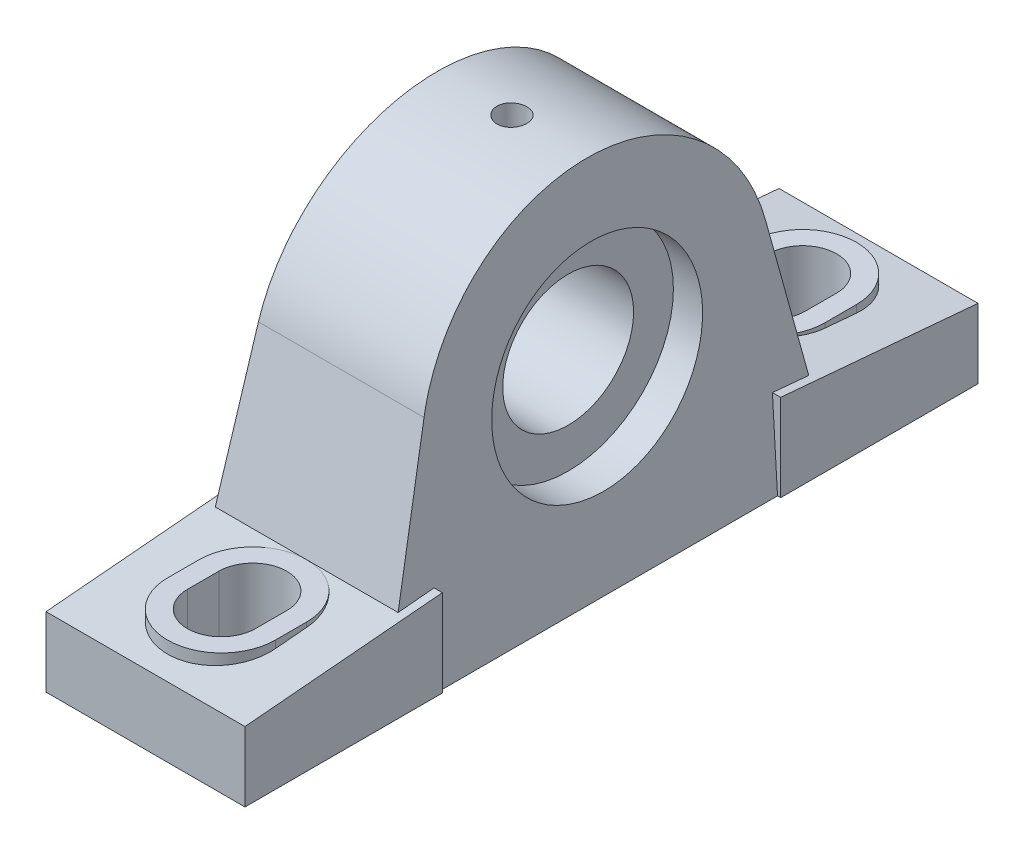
ISO-10303-21;
HEADER;
FILE_DESCRIPTION(('STEP AP214'),'2;1');
FILE_NAME('part.step','',(''),(''),'','','');
FILE_SCHEMA(('AUTOMOTIVE_DESIGN { 1 0 10303 214 1 1 1 1 }'));
ENDSEC;
DATA;
#1=APPLICATION_CONTEXT('core data for automotive mechanical design processes');
#2=APPLICATION_PROTOCOL_DEFINITION('international standard','automotive_design',2000,#1);
#3=PRODUCT_CONTEXT('',#1,'mechanical');
#4=PRODUCT('Part','Part','',(#3));
#5=PRODUCT_RELATED_PRODUCT_CATEGORY('part','',(#4));
#6=PRODUCT_DEFINITION_FORMATION('','',#4);
#7=PRODUCT_DEFINITION_CONTEXT('part definition',#1,'design');
#8=PRODUCT_DEFINITION('design','',#6,#7);
#9=PRODUCT_DEFINITION_SHAPE('','',#8);
#10=(LENGTH_UNIT() NAMED_UNIT(*) SI_UNIT(.MILLI.,.METRE.));
#11=(NAMED_UNIT(*) PLANE_ANGLE_UNIT() SI_UNIT($,.RADIAN.));
#12=(NAMED_UNIT(*) SI_UNIT($,.STERADIAN.) SOLID_ANGLE_UNIT());
#13=UNCERTAINTY_MEASURE_WITH_UNIT(LENGTH_MEASURE(1.E-05),#10,'distance_accuracy_value','');
#14=(GEOMETRIC_REPRESENTATION_CONTEXT(3) GLOBAL_UNCERTAINTY_ASSIGNED_CONTEXT((#13)) GLOBAL_UNIT_ASSIGNED_CONTEXT((#10,
#11,#12)) REPRESENTATION_CONTEXT('',''));
#15=CARTESIAN_POINT('',(0.,0.,0.));
#16=DIRECTION('',(0.,0.,1.));
#17=DIRECTION('',(1.,0.,0.));
#18=AXIS2_PLACEMENT_3D('',#15,#16,#17);
#19=CARTESIAN_POINT('',(-14.775,18.7504833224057,0.));
#20=DIRECTION('',(0.,-1.,0.));
#21=DIRECTION('',(0.,0.,-1.));
#22=AXIS2_PLACEMENT_3D('',#19,#20,#21);
#23=CYLINDRICAL_SURFACE('',#22,1.36);
#24=CARTESIAN_POINT('',(-16.135,12.5,0.));
#25=CARTESIAN_POINT('',(-16.1349967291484,12.4999990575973,0.0761506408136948));
#26=CARTESIAN_POINT('',(-16.1285826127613,12.4992967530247,0.152350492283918));
#27=CARTESIAN_POINT('',(-16.1030937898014,12.4965626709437,0.302634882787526));
#28=CARTESIAN_POINT('',(-16.0840054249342,12.4945294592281,0.376717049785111));
#29=CARTESIAN_POINT('',(-16.0337326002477,12.4893629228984,0.520568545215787));
#30=CARTESIAN_POINT('',(-16.0025556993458,12.4862302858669,0.590340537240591));
#31=CARTESIAN_POINT('',(-15.9290061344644,12.4792145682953,0.723646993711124));
#32=CARTESIAN_POINT('',(-15.8866355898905,12.4753316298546,0.787182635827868));
#33=CARTESIAN_POINT('',(-15.7917097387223,12.4672314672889,0.906495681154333));
#34=CARTESIAN_POINT('',(-15.7391167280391,12.4630130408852,0.962243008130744));
#35=CARTESIAN_POINT('',(-15.6253194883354,12.4547272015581,1.0641383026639));
#36=CARTESIAN_POINT('',(-15.5641148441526,12.4506597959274,1.11028580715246));
#37=CARTESIAN_POINT('',(-15.4346408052,12.4431244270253,1.19178002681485));
#38=CARTESIAN_POINT('',(-15.3663539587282,12.4396580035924,1.22709917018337));
#39=CARTESIAN_POINT('',(-15.2247746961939,12.4337323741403,1.28575799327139));
#40=CARTESIAN_POINT('',(-15.1514824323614,12.4312731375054,1.30909803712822));
#41=CARTESIAN_POINT('',(-15.002281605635,12.427651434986,1.34304620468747));
#42=CARTESIAN_POINT('',(-14.9263845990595,12.4264838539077,1.35370456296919));
#43=CARTESIAN_POINT('',(-14.7738706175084,12.4255618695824,1.36214215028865));
#44=CARTESIAN_POINT('',(-14.697253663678,12.4258074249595,1.35992175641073));
#45=CARTESIAN_POINT('',(-14.5458226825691,12.4276792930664,1.34270621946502));
#46=CARTESIAN_POINT('',(-14.4710023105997,12.4292996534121,1.32776614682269));
#47=CARTESIAN_POINT('',(-14.3249365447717,12.433729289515,1.28562088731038));
#48=CARTESIAN_POINT('',(-14.2536912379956,12.4365385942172,1.2584154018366));
#49=CARTESIAN_POINT('',(-14.1166233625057,12.4430365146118,1.19245023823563));
#50=CARTESIAN_POINT('',(-14.0508127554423,12.446727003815,1.15366589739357));
#51=CARTESIAN_POINT('',(-13.9266192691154,12.4545695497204,1.06566507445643));
#52=CARTESIAN_POINT('',(-13.8682360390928,12.4587215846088,1.0164490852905));
#53=CARTESIAN_POINT('',(-13.7602389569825,12.467045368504,0.908685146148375));
#54=CARTESIAN_POINT('',(-13.7106707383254,12.4712171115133,0.850091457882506));
#55=CARTESIAN_POINT('',(-13.6220433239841,12.4790926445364,0.72535865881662));
#56=CARTESIAN_POINT('',(-13.582988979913,12.4827962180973,0.659216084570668));
#57=CARTESIAN_POINT('',(-13.5165035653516,12.4893199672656,0.521213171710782));
#58=CARTESIAN_POINT('',(-13.4890846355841,12.4921392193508,0.449346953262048));
#59=CARTESIAN_POINT('',(-13.4467728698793,12.4965650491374,0.30209105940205));
#60=CARTESIAN_POINT('',(-13.4318534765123,12.4981741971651,0.226709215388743));
#61=CARTESIAN_POINT('',(-13.4205848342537,12.4993934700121,0.125683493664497));
#62=CARTESIAN_POINT('',(-13.4184920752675,12.4996204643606,0.100596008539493));
#63=CARTESIAN_POINT('',(-13.4156991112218,12.499923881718,0.0503426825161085));
#64=CARTESIAN_POINT('',(-13.4149989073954,12.5000003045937,0.0251768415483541));
#65=CARTESIAN_POINT('',(-13.4150033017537,12.499999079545,-0.0760821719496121));
#66=CARTESIAN_POINT('',(-13.4214108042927,12.4992974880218,-0.152264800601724));
#67=CARTESIAN_POINT('',(-13.4468867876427,12.4965647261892,-0.302567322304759));
#68=CARTESIAN_POINT('',(-13.4659817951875,12.4945307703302,-0.376682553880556));
#69=CARTESIAN_POINT('',(-13.5162708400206,12.4893625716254,-0.520576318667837));
#70=CARTESIAN_POINT('',(-13.5474528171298,12.4862294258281,-0.590359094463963));
#71=CARTESIAN_POINT('',(-13.6210055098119,12.4792135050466,-0.723664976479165));
#72=CARTESIAN_POINT('',(-13.663371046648,12.4753310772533,-0.787190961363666));
#73=CARTESIAN_POINT('',(-13.7582837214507,12.4672320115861,-0.906487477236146));
#74=CARTESIAN_POINT('',(-13.8108685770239,12.4630141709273,-0.962227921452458));
#75=CARTESIAN_POINT('',(-13.9246645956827,12.4547283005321,-1.06412597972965));
#76=CARTESIAN_POINT('',(-13.9858784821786,12.4506603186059,-1.11028055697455));
#77=CARTESIAN_POINT('',(-14.1153925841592,12.4431223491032,-1.19180209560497));
#78=CARTESIAN_POINT('',(-14.1837130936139,12.4396541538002,-1.22713696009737));
#79=CARTESIAN_POINT('',(-14.3253133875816,12.4337297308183,-1.28578447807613));
#80=CARTESIAN_POINT('',(-14.398587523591,12.4312723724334,-1.30911057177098));
#81=CARTESIAN_POINT('',(-14.5227181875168,12.4282576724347,-1.33736006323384));
#82=CARTESIAN_POINT('',(-14.5727858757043,12.427338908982,-1.34583820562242));
#83=CARTESIAN_POINT('',(-14.6735617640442,12.4261076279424,-1.35715924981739));
#84=CARTESIAN_POINT('',(-14.7242699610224,12.4257951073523,-1.36000217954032));
#85=CARTESIAN_POINT('',(-14.8511490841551,12.4257967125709,-1.35999672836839));
#86=CARTESIAN_POINT('',(-14.9273473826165,12.4265032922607,-1.35358286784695));
#87=CARTESIAN_POINT('',(-15.0776286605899,12.42925264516,-1.32809511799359));
#88=CARTESIAN_POINT('',(-15.1517092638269,12.4312968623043,-1.30900754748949));
#89=CARTESIAN_POINT('',(-15.295558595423,12.436487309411,-1.25873667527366));
#90=CARTESIAN_POINT('',(-15.3653299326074,12.4396328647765,-1.22756077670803));
#91=CARTESIAN_POINT('',(-15.4986331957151,12.4466705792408,-1.15401452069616));
#92=CARTESIAN_POINT('',(-15.5621665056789,12.4505625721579,-1.11164665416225));
#93=CARTESIAN_POINT('',(-15.6814733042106,12.4586729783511,-1.01672931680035));
#94=CARTESIAN_POINT('',(-15.737217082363,12.4628925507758,-0.964142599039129));
#95=CARTESIAN_POINT('',(-15.8391188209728,12.4711732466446,-0.850344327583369));
#96=CARTESIAN_POINT('',(-15.8852742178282,12.4752343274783,-0.789130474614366));
#97=CARTESIAN_POINT('',(-15.966796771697,12.4827529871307,-0.659616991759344));
#98=CARTESIAN_POINT('',(-16.0021319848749,12.4862087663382,-0.591297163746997));
#99=CARTESIAN_POINT('',(-16.0607805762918,12.4921084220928,-0.449697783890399));
#100=CARTESIAN_POINT('',(-16.0841072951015,12.4945534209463,-0.37642383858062));
#101=CARTESIAN_POINT('',(-16.112358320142,12.4975521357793,-0.252291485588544));
#102=CARTESIAN_POINT('',(-16.1208371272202,12.4984657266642,-0.202221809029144));
#103=CARTESIAN_POINT('',(-16.1321590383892,12.4996899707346,-0.101442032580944));
#104=CARTESIAN_POINT('',(-16.1350021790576,12.5000006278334,-0.0507319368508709));
#105=CARTESIAN_POINT('',(-16.135,12.5,0.));
#106=B_SPLINE_CURVE_WITH_KNOTS('',3,(#24,#25,#26,#27,#28,#29,#30,#31,#32,#33,#34,#35,#36,#37,
#38,#39,#40,#41,#42,#43,#44,#45,#46,#47,#48,#49,#50,#51,#52,#53,#54,#55,#56,#57,#58,#59,#60,#61,
#62,#63,#64,#65,#66,#67,#68,#69,#70,#71,#72,#73,#74,#75,#76,#77,#78,#79,#80,#81,#82,#83,#84,#85,
#86,#87,#88,#89,#90,#91,#92,#93,#94,#95,#96,#97,#98,#99,#100,#101,#102,#103,#104,#105),
.UNSPECIFIED.,.T.,.F.,(4,2,2,2,2,2,2,2,2,2,2,2,2,2,2,2,2,2,2,2,2,2,2,2,2,2,2,2,2,2,2,2,2,2,2,2,
2,2,2,2,4),(0.,0.228266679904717,0.456779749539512,0.685150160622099,0.913477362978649,
1.14266327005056,1.37186022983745,1.60163602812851,1.8314048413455,2.06026043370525,
2.28910932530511,2.516972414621,2.74484105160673,2.97319854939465,3.2015452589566,
3.43104168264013,3.66064382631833,3.89048495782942,4.11983650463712,4.19533522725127,
4.27083401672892,4.49898463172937,4.72761376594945,4.9560153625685,5.18431137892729,
5.41346656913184,5.64269424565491,5.87259548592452,6.10223885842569,6.2543063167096,
6.40637302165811,6.63463502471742,6.86314383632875,7.09151292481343,7.31983122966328,
7.54899789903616,7.77822576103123,8.00812397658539,8.23776623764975,8.38983962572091,
8.54191202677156),.UNSPECIFIED.);
#107=CARTESIAN_POINT('',(-16.135,12.5,0.));
#108=VERTEX_POINT('',#107);
#109=EDGE_CURVE('E251',#108,#108,#106,.T.);
#110=ORIENTED_EDGE('',*,*,#109,.F.);
#111=EDGE_LOOP('',(#110));
#112=FACE_BOUND('',#111,.T.);
#113=CARTESIAN_POINT('',(-13.415,18.75,0.));
#114=CARTESIAN_POINT('',(-13.41500322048,18.7499993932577,0.0762185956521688));
#115=CARTESIAN_POINT('',(-13.4214335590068,18.749529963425,0.152539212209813));
#116=CARTESIAN_POINT('',(-13.4470045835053,18.7477015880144,0.303120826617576));
#117=CARTESIAN_POINT('',(-13.4661722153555,18.7463407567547,0.377377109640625));
#118=CARTESIAN_POINT('',(-13.5166652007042,18.7428833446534,0.521553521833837));
#119=CARTESIAN_POINT('',(-13.5479794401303,18.7407874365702,0.591477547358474));
#120=CARTESIAN_POINT('',(-13.6218570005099,18.736095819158,0.725041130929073));
#121=CARTESIAN_POINT('',(-13.6644152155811,18.7335003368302,0.788683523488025));
#122=CARTESIAN_POINT('',(-13.7596716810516,18.7280947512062,0.908046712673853));
#123=CARTESIAN_POINT('',(-13.8123883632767,18.7252842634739,0.963752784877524));
#124=CARTESIAN_POINT('',(-13.9264289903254,18.7197685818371,1.06553709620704));
#125=CARTESIAN_POINT('',(-13.9877537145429,18.7170633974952,1.11161446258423));
#126=CARTESIAN_POINT('',(-14.1173486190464,18.7120606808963,1.19287479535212));
#127=CARTESIAN_POINT('',(-14.1856262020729,18.709763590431,1.22804598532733));
#128=CARTESIAN_POINT('',(-14.3271363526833,18.7058409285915,1.28641985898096));
#129=CARTESIAN_POINT('',(-14.4003688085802,18.704215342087,1.30962281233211));
#130=CARTESIAN_POINT('',(-14.5495728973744,18.7018225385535,1.34336231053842));
#131=CARTESIAN_POINT('',(-14.6255394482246,18.7010538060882,1.35392122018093));
#132=CARTESIAN_POINT('',(-14.7781703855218,18.7004568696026,1.36214195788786));
#133=CARTESIAN_POINT('',(-14.8548347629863,18.7006286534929,1.3598039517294));
#134=CARTESIAN_POINT('',(-15.0065314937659,18.7018919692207,1.34231578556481));
#135=CARTESIAN_POINT('',(-15.0815666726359,18.7029817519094,1.32718999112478));
#136=CARTESIAN_POINT('',(-15.2280309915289,18.7059555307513,1.28459319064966));
#137=CARTESIAN_POINT('',(-15.2994600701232,18.7078395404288,1.25712197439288));
#138=CARTESIAN_POINT('',(-15.4367641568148,18.7121915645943,1.19058554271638));
#139=CARTESIAN_POINT('',(-15.5026336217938,18.7146601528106,1.15150892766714));
#140=CARTESIAN_POINT('',(-15.6268820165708,18.7199023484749,1.06288271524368));
#141=CARTESIAN_POINT('',(-15.6852614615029,18.722675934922,1.01333383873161));
#142=CARTESIAN_POINT('',(-15.7930101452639,18.7282230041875,0.90504272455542));
#143=CARTESIAN_POINT('',(-15.8423600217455,18.7309964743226,0.846281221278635));
#144=CARTESIAN_POINT('',(-15.9305210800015,18.7362265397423,0.721264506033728));
#145=CARTESIAN_POINT('',(-15.9693273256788,18.7386829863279,0.655005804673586));
#146=CARTESIAN_POINT('',(-16.0352932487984,18.7430027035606,0.516846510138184));
#147=CARTESIAN_POINT('',(-16.0624424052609,18.7448654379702,0.444940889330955));
#148=CARTESIAN_POINT('',(-16.1042200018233,18.7477808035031,0.297674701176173));
#149=CARTESIAN_POINT('',(-16.1188750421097,18.7488351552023,0.222321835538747));
#150=CARTESIAN_POINT('',(-16.129732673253,18.7496186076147,0.122065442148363));
#151=CARTESIAN_POINT('',(-16.1317065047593,18.7497613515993,0.0976972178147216));
#152=CARTESIAN_POINT('',(-16.1343406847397,18.7499521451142,0.0488894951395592));
#153=CARTESIAN_POINT('',(-16.1350010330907,18.7500001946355,0.0244499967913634));
#154=CARTESIAN_POINT('',(-16.13499677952,18.7499993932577,-0.076218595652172));
#155=CARTESIAN_POINT('',(-16.1285664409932,18.749529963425,-0.152539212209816));
#156=CARTESIAN_POINT('',(-16.1029954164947,18.7477015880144,-0.303120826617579));
#157=CARTESIAN_POINT('',(-16.0838277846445,18.7463407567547,-0.377377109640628));
#158=CARTESIAN_POINT('',(-16.0333347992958,18.7428833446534,-0.52155352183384));
#159=CARTESIAN_POINT('',(-16.0020205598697,18.7407874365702,-0.591477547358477));
#160=CARTESIAN_POINT('',(-15.9281429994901,18.736095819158,-0.725041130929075));
#161=CARTESIAN_POINT('',(-15.8855847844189,18.7335003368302,-0.788683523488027));
#162=CARTESIAN_POINT('',(-15.7903283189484,18.7280947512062,-0.908046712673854));
#163=CARTESIAN_POINT('',(-15.7376116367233,18.7252842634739,-0.963752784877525));
#164=CARTESIAN_POINT('',(-15.6235710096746,18.7197685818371,-1.06553709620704));
#165=CARTESIAN_POINT('',(-15.5622462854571,18.7170633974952,-1.11161446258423));
#166=CARTESIAN_POINT('',(-15.4326513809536,18.7120606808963,-1.19287479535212));
#167=CARTESIAN_POINT('',(-15.3643737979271,18.709763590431,-1.22804598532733));
#168=CARTESIAN_POINT('',(-15.2228636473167,18.7058409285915,-1.28641985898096));
#169=CARTESIAN_POINT('',(-15.1496311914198,18.704215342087,-1.30962281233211));
#170=CARTESIAN_POINT('',(-15.0004271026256,18.7018225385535,-1.34336231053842));
#171=CARTESIAN_POINT('',(-14.9244605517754,18.7010538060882,-1.35392122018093));
#172=CARTESIAN_POINT('',(-14.7718296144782,18.7004568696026,-1.36214195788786));
#173=CARTESIAN_POINT('',(-14.6951652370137,18.7006286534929,-1.3598039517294));
#174=CARTESIAN_POINT('',(-14.5434685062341,18.7018919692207,-1.34231578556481));
#175=CARTESIAN_POINT('',(-14.4684333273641,18.7029817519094,-1.32718999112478));
#176=CARTESIAN_POINT('',(-14.3219690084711,18.7059555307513,-1.28459319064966));
#177=CARTESIAN_POINT('',(-14.2505399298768,18.7078395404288,-1.25712197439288));
#178=CARTESIAN_POINT('',(-14.1132358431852,18.7121915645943,-1.19058554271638));
#179=CARTESIAN_POINT('',(-14.0473663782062,18.7146601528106,-1.15150892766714));
#180=CARTESIAN_POINT('',(-13.9231179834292,18.7199023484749,-1.06288271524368));
#181=CARTESIAN_POINT('',(-13.8647385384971,18.722675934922,-1.01333383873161));
#182=CARTESIAN_POINT('',(-13.7569898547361,18.7282230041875,-0.905042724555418));
#183=CARTESIAN_POINT('',(-13.7076399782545,18.7309964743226,-0.846281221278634));
#184=CARTESIAN_POINT('',(-13.6194789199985,18.7362265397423,-0.721264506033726));
#185=CARTESIAN_POINT('',(-13.5806726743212,18.7386829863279,-0.655005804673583));
#186=CARTESIAN_POINT('',(-13.5147067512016,18.7430027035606,-0.516846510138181));
#187=CARTESIAN_POINT('',(-13.4875575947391,18.7448654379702,-0.444940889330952));
#188=CARTESIAN_POINT('',(-13.4457799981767,18.7477808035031,-0.29767470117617));
#189=CARTESIAN_POINT('',(-13.4311249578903,18.7488351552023,-0.222321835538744));
#190=CARTESIAN_POINT('',(-13.420267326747,18.7496186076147,-0.12206544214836));
#191=CARTESIAN_POINT('',(-13.4182934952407,18.7497613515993,-0.0976972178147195));
#192=CARTESIAN_POINT('',(-13.4156593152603,18.7499521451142,-0.0488894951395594));
#193=CARTESIAN_POINT('',(-13.4149989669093,18.7500001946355,-0.0244499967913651));
#194=CARTESIAN_POINT('',(-13.415,18.75,0.));
#195=B_SPLINE_CURVE_WITH_KNOTS('',3,(#113,#114,#115,#116,#117,#118,#119,#120,#121,#122,#123,
#124,#125,#126,#127,#128,#129,#130,#131,#132,#133,#134,#135,#136,#137,#138,#139,#140,#141,#142,
#143,#144,#145,#146,#147,#148,#149,#150,#151,#152,#153,#154,#155,#156,#157,#158,#159,#160,#161,
#162,#163,#164,#165,#166,#167,#168,#169,#170,#171,#172,#173,#174,#175,#176,#177,#178,#179,#180,
#181,#182,#183,#184,#185,#186,#187,#188,#189,#190,#191,#192,#193,#194),.UNSPECIFIED.,.T.,.F.,(4,
2,2,2,2,2,2,2,2,2,2,2,2,2,2,2,2,2,2,2,2,2,2,2,2,2,2,2,2,2,2,2,2,2,2,2,2,2,2,2,4),(0.,
0.22856273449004,0.457610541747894,0.686449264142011,0.915184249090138,1.14433823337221,
1.37351297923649,1.60293433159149,1.83235051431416,2.06136030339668,2.29036714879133,
2.51893863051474,2.74751400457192,2.9763146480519,3.20509954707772,3.43436942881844,
3.66374646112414,3.8933300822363,4.12242368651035,4.19574381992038,4.26906396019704,
4.49762669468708,4.72667450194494,4.95551322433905,5.18424820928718,5.41340219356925,
5.64257693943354,5.87199829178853,6.1014144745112,6.33042426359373,6.55943110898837,
6.78800259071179,7.01657796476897,7.24537860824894,7.47416350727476,7.70343338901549,
7.93281042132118,8.16239404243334,8.39148764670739,8.46480778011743,8.53812792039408),.UNSPECIFIED.);
#196=CARTESIAN_POINT('',(-13.415,18.75,0.));
#197=VERTEX_POINT('',#196);
#198=EDGE_CURVE('E224',#197,#197,#195,.T.);
#199=ORIENTED_EDGE('',*,*,#198,.F.);
#200=EDGE_LOOP('',(#199));
#201=FACE_BOUND('',#200,.T.);
#202=ADVANCED_FACE('F16',(#112,#201),#23,.F.);
#203=CARTESIAN_POINT('',(-19.7,-18.75,18.9750021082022));
#204=DIRECTION('',(-1.,0.,0.));
#205=DIRECTION('',(0.,1.,0.));
#206=AXIS2_PLACEMENT_3D('',#203,#204,#205);
#207=PLANE('',#206);
#208=CARTESIAN_POINT('',(-19.7,0.,0.));
#209=DIRECTION('',(1.,0.,0.));
#210=DIRECTION('',(0.,0.,-1.));
#211=AXIS2_PLACEMENT_3D('',#208,#209,#210);
#212=CIRCLE('',#211,12.5);
#213=CARTESIAN_POINT('',(-19.7,0.,-12.5));
#214=VERTEX_POINT('',#213);
#215=EDGE_CURVE('E20',#214,#214,#212,.F.);
#216=ORIENTED_EDGE('',*,*,#215,.F.);
#217=EDGE_LOOP('',(#216));
#218=FACE_BOUND('',#217,.T.);
#219=CARTESIAN_POINT('',(-19.7,0.,0.));
#220=DIRECTION('',(1.,0.,0.));
#221=DIRECTION('',(0.,0.,-1.));
#222=AXIS2_PLACEMENT_3D('',#219,#220,#221);
#223=CIRCLE('',#222,18.75);
#224=CARTESIAN_POINT('',(-19.7,0.,-18.75));
#225=VERTEX_POINT('',#224);
#226=EDGE_CURVE('E237',#225,#225,#223,.T.);
#227=ORIENTED_EDGE('',*,*,#226,.F.);
#228=EDGE_LOOP('',(#227));
#229=FACE_BOUND('',#228,.T.);
#230=ADVANCED_FACE('F243',(#218,#229),#207,.T.);
#231=CARTESIAN_POINT('',(-13.79,0.,18.7504833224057));
#232=DIRECTION('',(0.,0.,-1.));
#233=DIRECTION('',(-1.,0.,0.));
#234=AXIS2_PLACEMENT_3D('',#231,#232,#233);
#235=CYLINDRICAL_SURFACE('',#234,1.36);
#236=CARTESIAN_POINT('',(-15.15,0.,18.75));
#237=CARTESIAN_POINT('',(-15.14999677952,0.0762185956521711,18.7499993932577));
#238=CARTESIAN_POINT('',(-15.1435664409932,0.152539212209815,18.749529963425));
#239=CARTESIAN_POINT('',(-15.1179954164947,0.303120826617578,18.7477015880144));
#240=CARTESIAN_POINT('',(-15.0988277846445,0.377377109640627,18.7463407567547));
#241=CARTESIAN_POINT('',(-15.0483347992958,0.52155352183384,18.7428833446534));
#242=CARTESIAN_POINT('',(-15.0170205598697,0.591477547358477,18.7407874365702));
#243=CARTESIAN_POINT('',(-14.9431429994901,0.725041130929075,18.736095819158));
#244=CARTESIAN_POINT('',(-14.9005847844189,0.788683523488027,18.7335003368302));
#245=CARTESIAN_POINT('',(-14.8053283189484,0.908046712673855,18.7280947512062));
#246=CARTESIAN_POINT('',(-14.7526116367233,0.963752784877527,18.7252842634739));
#247=CARTESIAN_POINT('',(-14.6385710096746,1.06553709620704,18.7197685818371));
#248=CARTESIAN_POINT('',(-14.5772462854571,1.11161446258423,18.7170633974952));
#249=CARTESIAN_POINT('',(-14.4476513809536,1.19287479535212,18.7120606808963));
#250=CARTESIAN_POINT('',(-14.3793737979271,1.22804598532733,18.709763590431));
#251=CARTESIAN_POINT('',(-14.2378636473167,1.28641985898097,18.7058409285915));
#252=CARTESIAN_POINT('',(-14.1646311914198,1.30962281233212,18.704215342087));
#253=CARTESIAN_POINT('',(-14.0154271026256,1.34336231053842,18.7018225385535));
#254=CARTESIAN_POINT('',(-13.9394605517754,1.35392122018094,18.7010538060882));
#255=CARTESIAN_POINT('',(-13.7868296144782,1.36214195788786,18.7004568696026));
#256=CARTESIAN_POINT('',(-13.7101652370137,1.3598039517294,18.7006286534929));
#257=CARTESIAN_POINT('',(-13.5584685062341,1.34231578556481,18.7018919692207));
#258=CARTESIAN_POINT('',(-13.4834333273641,1.32718999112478,18.7029817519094));
#259=CARTESIAN_POINT('',(-13.3369690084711,1.28459319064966,18.7059555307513));
#260=CARTESIAN_POINT('',(-13.2655399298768,1.25712197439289,18.7078395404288));
#261=CARTESIAN_POINT('',(-13.1282358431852,1.19058554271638,18.7121915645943));
#262=CARTESIAN_POINT('',(-13.0623663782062,1.15150892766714,18.7146601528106));
#263=CARTESIAN_POINT('',(-12.9381179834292,1.06288271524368,18.7199023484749));
#264=CARTESIAN_POINT('',(-12.8797385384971,1.01333383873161,18.722675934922));
#265=CARTESIAN_POINT('',(-12.7719898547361,0.905042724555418,18.7282230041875));
#266=CARTESIAN_POINT('',(-12.7226399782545,0.846281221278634,18.7309964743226));
#267=CARTESIAN_POINT('',(-12.6344789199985,0.721264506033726,18.7362265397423));
#268=CARTESIAN_POINT('',(-12.5956726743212,0.655005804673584,18.7386829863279));
#269=CARTESIAN_POINT('',(-12.5297067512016,0.516846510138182,18.7430027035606));
#270=CARTESIAN_POINT('',(-12.5025575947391,0.444940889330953,18.7448654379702));
#271=CARTESIAN_POINT('',(-12.4607799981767,0.29767470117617,18.7477808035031));
#272=CARTESIAN_POINT('',(-12.4461249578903,0.222321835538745,18.7488351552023));
#273=CARTESIAN_POINT('',(-12.435267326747,0.122065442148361,18.7496186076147));
#274=CARTESIAN_POINT('',(-12.4332934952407,0.0976972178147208,18.7497613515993));
#275=CARTESIAN_POINT('',(-12.4306593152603,0.0488894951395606,18.7499521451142));
#276=CARTESIAN_POINT('',(-12.4299989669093,0.024449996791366,18.7500001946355));
#277=CARTESIAN_POINT('',(-12.43000322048,-0.0762185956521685,18.7499993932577));
#278=CARTESIAN_POINT('',(-12.4364335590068,-0.152539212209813,18.749529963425));
#279=CARTESIAN_POINT('',(-12.4620045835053,-0.303120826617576,18.7477015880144));
#280=CARTESIAN_POINT('',(-12.4811722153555,-0.377377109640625,18.7463407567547));
#281=CARTESIAN_POINT('',(-12.5316652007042,-0.521553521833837,18.7428833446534));
#282=CARTESIAN_POINT('',(-12.5629794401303,-0.591477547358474,18.7407874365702));
#283=CARTESIAN_POINT('',(-12.6368570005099,-0.725041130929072,18.736095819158));
#284=CARTESIAN_POINT('',(-12.6794152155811,-0.788683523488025,18.7335003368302));
#285=CARTESIAN_POINT('',(-12.7746716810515,-0.908046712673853,18.7280947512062));
#286=CARTESIAN_POINT('',(-12.8273883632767,-0.963752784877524,18.7252842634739));
#287=CARTESIAN_POINT('',(-12.9414289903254,-1.06553709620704,18.7197685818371));
#288=CARTESIAN_POINT('',(-13.0027537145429,-1.11161446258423,18.7170633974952));
#289=CARTESIAN_POINT('',(-13.1323486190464,-1.19287479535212,18.7120606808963));
#290=CARTESIAN_POINT('',(-13.2006262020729,-1.22804598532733,18.709763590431));
#291=CARTESIAN_POINT('',(-13.3421363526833,-1.28641985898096,18.7058409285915));
#292=CARTESIAN_POINT('',(-13.4153688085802,-1.30962281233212,18.704215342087));
#293=CARTESIAN_POINT('',(-13.5645728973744,-1.34336231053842,18.7018225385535));
#294=CARTESIAN_POINT('',(-13.6405394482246,-1.35392122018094,18.7010538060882));
#295=CARTESIAN_POINT('',(-13.7931703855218,-1.36214195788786,18.7004568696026));
#296=CARTESIAN_POINT('',(-13.8698347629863,-1.3598039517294,18.7006286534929));
#297=CARTESIAN_POINT('',(-14.0215314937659,-1.34231578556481,18.7018919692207));
#298=CARTESIAN_POINT('',(-14.0965666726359,-1.32718999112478,18.7029817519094));
#299=CARTESIAN_POINT('',(-14.2430309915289,-1.28459319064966,18.7059555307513));
#300=CARTESIAN_POINT('',(-14.3144600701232,-1.25712197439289,18.7078395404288));
#301=CARTESIAN_POINT('',(-14.4517641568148,-1.19058554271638,18.7121915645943));
#302=CARTESIAN_POINT('',(-14.5176336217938,-1.15150892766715,18.7146601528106));
#303=CARTESIAN_POINT('',(-14.6418820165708,-1.06288271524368,18.7199023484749));
#304=CARTESIAN_POINT('',(-14.7002614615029,-1.01333383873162,18.722675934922));
#305=CARTESIAN_POINT('',(-14.8080101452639,-0.905042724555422,18.7282230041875));
#306=CARTESIAN_POINT('',(-14.8573600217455,-0.846281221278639,18.7309964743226));
#307=CARTESIAN_POINT('',(-14.9455210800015,-0.721264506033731,18.7362265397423));
#308=CARTESIAN_POINT('',(-14.9843273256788,-0.655005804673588,18.7386829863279));
#309=CARTESIAN_POINT('',(-15.0502932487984,-0.516846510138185,18.7430027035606));
#310=CARTESIAN_POINT('',(-15.0774424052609,-0.444940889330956,18.7448654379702));
#311=CARTESIAN_POINT('',(-15.1192200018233,-0.297674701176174,18.7477808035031));
#312=CARTESIAN_POINT('',(-15.1338750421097,-0.222321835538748,18.7488351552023));
#313=CARTESIAN_POINT('',(-15.144732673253,-0.122065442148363,18.7496186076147));
#314=CARTESIAN_POINT('',(-15.1467065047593,-0.0976972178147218,18.7497613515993));
#315=CARTESIAN_POINT('',(-15.1493406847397,-0.0488894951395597,18.7499521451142));
#316=CARTESIAN_POINT('',(-15.1500010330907,-0.0244499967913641,18.7500001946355));
#317=CARTESIAN_POINT('',(-15.15,0.,18.75));
#318=B_SPLINE_CURVE_WITH_KNOTS('',3,(#236,#237,#238,#239,#240,#241,#242,#243,#244,#245,#246,
#247,#248,#249,#250,#251,#252,#253,#254,#255,#256,#257,#258,#259,#260,#261,#262,#263,#264,#265,
#266,#267,#268,#269,#270,#271,#272,#273,#274,#275,#276,#277,#278,#279,#280,#281,#282,#283,#284,
#285,#286,#287,#288,#289,#290,#291,#292,#293,#294,#295,#296,#297,#298,#299,#300,#301,#302,#303,
#304,#305,#306,#307,#308,#309,#310,#311,#312,#313,#314,#315,#316,#317),.UNSPECIFIED.,.T.,.F.,(4,
2,2,2,2,2,2,2,2,2,2,2,2,2,2,2,2,2,2,2,2,2,2,2,2,2,2,2,2,2,2,2,2,2,2,2,2,2,2,2,4),(0.,
0.22856273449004,0.457610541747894,0.686449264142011,0.915184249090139,1.14433823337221,
1.37351297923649,1.60293433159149,1.83235051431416,2.06136030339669,2.29036714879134,
2.51893863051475,2.74751400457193,2.9763146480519,3.20509954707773,3.43436942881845,
3.66374646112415,3.89333008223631,4.12242368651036,4.19574381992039,4.26906396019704,
4.49762669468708,4.72667450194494,4.95551322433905,5.18424820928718,5.41340219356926,
5.64257693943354,5.87199829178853,6.1014144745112,6.33042426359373,6.55943110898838,
6.78800259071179,7.01657796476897,7.24537860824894,7.47416350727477,7.70343338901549,
7.93281042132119,8.16239404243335,8.3914876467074,8.46480778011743,8.53812792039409),.UNSPECIFIED.);
#319=CARTESIAN_POINT('',(-15.15,0.,18.75));
#320=VERTEX_POINT('',#319);
#321=EDGE_CURVE('E230',#320,#320,#318,.T.);
#322=ORIENTED_EDGE('',*,*,#321,.F.);
#323=EDGE_LOOP('',(#322));
#324=FACE_BOUND('',#323,.T.);
#325=CARTESIAN_POINT('',(-15.15,0.,12.5));
#326=CARTESIAN_POINT('',(-15.1499967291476,-0.0761506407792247,12.4999990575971));
#327=CARTESIAN_POINT('',(-15.1435826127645,-0.152350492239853,12.499296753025));
#328=CARTESIAN_POINT('',(-15.1180937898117,-0.302634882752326,12.4965626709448));
#329=CARTESIAN_POINT('',(-15.0990054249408,-0.376717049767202,12.4945294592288));
#330=CARTESIAN_POINT('',(-15.0487326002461,-0.520568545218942,12.4893629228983));
#331=CARTESIAN_POINT('',(-15.0175556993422,-0.590340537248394,12.4862302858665));
#332=CARTESIAN_POINT('',(-14.9440061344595,-0.723646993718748,12.4792145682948));
#333=CARTESIAN_POINT('',(-14.9016355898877,-0.787182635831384,12.4753316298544));
#334=CARTESIAN_POINT('',(-14.8067097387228,-0.906495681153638,12.4672314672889));
#335=CARTESIAN_POINT('',(-14.7541167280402,-0.962243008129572,12.4630130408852));
#336=CARTESIAN_POINT('',(-14.6403194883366,-1.06413830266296,12.4547272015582));
#337=CARTESIAN_POINT('',(-14.5791148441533,-1.11028580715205,12.4506597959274));
#338=CARTESIAN_POINT('',(-14.4496408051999,-1.19178002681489,12.4431244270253));
#339=CARTESIAN_POINT('',(-14.3813539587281,-1.22709917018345,12.4396580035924));
#340=CARTESIAN_POINT('',(-14.2397746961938,-1.28575799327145,12.4337323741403));
#341=CARTESIAN_POINT('',(-14.1664824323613,-1.30909803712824,12.4312731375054));
#342=CARTESIAN_POINT('',(-14.0172816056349,-1.34304620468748,12.427651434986));
#343=CARTESIAN_POINT('',(-13.9413845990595,-1.3537045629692,12.4264838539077));
#344=CARTESIAN_POINT('',(-13.7888706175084,-1.36214215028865,12.4255618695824));
#345=CARTESIAN_POINT('',(-13.712253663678,-1.35992175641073,12.4258074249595));
#346=CARTESIAN_POINT('',(-13.5608226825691,-1.34270621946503,12.4276792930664));
#347=CARTESIAN_POINT('',(-13.4860023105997,-1.3277661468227,12.4292996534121));
#348=CARTESIAN_POINT('',(-13.3399365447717,-1.28562088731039,12.433729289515));
#349=CARTESIAN_POINT('',(-13.2686912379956,-1.25841540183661,12.4365385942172));
#350=CARTESIAN_POINT('',(-13.1316233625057,-1.19245023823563,12.4430365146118));
#351=CARTESIAN_POINT('',(-13.0658127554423,-1.15366589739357,12.446727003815));
#352=CARTESIAN_POINT('',(-12.9416192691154,-1.06566507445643,12.4545695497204));
#353=CARTESIAN_POINT('',(-12.8832360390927,-1.01644908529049,12.4587215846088));
#354=CARTESIAN_POINT('',(-12.7752389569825,-0.908685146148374,12.467045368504));
#355=CARTESIAN_POINT('',(-12.7256707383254,-0.850091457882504,12.4712171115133));
#356=CARTESIAN_POINT('',(-12.6370433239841,-0.725358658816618,12.4790926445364));
#357=CARTESIAN_POINT('',(-12.597988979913,-0.659216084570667,12.4827962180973));
#358=CARTESIAN_POINT('',(-12.5315035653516,-0.521213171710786,12.4893199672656));
#359=CARTESIAN_POINT('',(-12.5040846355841,-0.449346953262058,12.4921392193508));
#360=CARTESIAN_POINT('',(-12.4617728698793,-0.30209105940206,12.4965650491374));
#361=CARTESIAN_POINT('',(-12.4468534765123,-0.226709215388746,12.4981741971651));
#362=CARTESIAN_POINT('',(-12.4355848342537,-0.125683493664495,12.4993934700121));
#363=CARTESIAN_POINT('',(-12.4334920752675,-0.100596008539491,12.4996204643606));
#364=CARTESIAN_POINT('',(-12.4306991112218,-0.0503426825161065,12.499923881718));
#365=CARTESIAN_POINT('',(-12.4299989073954,-0.0251768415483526,12.5000003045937));
#366=CARTESIAN_POINT('',(-12.4300033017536,0.076082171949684,12.499999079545));
#367=CARTESIAN_POINT('',(-12.4364108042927,0.152264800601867,12.4992974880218));
#368=CARTESIAN_POINT('',(-12.4618867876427,0.302567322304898,12.4965647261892));
#369=CARTESIAN_POINT('',(-12.4809817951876,0.376682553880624,12.4945307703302));
#370=CARTESIAN_POINT('',(-12.5312708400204,0.520576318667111,12.4893625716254));
#371=CARTESIAN_POINT('',(-12.5624528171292,0.590359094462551,12.4862294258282));
#372=CARTESIAN_POINT('',(-12.636005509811,0.723664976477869,12.4792135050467));
#373=CARTESIAN_POINT('',(-12.6783710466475,0.787190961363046,12.4753310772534));
#374=CARTESIAN_POINT('',(-12.7732837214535,0.906487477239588,12.4672320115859));
#375=CARTESIAN_POINT('',(-12.8258685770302,0.962227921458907,12.4630141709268));
#376=CARTESIAN_POINT('',(-12.9396645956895,1.06412597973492,12.4547283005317));
#377=CARTESIAN_POINT('',(-13.0008784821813,1.11028055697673,12.4506603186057));
#378=CARTESIAN_POINT('',(-13.1303925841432,1.19180209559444,12.4431223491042));
#379=CARTESIAN_POINT('',(-13.1987130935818,1.22713696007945,12.439654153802));
#380=CARTESIAN_POINT('',(-13.3403133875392,1.2857844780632,12.4337297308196));
#381=CARTESIAN_POINT('',(-13.4135875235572,1.30911057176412,12.431272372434));
#382=CARTESIAN_POINT('',(-13.5377181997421,1.3373600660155,12.4282576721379));
#383=CARTESIAN_POINT('',(-13.58778590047,1.34583820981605,12.4273389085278));
#384=CARTESIAN_POINT('',(-13.6885618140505,1.35715925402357,12.4261076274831));
#385=CARTESIAN_POINT('',(-13.7392700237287,1.36000218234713,12.4257951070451));
#386=CARTESIAN_POINT('',(-13.8661491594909,1.35999672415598,12.4257967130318));
#387=CARTESIAN_POINT('',(-13.9423474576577,1.35358285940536,12.4265032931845));
#388=CARTESIAN_POINT('',(-14.0926287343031,1.32809510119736,12.4292526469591));
#389=CARTESIAN_POINT('',(-14.1667093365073,1.30900752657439,12.4312968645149));
#390=CARTESIAN_POINT('',(-14.3105586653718,1.25873664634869,12.4364873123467));
#391=CARTESIAN_POINT('',(-14.380330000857,1.22756074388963,12.4396328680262));
#392=CARTESIAN_POINT('',(-14.5136332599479,1.15401448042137,12.4466705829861));
#393=CARTESIAN_POINT('',(-14.5771665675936,1.11164661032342,12.4505625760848));
#394=CARTESIAN_POINT('',(-14.6964733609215,1.0167292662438,12.4586729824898));
#395=CARTESIAN_POINT('',(-14.7522171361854,0.964142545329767,12.462892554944));
#396=CARTESIAN_POINT('',(-14.8541188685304,0.850344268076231,12.4711732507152));
#397=CARTESIAN_POINT('',(-14.9002742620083,0.789130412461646,12.4752343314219));
#398=CARTESIAN_POINT('',(-14.9817968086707,0.659616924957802,12.4827529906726));
#399=CARTESIAN_POINT('',(-15.0171320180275,0.591297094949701,12.4862087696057));
#400=CARTESIAN_POINT('',(-15.0757806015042,0.449697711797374,12.4921084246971));
#401=CARTESIAN_POINT('',(-15.0991073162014,0.376423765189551,12.4945534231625));
#402=CARTESIAN_POINT('',(-15.1273583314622,0.252291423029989,12.4975521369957));
#403=CARTESIAN_POINT('',(-15.1358371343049,0.202221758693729,12.4984657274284));
#404=CARTESIAN_POINT('',(-15.1471590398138,0.101442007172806,12.4996899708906));
#405=CARTESIAN_POINT('',(-15.1500021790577,0.0507319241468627,12.5000006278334));
#406=CARTESIAN_POINT('',(-15.15,0.,12.5));
#407=B_SPLINE_CURVE_WITH_KNOTS('',3,(#325,#326,#327,#328,#329,#330,#331,#332,#333,#334,#335,
#336,#337,#338,#339,#340,#341,#342,#343,#344,#345,#346,#347,#348,#349,#350,#351,#352,#353,#354,
#355,#356,#357,#358,#359,#360,#361,#362,#363,#364,#365,#366,#367,#368,#369,#370,#371,#372,#373,
#374,#375,#376,#377,#378,#379,#380,#381,#382,#383,#384,#385,#386,#387,#388,#389,#390,#391,#392,
#393,#394,#395,#396,#397,#398,#399,#400,#401,#402,#403,#404,#405,#406),.UNSPECIFIED.,.T.,.F.,(4,
2,2,2,2,2,2,2,2,2,2,2,2,2,2,2,2,2,2,2,2,2,2,2,2,2,2,2,2,2,2,2,2,2,2,2,2,2,2,2,4),(0.,
0.228266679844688,0.456779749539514,0.685150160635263,0.91347736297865,1.1426632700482,
1.37186022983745,1.60163602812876,1.8314048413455,2.0602604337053,2.28910932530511,
2.51697241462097,2.74484105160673,2.97319854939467,3.2015452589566,3.43104168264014,
3.66064382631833,3.89048495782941,4.11983650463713,4.19533522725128,4.27083401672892,
4.49898463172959,4.72761376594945,4.95601536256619,5.18431137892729,5.41346656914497,
5.64269424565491,5.8725954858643,6.1022388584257,6.25430635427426,6.4063730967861,
6.63463510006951,6.86314391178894,7.09151300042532,7.31983130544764,7.54899797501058,
7.77822583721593,8.00812405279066,8.23776631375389,8.38983966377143,8.5419120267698),.UNSPECIFIED.);
#408=CARTESIAN_POINT('',(-15.15,0.,12.5));
#409=VERTEX_POINT('',#408);
#410=EDGE_CURVE('E247',#409,#409,#407,.T.);
#411=ORIENTED_EDGE('',*,*,#410,.F.);
#412=EDGE_LOOP('',(#411));
#413=FACE_BOUND('',#412,.T.);
#414=ADVANCED_FACE('F239',(#324,#413),#235,.F.);
#415=CARTESIAN_POINT('',(-19.7,0.,0.));
#416=DIRECTION('',(1.,0.,0.));
#417=DIRECTION('',(0.,0.,-1.));
#418=AXIS2_PLACEMENT_3D('',#415,#416,#417);
#419=CYLINDRICAL_SURFACE('',#418,12.5);
#420=ORIENTED_EDGE('',*,*,#215,.T.);
#421=EDGE_LOOP('',(#420));
#422=FACE_BOUND('',#421,.T.);
#423=ORIENTED_EDGE('',*,*,#109,.T.);
#424=EDGE_LOOP('',(#423));
#425=FACE_BOUND('',#424,.T.);
#426=ORIENTED_EDGE('',*,*,#410,.T.);
#427=EDGE_LOOP('',(#426));
#428=FACE_BOUND('',#427,.T.);
#429=CARTESIAN_POINT('',(10.725,0.,0.));
#430=DIRECTION('',(1.,0.,0.));
#431=DIRECTION('',(0.,0.,-1.));
#432=AXIS2_PLACEMENT_3D('',#429,#430,#431);
#433=CIRCLE('',#432,12.5);
#434=CARTESIAN_POINT('',(10.725,0.,-12.5));
#435=VERTEX_POINT('',#434);
#436=EDGE_CURVE('E236',#435,#435,#433,.F.);
#437=ORIENTED_EDGE('',*,*,#436,.F.);
#438=EDGE_LOOP('',(#437));
#439=FACE_BOUND('',#438,.T.);
#440=ADVANCED_FACE('F242',(#422,#425,#428,#439),#419,.F.);
#441=CARTESIAN_POINT('',(-2.86,18.75,-2.9172));
#442=CARTESIAN_POINT('',(-2.86,18.75,-2.86));
#443=CARTESIAN_POINT('',(-2.86,18.75,2.86));
#444=CARTESIAN_POINT('',(-2.86,18.75,2.917772));
#445=B_SPLINE_CURVE_WITH_KNOTS('',1,(#441,#442,#443,#444),.UNSPECIFIED.,.F.,.F.,(2,1,1,2),
(-0.01,0.,1.,1.0101),.UNSPECIFIED.);
#446=DIRECTION('',(1.,0.,0.));
#447=VECTOR('',#446,1.);
#448=SURFACE_OF_LINEAR_EXTRUSION('',#445,#447);
#449=CARTESIAN_POINT('',(0.,18.75,0.));
#450=DIRECTION('',(0.,-1.,0.));
#451=DIRECTION('',(0.,0.,-1.));
#452=AXIS2_PLACEMENT_3D('',#449,#450,#451);
#453=CIRCLE('',#452,2.86);
#454=CARTESIAN_POINT('',(0.,18.75,-2.86000000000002));
#455=VERTEX_POINT('',#454);
#456=EDGE_CURVE('E1001',#455,#455,#453,.T.);
#457=ORIENTED_EDGE('',*,*,#456,.F.);
#458=EDGE_LOOP('',(#457));
#459=FACE_BOUND('',#458,.T.);
#460=ADVANCED_FACE('F218',(#459),#448,.T.);
#461=CARTESIAN_POINT('',(-10.725,0.,0.));
#462=DIRECTION('',(1.,0.,0.));
#463=DIRECTION('',(0.,0.,-1.));
#464=AXIS2_PLACEMENT_3D('',#461,#462,#463);
#465=CYLINDRICAL_SURFACE('',#464,18.75);
#466=CARTESIAN_POINT('',(-10.725,0.,0.));
#467=DIRECTION('',(1.,0.,0.));
#468=DIRECTION('',(0.,0.,-1.));
#469=AXIS2_PLACEMENT_3D('',#466,#467,#468);
#470=CIRCLE('',#469,18.75);
#471=CARTESIAN_POINT('',(-10.725,0.,-18.75));
#472=VERTEX_POINT('',#471);
#473=EDGE_CURVE('E733',#472,#472,#470,.T.);
#474=ORIENTED_EDGE('',*,*,#473,.F.);
#475=EDGE_LOOP('',(#474));
#476=FACE_BOUND('',#475,.T.);
#477=ORIENTED_EDGE('',*,*,#198,.T.);
#478=EDGE_LOOP('',(#477));
#479=FACE_BOUND('',#478,.T.);
#480=ORIENTED_EDGE('',*,*,#321,.T.);
#481=EDGE_LOOP('',(#480));
#482=FACE_BOUND('',#481,.T.);
#483=ORIENTED_EDGE('',*,*,#226,.T.);
#484=EDGE_LOOP('',(#483));
#485=FACE_BOUND('',#484,.T.);
#486=ADVANCED_FACE('F213',(#476,#479,#482,#485),#465,.T.);
#487=CARTESIAN_POINT('',(10.7249999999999,20.1,20.341202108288));
#488=DIRECTION('',(1.,0.,0.));
#489=DIRECTION('',(0.,-1.,0.));
#490=AXIS2_PLACEMENT_3D('',#487,#488,#489);
#491=PLANE('',#490);
#492=ORIENTED_EDGE('',*,*,#436,.T.);
#493=EDGE_LOOP('',(#492));
#494=FACE_BOUND('',#493,.T.);
#495=CARTESIAN_POINT('',(10.7249999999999,0.,0.));
#496=DIRECTION('',(1.,0.,0.));
#497=DIRECTION('',(0.,0.,-1.));
#498=AXIS2_PLACEMENT_3D('',#495,#496,#497);
#499=CIRCLE('',#498,20.1);
#500=CARTESIAN_POINT('',(10.7249999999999,0.,-20.1));
#501=VERTEX_POINT('',#500);
#502=EDGE_CURVE('E196',#501,#501,#499,.F.);
#503=ORIENTED_EDGE('',*,*,#502,.F.);
#504=EDGE_LOOP('',(#503));
#505=FACE_BOUND('',#504,.T.);
#506=ADVANCED_FACE('F208',(#494,#505),#491,.T.);
#507=CARTESIAN_POINT('',(0.,33.5001445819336,0.));
#508=DIRECTION('',(0.,-1.,0.));
#509=DIRECTION('',(0.,0.,-1.));
#510=AXIS2_PLACEMENT_3D('',#507,#508,#509);
#511=CYLINDRICAL_SURFACE('',#510,2.86);
#512=ORIENTED_EDGE('',*,*,#456,.T.);
#513=EDGE_LOOP('',(#512));
#514=FACE_BOUND('',#513,.T.);
#515=CARTESIAN_POINT('',(2.86,33.5,0.));
#516=CARTESIAN_POINT('',(2.85999317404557,33.499998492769,0.160194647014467));
#517=CARTESIAN_POINT('',(2.84648538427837,33.4988378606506,0.320602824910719));
#518=CARTESIAN_POINT('',(2.79277278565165,33.4943172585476,0.637085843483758));
#519=CARTESIAN_POINT('',(2.75251159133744,33.490952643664,0.793150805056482));
#520=CARTESIAN_POINT('',(2.64646064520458,33.4824040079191,1.09616093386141));
#521=CARTESIAN_POINT('',(2.58069501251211,33.4772217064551,1.24311456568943));
#522=CARTESIAN_POINT('',(2.42554633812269,33.465619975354,1.52382373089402));
#523=CARTESIAN_POINT('',(2.33617383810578,33.4592010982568,1.65758511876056));
#524=CARTESIAN_POINT('',(2.13607410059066,33.4458256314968,1.90856105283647));
#525=CARTESIAN_POINT('',(2.02529489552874,33.4388677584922,2.02573410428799));
#526=CARTESIAN_POINT('',(1.78563160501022,33.4252090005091,2.23985368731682));
#527=CARTESIAN_POINT('',(1.65674584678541,33.4185081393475,2.33679834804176));
#528=CARTESIAN_POINT('',(1.38429211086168,33.4061094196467,2.50783664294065));
#529=CARTESIAN_POINT('',(1.2407022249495,33.4004130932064,2.58189549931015));
#530=CARTESIAN_POINT('',(0.943070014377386,33.3906825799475,2.70483683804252));
#531=CARTESIAN_POINT('',(0.78902797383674,33.3866483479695,2.7537200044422));
#532=CARTESIAN_POINT('',(0.475263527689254,33.3807091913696,2.82480732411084));
#533=CARTESIAN_POINT('',(0.315555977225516,33.3787990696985,2.84707660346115));
#534=CARTESIAN_POINT('',(-0.0053409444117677,33.3773080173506,2.86450519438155));
#535=CARTESIAN_POINT('',(-0.166530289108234,33.3777270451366,2.85966498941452));
#536=CARTESIAN_POINT('',(-0.485366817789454,33.3808422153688,2.8230658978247));
#537=CARTESIAN_POINT('',(-0.643022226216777,33.3835323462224,2.79137807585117));
#538=CARTESIAN_POINT('',(-0.950770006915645,33.3908772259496,2.70209316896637));
#539=CARTESIAN_POINT('',(-1.10086223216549,33.3955320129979,2.64449558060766));
#540=CARTESIAN_POINT('',(-1.38945262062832,33.4062888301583,2.50494438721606));
#541=CARTESIAN_POINT('',(-1.52793490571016,33.412392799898,2.42295810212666));
#542=CARTESIAN_POINT('',(-1.78918809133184,33.4253577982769,2.23698771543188));
#543=CARTESIAN_POINT('',(-1.91195996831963,33.4322187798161,2.13300498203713));
#544=CARTESIAN_POINT('',(-2.13871157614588,33.4459506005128,1.90561610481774));
#545=CARTESIAN_POINT('',(-2.24263351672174,33.4528214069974,1.78215232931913));
#546=CARTESIAN_POINT('',(-2.42833419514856,33.4657824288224,1.51943223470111));
#547=CARTESIAN_POINT('',(-2.51010260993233,33.4718722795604,1.38016859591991));
#548=CARTESIAN_POINT('',(-2.64916174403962,33.4825869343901,1.08972844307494));
#549=CARTESIAN_POINT('',(-2.70642945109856,33.4872103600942,0.938540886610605));
#550=CARTESIAN_POINT('',(-2.7946311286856,33.4944533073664,0.62885593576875));
#551=CARTESIAN_POINT('',(-2.82562100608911,33.4970770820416,0.470374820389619));
#552=CARTESIAN_POINT('',(-2.84871930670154,33.4990386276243,0.259042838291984));
#553=CARTESIAN_POINT('',(-2.85294650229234,33.4993984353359,0.207331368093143));
#554=CARTESIAN_POINT('',(-2.85858795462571,33.4998793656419,0.103754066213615));
#555=CARTESIAN_POINT('',(-2.86000221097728,33.5000004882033,0.0518882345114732));
#556=CARTESIAN_POINT('',(-2.85999317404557,33.499998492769,-0.160194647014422));
#557=CARTESIAN_POINT('',(-2.84648538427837,33.4988378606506,-0.320602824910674));
#558=CARTESIAN_POINT('',(-2.79277278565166,33.4943172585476,-0.637085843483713));
#559=CARTESIAN_POINT('',(-2.75251159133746,33.490952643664,-0.793150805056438));
#560=CARTESIAN_POINT('',(-2.6464606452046,33.4824040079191,-1.09616093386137));
#561=CARTESIAN_POINT('',(-2.58069501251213,33.4772217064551,-1.24311456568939));
#562=CARTESIAN_POINT('',(-2.42554633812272,33.465619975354,-1.52382373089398));
#563=CARTESIAN_POINT('',(-2.33617383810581,33.4592010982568,-1.65758511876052));
#564=CARTESIAN_POINT('',(-2.13607410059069,33.4458256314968,-1.90856105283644));
#565=CARTESIAN_POINT('',(-2.02529489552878,33.4388677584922,-2.02573410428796));
#566=CARTESIAN_POINT('',(-1.78563160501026,33.4252090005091,-2.23985368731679));
#567=CARTESIAN_POINT('',(-1.65674584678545,33.4185081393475,-2.33679834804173));
#568=CARTESIAN_POINT('',(-1.38429211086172,33.4061094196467,-2.50783664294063));
#569=CARTESIAN_POINT('',(-1.24070222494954,33.4004130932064,-2.58189549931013));
#570=CARTESIAN_POINT('',(-0.94307001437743,33.3906825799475,-2.70483683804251));
#571=CARTESIAN_POINT('',(-0.789027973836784,33.3866483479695,-2.75372000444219));
#572=CARTESIAN_POINT('',(-0.4752635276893,33.3807091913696,-2.82480732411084));
#573=CARTESIAN_POINT('',(-0.315555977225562,33.3787990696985,-2.84707660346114));
#574=CARTESIAN_POINT('',(0.00534094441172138,33.3773080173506,-2.86450519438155));
#575=CARTESIAN_POINT('',(0.166530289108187,33.3777270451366,-2.85966498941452));
#576=CARTESIAN_POINT('',(0.485366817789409,33.3808422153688,-2.8230658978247));
#577=CARTESIAN_POINT('',(0.643022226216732,33.3835323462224,-2.79137807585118));
#578=CARTESIAN_POINT('',(0.950770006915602,33.3908772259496,-2.70209316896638));
#579=CARTESIAN_POINT('',(1.10086223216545,33.3955320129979,-2.64449558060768));
#580=CARTESIAN_POINT('',(1.38945262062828,33.4062888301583,-2.50494438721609));
#581=CARTESIAN_POINT('',(1.52793490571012,33.412392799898,-2.42295810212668));
#582=CARTESIAN_POINT('',(1.7891880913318,33.4253577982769,-2.23698771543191));
#583=CARTESIAN_POINT('',(1.91195996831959,33.4322187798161,-2.13300498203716));
#584=CARTESIAN_POINT('',(2.13871157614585,33.4459506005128,-1.90561610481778));
#585=CARTESIAN_POINT('',(2.24263351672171,33.4528214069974,-1.78215232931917));
#586=CARTESIAN_POINT('',(2.42833419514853,33.4657824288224,-1.51943223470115));
#587=CARTESIAN_POINT('',(2.51010260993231,33.4718722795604,-1.38016859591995));
#588=CARTESIAN_POINT('',(2.6491617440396,33.4825869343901,-1.08972844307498));
#589=CARTESIAN_POINT('',(2.70642945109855,33.4872103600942,-0.938540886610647));
#590=CARTESIAN_POINT('',(2.79463112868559,33.4944533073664,-0.628855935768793));
#591=CARTESIAN_POINT('',(2.8256210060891,33.4970770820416,-0.470374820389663));
#592=CARTESIAN_POINT('',(2.84871930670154,33.4990386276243,-0.259042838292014));
#593=CARTESIAN_POINT('',(2.85294650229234,33.4993984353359,-0.207331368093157));
#594=CARTESIAN_POINT('',(2.85858795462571,33.4998793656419,-0.103754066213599));
#595=CARTESIAN_POINT('',(2.86000221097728,33.5000004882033,-0.0518882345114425));
#596=CARTESIAN_POINT('',(2.86,33.5,0.));
#597=B_SPLINE_CURVE_WITH_KNOTS('',3,(#515,#516,#517,#518,#519,#520,#521,#522,#523,#524,#525,
#526,#527,#528,#529,#530,#531,#532,#533,#534,#535,#536,#537,#538,#539,#540,#541,#542,#543,#544,
#545,#546,#547,#548,#549,#550,#551,#552,#553,#554,#555,#556,#557,#558,#559,#560,#561,#562,#563,
#564,#565,#566,#567,#568,#569,#570,#571,#572,#573,#574,#575,#576,#577,#578,#579,#580,#581,#582,
#583,#584,#585,#586,#587,#588,#589,#590,#591,#592,#593,#594,#595,#596),.UNSPECIFIED.,.T.,.F.,(4,
2,2,2,2,2,2,2,2,2,2,2,2,2,2,2,2,2,2,2,2,2,2,2,2,2,2,2,2,2,2,2,2,2,2,2,2,2,2,2,4),(0.,
0.480386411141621,0.96178850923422,1.44273645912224,1.92347000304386,2.40538559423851,
2.88734573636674,3.37003471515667,3.85271057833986,4.33420286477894,4.81568656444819,
5.29589976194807,5.77612229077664,6.2569912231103,6.73783025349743,7.22011940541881,
7.70263290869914,8.18559862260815,8.66753421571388,8.82313491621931,8.97873563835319,
9.45912204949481,9.94052414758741,10.4214720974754,10.9022056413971,11.3841212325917,
11.8660813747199,12.3487703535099,12.8314462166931,13.3129385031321,13.7944222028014,
14.2746354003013,14.7548579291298,15.2357268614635,15.7165658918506,16.198855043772,
16.6813685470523,17.1643342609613,17.6462698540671,17.8018705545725,17.9574712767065),.UNSPECIFIED.);
#598=CARTESIAN_POINT('',(2.86,33.5,0.));
#599=VERTEX_POINT('',#598);
#600=EDGE_CURVE('E188',#599,#599,#597,.T.);
#601=ORIENTED_EDGE('',*,*,#600,.F.);
#602=EDGE_LOOP('',(#601));
#603=FACE_BOUND('',#602,.T.);
#604=ADVANCED_FACE('F202',(#514,#603),#511,.F.);
#605=CARTESIAN_POINT('',(-10.725,-20.1,20.341202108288));
#606=DIRECTION('',(-1.,0.,0.));
#607=DIRECTION('',(0.,1.,0.));
#608=AXIS2_PLACEMENT_3D('',#605,#606,#607);
#609=PLANE('',#608);
#610=ORIENTED_EDGE('',*,*,#473,.T.);
#611=EDGE_LOOP('',(#610));
#612=FACE_BOUND('',#611,.T.);
#613=CARTESIAN_POINT('',(-10.725,0.,0.));
#614=DIRECTION('',(1.,0.,0.));
#615=DIRECTION('',(0.,0.,-1.));
#616=AXIS2_PLACEMENT_3D('',#613,#614,#615);
#617=CIRCLE('',#616,20.1);
#618=CARTESIAN_POINT('',(-10.725,0.,-20.1));
#619=VERTEX_POINT('',#618);
#620=EDGE_CURVE('E844',#619,#619,#617,.T.);
#621=ORIENTED_EDGE('',*,*,#620,.F.);
#622=EDGE_LOOP('',(#621));
#623=FACE_BOUND('',#622,.T.);
#624=ADVANCED_FACE('F207',(#612,#623),#609,.T.);
#625=CARTESIAN_POINT('',(0.,-21.4000397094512,-49.5));
#626=DIRECTION('',(0.,-1.,0.));
#627=DIRECTION('',(0.,0.,-1.));
#628=AXIS2_PLACEMENT_3D('',#625,#626,#627);
#629=CYLINDRICAL_SURFACE('',#628,10.2875009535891);
#630=CARTESIAN_POINT('',(0.,-20.5,-49.5));
#631=DIRECTION('',(0.,-1.,0.));
#632=DIRECTION('',(0.,0.,-1.));
#633=AXIS2_PLACEMENT_3D('',#630,#631,#632);
#634=CIRCLE('',#633,10.2875009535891);
#635=CARTESIAN_POINT('',(-10.2875009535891,-20.5,-49.5));
#636=VERTEX_POINT('',#635);
#637=CARTESIAN_POINT('',(0.,-20.5,-39.2124990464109));
#638=VERTEX_POINT('',#637);
#639=EDGE_CURVE('E161',#636,#638,#634,.F.);
#640=ORIENTED_EDGE('',*,*,#639,.F.);
#641=DIRECTION('',(0.,-1.,0.));
#642=VECTOR('',#641,1.);
#643=CARTESIAN_POINT('',(-10.2875009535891,-20.5,-49.5));
#644=LINE('',#643,#642);
#645=CARTESIAN_POINT('',(-10.2875009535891,-21.4000397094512,-49.5));
#646=VERTEX_POINT('',#645);
#647=EDGE_CURVE('E158',#646,#636,#644,.F.);
#648=ORIENTED_EDGE('',*,*,#647,.F.);
#649=CARTESIAN_POINT('',(0.,-21.4000397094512,-49.5));
#650=DIRECTION('',(0.,0.996194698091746,-0.0871557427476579));
#651=DIRECTION('',(0.,-0.0871557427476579,-0.996194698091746));
#652=AXIS2_PLACEMENT_3D('',#649,#650,#651);
#653=ELLIPSE('',#652,10.3267975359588,10.2875009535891);
#654=EDGE_CURVE('E155',#638,#646,#653,.F.);
#655=ORIENTED_EDGE('',*,*,#654,.F.);
#656=EDGE_LOOP('',(#640,#648,#655));
#657=FACE_BOUND('',#656,.T.);
#658=ADVANCED_FACE('F160',(#657),#629,.T.);
#659=CARTESIAN_POINT('',(0.,-21.4000397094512,-49.5));
#660=DIRECTION('',(0.,-1.,0.));
#661=DIRECTION('',(0.,0.,-1.));
#662=AXIS2_PLACEMENT_3D('',#659,#660,#661);
#663=CYLINDRICAL_SURFACE('',#662,10.2875009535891);
#664=DIRECTION('',(0.,-1.,0.));
#665=VECTOR('',#664,1.);
#666=CARTESIAN_POINT('',(10.2875009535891,-20.5,-49.5));
#667=LINE('',#666,#665);
#668=CARTESIAN_POINT('',(10.2875009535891,-20.5,-49.5));
#669=VERTEX_POINT('',#668);
#670=CARTESIAN_POINT('',(10.2875009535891,-21.4000397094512,-49.5));
#671=VERTEX_POINT('',#670);
#672=EDGE_CURVE('E731',#669,#671,#667,.T.);
#673=ORIENTED_EDGE('',*,*,#672,.F.);
#674=CARTESIAN_POINT('',(0.,-20.5,-49.5));
#675=DIRECTION('',(0.,-1.,0.));
#676=DIRECTION('',(0.,0.,-1.));
#677=AXIS2_PLACEMENT_3D('',#674,#675,#676);
#678=CIRCLE('',#677,10.2875009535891);
#679=EDGE_CURVE('E848',#638,#669,#678,.F.);
#680=ORIENTED_EDGE('',*,*,#679,.F.);
#681=CARTESIAN_POINT('',(0.,-21.4000397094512,-49.5));
#682=DIRECTION('',(0.,0.996194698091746,-0.0871557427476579));
#683=DIRECTION('',(0.,-0.0871557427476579,-0.996194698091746));
#684=AXIS2_PLACEMENT_3D('',#681,#682,#683);
#685=ELLIPSE('',#684,10.3267975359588,10.2875009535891);
#686=EDGE_CURVE('E714',#671,#638,#685,.F.);
#687=ORIENTED_EDGE('',*,*,#686,.F.);
#688=EDGE_LOOP('',(#673,#680,#687));
#689=FACE_BOUND('',#688,.T.);
#690=ADVANCED_FACE('F866',(#689),#663,.T.);
#691=CARTESIAN_POINT('',(10.2875009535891,-20.5,-55.5));
#692=DIRECTION('',(1.,0.,0.));
#693=DIRECTION('',(0.,0.,1.));
#694=AXIS2_PLACEMENT_3D('',#691,#692,#693);
#695=PLANE('',#694);
#696=DIRECTION('',(0.,0.,-1.));
#697=VECTOR('',#696,1.);
#698=CARTESIAN_POINT('',(10.2875009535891,-20.5,-52.6328750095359));
#699=LINE('',#698,#697);
#700=CARTESIAN_POINT('',(10.2875009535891,-20.5,-55.5));
#701=VERTEX_POINT('',#700);
#702=EDGE_CURVE('E845',#669,#701,#699,.T.);
#703=ORIENTED_EDGE('',*,*,#702,.F.);
#704=ORIENTED_EDGE('',*,*,#672,.T.);
#705=DIRECTION('',(0.,0.0871557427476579,0.996194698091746));
#706=VECTOR('',#705,1.);
#707=CARTESIAN_POINT('',(10.2875009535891,-21.544942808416,-51.15625));
#708=LINE('',#707,#706);
#709=CARTESIAN_POINT('',(10.2875009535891,-21.9249716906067,-55.5));
#710=VERTEX_POINT('',#709);
#711=EDGE_CURVE('E711',#710,#671,#708,.T.);
#712=ORIENTED_EDGE('',*,*,#711,.F.);
#713=DIRECTION('',(0.,-1.,0.));
#714=VECTOR('',#713,1.);
#715=CARTESIAN_POINT('',(10.2875009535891,-21.6625057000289,-55.5));
#716=LINE('',#715,#714);
#717=EDGE_CURVE('E166',#701,#710,#716,.T.);
#718=ORIENTED_EDGE('',*,*,#717,.F.);
#719=EDGE_LOOP('',(#703,#704,#712,#718));
#720=FACE_BOUND('',#719,.T.);
#721=ADVANCED_FACE('F982',(#720),#695,.T.);
#722=CARTESIAN_POINT('',(0.,-22.8389618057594,-55.5));
#723=DIRECTION('',(0.,-1.,0.));
#724=DIRECTION('',(0.,0.,-1.));
#725=AXIS2_PLACEMENT_3D('',#722,#723,#724);
#726=CYLINDRICAL_SURFACE('',#725,10.2875009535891);
#727=CARTESIAN_POINT('',(0.,-20.5,-55.5));
#728=DIRECTION('',(0.,-1.,0.));
#729=DIRECTION('',(0.,0.,-1.));
#730=AXIS2_PLACEMENT_3D('',#727,#728,#729);
#731=CIRCLE('',#730,10.2875009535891);
#732=CARTESIAN_POINT('',(-10.2875009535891,-20.5,-55.5));
#733=VERTEX_POINT('',#732);
#734=EDGE_CURVE('E847',#701,#733,#731,.F.);
#735=ORIENTED_EDGE('',*,*,#734,.F.);
#736=ORIENTED_EDGE('',*,*,#717,.T.);
#737=CARTESIAN_POINT('',(0.,-21.9249716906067,-55.5));
#738=DIRECTION('',(0.,0.996194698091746,-0.0871557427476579));
#739=DIRECTION('',(0.,-0.0871557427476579,-0.996194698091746));
#740=AXIS2_PLACEMENT_3D('',#737,#738,#739);
#741=ELLIPSE('',#740,10.3267975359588,10.2875009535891);
#742=CARTESIAN_POINT('',(-10.2875009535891,-21.9249716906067,-55.5));
#743=VERTEX_POINT('',#742);
#744=EDGE_CURVE('E174',#743,#710,#741,.F.);
#745=ORIENTED_EDGE('',*,*,#744,.F.);
#746=DIRECTION('',(0.,-1.,0.));
#747=VECTOR('',#746,1.);
#748=CARTESIAN_POINT('',(-10.2875009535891,-20.5,-55.5));
#749=LINE('',#748,#747);
#750=EDGE_CURVE('E165',#733,#743,#749,.T.);
#751=ORIENTED_EDGE('',*,*,#750,.F.);
#752=EDGE_LOOP('',(#735,#736,#745,#751));
#753=FACE_BOUND('',#752,.T.);
#754=ADVANCED_FACE('F975',(#753),#726,.T.);
#755=CARTESIAN_POINT('',(-10.2875009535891,-20.5,-49.5));
#756=DIRECTION('',(-1.,0.,0.));
#757=DIRECTION('',(0.,0.,-1.));
#758=AXIS2_PLACEMENT_3D('',#755,#756,#757);
#759=PLANE('',#758);
#760=DIRECTION('',(0.,0.,1.));
#761=VECTOR('',#760,1.);
#762=CARTESIAN_POINT('',(-10.2875009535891,-20.5,-52.6328750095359));
#763=LINE('',#762,#761);
#764=EDGE_CURVE('E388',#733,#636,#763,.T.);
#765=ORIENTED_EDGE('',*,*,#764,.F.);
#766=ORIENTED_EDGE('',*,*,#750,.T.);
#767=DIRECTION('',(0.,-0.0871557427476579,-0.996194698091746));
#768=VECTOR('',#767,1.);
#769=CARTESIAN_POINT('',(-10.2875009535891,-21.544942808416,-51.15625));
#770=LINE('',#769,#768);
#771=EDGE_CURVE('E169',#646,#743,#770,.T.);
#772=ORIENTED_EDGE('',*,*,#771,.F.);
#773=ORIENTED_EDGE('',*,*,#647,.T.);
#774=EDGE_LOOP('',(#765,#766,#772,#773));
#775=FACE_BOUND('',#774,.T.);
#776=ADVANCED_FACE('F170',(#775),#759,.T.);
#777=CARTESIAN_POINT('',(19.,-36.5,-32.3125));
#778=DIRECTION('',(0.,0.,1.));
#779=DIRECTION('',(0.,1.,0.));
#780=AXIS2_PLACEMENT_3D('',#777,#778,#779);
#781=PLANE('',#780);
#782=DIRECTION('',(0.,1.,0.));
#783=VECTOR('',#782,1.);
#784=CARTESIAN_POINT('',(19.,-36.5,-32.3125));
#785=LINE('',#784,#783);
#786=CARTESIAN_POINT('',(19.,-19.8963283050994,-32.3125));
#787=VERTEX_POINT('',#786);
#788=CARTESIAN_POINT('',(19.,-36.5,-32.3125));
#789=VERTEX_POINT('',#788);
#790=EDGE_CURVE('E725',#787,#789,#785,.F.);
#791=ORIENTED_EDGE('',*,*,#790,.F.);
#792=DIRECTION('',(-1.,0.,0.));
#793=VECTOR('',#792,1.);
#794=CARTESIAN_POINT('',(19.,-19.8963283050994,-32.3125));
#795=LINE('',#794,#793);
#796=CARTESIAN_POINT('',(17.424665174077,-19.8963283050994,-32.3125));
#797=VERTEX_POINT('',#796);
#798=EDGE_CURVE('E765',#797,#787,#795,.F.);
#799=ORIENTED_EDGE('',*,*,#798,.F.);
#800=DIRECTION('',(-0.0584184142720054,0.998292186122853,0.));
#801=VECTOR('',#800,1.);
#802=CARTESIAN_POINT('',(16.3276609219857,-1.15,-32.3125));
#803=LINE('',#802,#801);
#804=CARTESIAN_POINT('',(18.3962846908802,-36.5,-32.3125));
#805=VERTEX_POINT('',#804);
#806=EDGE_CURVE('E730',#805,#797,#803,.T.);
#807=ORIENTED_EDGE('',*,*,#806,.F.);
#808=DIRECTION('',(-1.,0.,0.));
#809=VECTOR('',#808,1.);
#810=CARTESIAN_POINT('',(19.,-36.5,-32.3125));
#811=LINE('',#810,#809);
#812=EDGE_CURVE('E736',#805,#789,#811,.F.);
#813=ORIENTED_EDGE('',*,*,#812,.T.);
#814=EDGE_LOOP('',(#791,#799,#807,#813));
#815=FACE_BOUND('',#814,.T.);
#816=ADVANCED_FACE('F965',(#815),#781,.T.);
#817=CARTESIAN_POINT('',(10.7249999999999,0.,0.));
#818=DIRECTION('',(1.,0.,0.));
#819=DIRECTION('',(0.,0.,-1.));
#820=AXIS2_PLACEMENT_3D('',#817,#818,#819);
#821=CYLINDRICAL_SURFACE('',#820,20.1);
#822=ORIENTED_EDGE('',*,*,#502,.T.);
#823=EDGE_LOOP('',(#822));
#824=FACE_BOUND('',#823,.T.);
#825=CARTESIAN_POINT('',(17.4365837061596,-20.1,0.));
#826=CARTESIAN_POINT('',(17.43658342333,-20.0999951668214,0.563591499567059));
#827=CARTESIAN_POINT('',(17.4351949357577,-20.0762677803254,1.12733104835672));
#828=CARTESIAN_POINT('',(17.4310380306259,-20.0052318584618,1.96984480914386));
#829=CARTESIAN_POINT('',(17.4293058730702,-19.9756316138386,2.25025002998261));
#830=CARTESIAN_POINT('',(17.425152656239,-19.9046587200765,2.80963562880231));
#831=CARTESIAN_POINT('',(17.4227314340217,-19.8632832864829,3.08861565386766));
#832=CARTESIAN_POINT('',(17.4144306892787,-19.7214347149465,3.92351832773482));
#833=CARTESIAN_POINT('',(17.4075184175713,-19.6033132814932,4.47652675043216));
#834=CARTESIAN_POINT('',(17.3909928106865,-19.3209128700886,5.57059316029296));
#835=CARTESIAN_POINT('',(17.3813794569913,-19.1566335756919,6.11165106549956));
#836=CARTESIAN_POINT('',(17.364993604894,-18.8766213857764,6.91106934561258));
#837=CARTESIAN_POINT('',(17.3592058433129,-18.7777163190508,7.17544433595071));
#838=CARTESIAN_POINT('',(17.3469861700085,-18.5688985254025,7.69971481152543));
#839=CARTESIAN_POINT('',(17.3405544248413,-18.4589886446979,7.95961143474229));
#840=CARTESIAN_POINT('',(17.3203057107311,-18.1129653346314,8.73205202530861));
#841=CARTESIAN_POINT('',(17.3055345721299,-17.8605464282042,9.23738041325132));
#842=CARTESIAN_POINT('',(17.273568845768,-17.3142951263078,10.2246472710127));
#843=CARTESIAN_POINT('',(17.2563754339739,-17.0204828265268,10.7065969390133));
#844=CARTESIAN_POINT('',(17.2196807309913,-16.3934196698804,11.6440433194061));
#845=CARTESIAN_POINT('',(17.2001794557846,-16.0601690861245,12.0995402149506));
#846=CARTESIAN_POINT('',(17.1589888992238,-15.3562778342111,12.9812664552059));
#847=CARTESIAN_POINT('',(17.1372975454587,-14.9856017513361,13.4074674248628));
#848=CARTESIAN_POINT('',(17.0918969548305,-14.2097666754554,14.2271207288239));
#849=CARTESIAN_POINT('',(17.0681877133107,-13.8046076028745,14.6205729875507));
#850=CARTESIAN_POINT('',(17.0189180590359,-12.9626554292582,15.3719865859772));
#851=CARTESIAN_POINT('',(16.9933574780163,-12.5258594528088,15.7299446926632));
#852=CARTESIAN_POINT('',(16.9405688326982,-11.6237724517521,16.4078100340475));
#853=CARTESIAN_POINT('',(16.9133407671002,-11.15848140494,16.7277172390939));
#854=CARTESIAN_POINT('',(16.857366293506,-10.2019528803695,17.3277059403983));
#855=CARTESIAN_POINT('',(16.8286175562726,-9.71067559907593,17.6077237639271));
#856=CARTESIAN_POINT('',(16.7698457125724,-8.70634377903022,18.1253617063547));
#857=CARTESIAN_POINT('',(16.7398226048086,-8.1932892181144,18.3629817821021));
#858=CARTESIAN_POINT('',(16.6787153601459,-7.14904853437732,18.7941530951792));
#859=CARTESIAN_POINT('',(16.6476312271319,-6.61786247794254,18.9877044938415));
#860=CARTESIAN_POINT('',(16.5846223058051,-5.54112469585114,19.3293808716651));
#861=CARTESIAN_POINT('',(16.5526975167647,-4.99557295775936,19.4775058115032));
#862=CARTESIAN_POINT('',(16.488184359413,-3.89312980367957,19.727480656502));
#863=CARTESIAN_POINT('',(16.4555950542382,-3.33622237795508,19.8292597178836));
#864=CARTESIAN_POINT('',(16.3900315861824,-2.21583082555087,19.9854951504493));
#865=CARTESIAN_POINT('',(16.3570574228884,-1.6523466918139,20.039951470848));
#866=CARTESIAN_POINT('',(16.2909581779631,-0.522799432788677,20.1011588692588));
#867=CARTESIAN_POINT('',(16.2578330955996,0.043263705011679,20.1079097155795));
#868=CARTESIAN_POINT('',(16.1916672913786,1.17394837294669,20.0736581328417));
#869=CARTESIAN_POINT('',(16.1586265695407,1.73856990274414,20.0326556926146));
#870=CARTESIAN_POINT('',(16.0928393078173,2.86278578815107,19.9031368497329));
#871=CARTESIAN_POINT('',(16.0600930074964,3.42237604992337,19.8145847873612));
#872=CARTESIAN_POINT('',(15.9951526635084,4.53211924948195,19.59056721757));
#873=CARTESIAN_POINT('',(15.9629586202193,5.0822721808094,19.4551016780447));
#874=CARTESIAN_POINT('',(15.8993515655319,6.16923125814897,19.138209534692));
#875=CARTESIAN_POINT('',(15.8679385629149,6.70603725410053,18.9567824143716));
#876=CARTESIAN_POINT('',(15.8061177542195,7.76247178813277,18.5492470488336));
#877=CARTESIAN_POINT('',(15.7757099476,8.28210033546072,18.3231388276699));
#878=CARTESIAN_POINT('',(15.716125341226,9.30032117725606,17.8279116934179));
#879=CARTESIAN_POINT('',(15.6869481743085,9.79891974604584,17.5588057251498));
#880=CARTESIAN_POINT('',(15.6300233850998,10.771687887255,16.9794354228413));
#881=CARTESIAN_POINT('',(15.6022757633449,11.2458574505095,16.6691710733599));
#882=CARTESIAN_POINT('',(15.548410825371,12.1663368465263,16.0097083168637));
#883=CARTESIAN_POINT('',(15.5222933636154,12.6126491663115,15.6605133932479));
#884=CARTESIAN_POINT('',(15.4718731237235,13.4742633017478,14.9256435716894));
#885=CARTESIAN_POINT('',(15.4475703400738,13.889565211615,14.5399687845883));
#886=CARTESIAN_POINT('',(15.4009880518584,14.6855939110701,13.7354672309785));
#887=CARTESIAN_POINT('',(15.378705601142,15.0663710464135,13.3166904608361));
#888=CARTESIAN_POINT('',(15.3362836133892,15.7913058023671,12.4484755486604));
#889=CARTESIAN_POINT('',(15.3161440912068,16.1354631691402,11.9990371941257));
#890=CARTESIAN_POINT('',(15.2781409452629,16.7848858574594,11.072387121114));
#891=CARTESIAN_POINT('',(15.2602784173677,17.0901324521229,10.5951621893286));
#892=CARTESIAN_POINT('',(15.2353030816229,17.5169273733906,9.86140929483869));
#893=CARTESIAN_POINT('',(15.2272808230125,17.654016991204,9.61383104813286));
#894=CARTESIAN_POINT('',(15.2118524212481,17.9176676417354,9.11302806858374));
#895=CARTESIAN_POINT('',(15.2044464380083,18.0442259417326,8.85980189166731));
#896=CARTESIAN_POINT('',(15.1831913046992,18.4074476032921,8.09293076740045));
#897=CARTESIAN_POINT('',(15.1702854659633,18.6279910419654,7.57151999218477));
#898=CARTESIAN_POINT('',(15.1470925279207,19.0243271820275,6.51190758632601));
#899=CARTESIAN_POINT('',(15.13680540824,19.2001202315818,5.97370608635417));
#900=CARTESIAN_POINT('',(15.1234027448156,19.4291537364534,5.1573008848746));
#901=CARTESIAN_POINT('',(15.1192756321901,19.4996805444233,4.88386623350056));
#902=CARTESIAN_POINT('',(15.1116997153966,19.6291427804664,4.33433235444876));
#903=CARTESIAN_POINT('',(15.1082507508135,19.6880809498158,4.05823377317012));
#904=CARTESIAN_POINT('',(15.0989322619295,19.8473214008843,3.22676947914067));
#905=CARTESIAN_POINT('',(15.0940857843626,19.9301411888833,2.66790869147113));
#906=CARTESIAN_POINT('',(15.0884664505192,20.0261680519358,1.75683675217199));
#907=CARTESIAN_POINT('',(15.0868468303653,20.0538451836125,1.40606431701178));
#908=CARTESIAN_POINT('',(15.0846864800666,20.0907626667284,0.70354715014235));
#909=CARTESIAN_POINT('',(15.0841457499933,20.1000030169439,0.351802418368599));
#910=CARTESIAN_POINT('',(15.0841462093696,20.0999951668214,-0.563591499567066));
#911=CARTESIAN_POINT('',(15.0855346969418,20.0762677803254,-1.12733104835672));
#912=CARTESIAN_POINT('',(15.0896916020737,20.0052318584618,-1.96984480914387));
#913=CARTESIAN_POINT('',(15.0914237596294,19.9756316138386,-2.25025002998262));
#914=CARTESIAN_POINT('',(15.0955769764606,19.9046587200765,-2.80963562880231));
#915=CARTESIAN_POINT('',(15.0979981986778,19.8632832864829,-3.08861565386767));
#916=CARTESIAN_POINT('',(15.1062989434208,19.7214347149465,-3.92351832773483));
#917=CARTESIAN_POINT('',(15.1132112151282,19.6033132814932,-4.47652675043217));
#918=CARTESIAN_POINT('',(15.129736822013,19.3209128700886,-5.57059316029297));
#919=CARTESIAN_POINT('',(15.1393501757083,19.1566335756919,-6.11165106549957));
#920=CARTESIAN_POINT('',(15.1557360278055,18.8766213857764,-6.91106934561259));
#921=CARTESIAN_POINT('',(15.1615237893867,18.7777163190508,-7.17544433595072));
#922=CARTESIAN_POINT('',(15.173743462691,18.5688985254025,-7.69971481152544));
#923=CARTESIAN_POINT('',(15.1801752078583,18.4589886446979,-7.95961143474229));
#924=CARTESIAN_POINT('',(15.2004239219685,18.1129653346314,-8.73205202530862));
#925=CARTESIAN_POINT('',(15.2151950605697,17.8605464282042,-9.23738041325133));
#926=CARTESIAN_POINT('',(15.2471607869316,17.3142951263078,-10.2246472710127));
#927=CARTESIAN_POINT('',(15.2643541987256,17.0204828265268,-10.7065969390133));
#928=CARTESIAN_POINT('',(15.3010489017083,16.3934196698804,-11.6440433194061));
#929=CARTESIAN_POINT('',(15.3205501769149,16.0601690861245,-12.0995402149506));
#930=CARTESIAN_POINT('',(15.3617407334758,15.3562778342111,-12.9812664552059));
#931=CARTESIAN_POINT('',(15.3834320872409,14.9856017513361,-13.4074674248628));
#932=CARTESIAN_POINT('',(15.4288326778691,14.2097666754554,-14.2271207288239));
#933=CARTESIAN_POINT('',(15.4525419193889,13.8046076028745,-14.6205729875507));
#934=CARTESIAN_POINT('',(15.5018115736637,12.9626554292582,-15.3719865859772));
#935=CARTESIAN_POINT('',(15.5273721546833,12.5258594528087,-15.7299446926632));
#936=CARTESIAN_POINT('',(15.5801608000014,11.6237724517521,-16.4078100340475));
#937=CARTESIAN_POINT('',(15.6073888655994,11.15848140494,-16.7277172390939));
#938=CARTESIAN_POINT('',(15.6633633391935,10.2019528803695,-17.3277059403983));
#939=CARTESIAN_POINT('',(15.692112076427,9.71067559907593,-17.6077237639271));
#940=CARTESIAN_POINT('',(15.7508839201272,8.70634377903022,-18.1253617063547));
#941=CARTESIAN_POINT('',(15.780907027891,8.1932892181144,-18.3629817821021));
#942=CARTESIAN_POINT('',(15.8420142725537,7.14904853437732,-18.7941530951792));
#943=CARTESIAN_POINT('',(15.8730984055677,6.61786247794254,-18.9877044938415));
#944=CARTESIAN_POINT('',(15.9361073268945,5.54112469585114,-19.3293808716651));
#945=CARTESIAN_POINT('',(15.9680321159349,4.99557295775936,-19.4775058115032));
#946=CARTESIAN_POINT('',(16.0325452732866,3.89312980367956,-19.727480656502));
#947=CARTESIAN_POINT('',(16.0651345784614,3.33622237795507,-19.8292597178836));
#948=CARTESIAN_POINT('',(16.1306980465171,2.21583082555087,-19.9854951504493));
#949=CARTESIAN_POINT('',(16.1636722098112,1.65234669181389,-20.039951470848));
#950=CARTESIAN_POINT('',(16.2297714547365,0.522799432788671,-20.1011588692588));
#951=CARTESIAN_POINT('',(16.2628965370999,-0.0432637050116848,-20.1079097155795));
#952=CARTESIAN_POINT('',(16.329062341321,-1.17394837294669,-20.0736581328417));
#953=CARTESIAN_POINT('',(16.3621030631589,-1.73856990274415,-20.0326556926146));
#954=CARTESIAN_POINT('',(16.4278903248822,-2.86278578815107,-19.9031368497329));
#955=CARTESIAN_POINT('',(16.4606366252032,-3.42237604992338,-19.8145847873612));
#956=CARTESIAN_POINT('',(16.5255769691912,-4.53211924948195,-19.59056721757));
#957=CARTESIAN_POINT('',(16.5577710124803,-5.08227218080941,-19.4551016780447));
#958=CARTESIAN_POINT('',(16.6213780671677,-6.16923125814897,-19.138209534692));
#959=CARTESIAN_POINT('',(16.6527910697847,-6.70603725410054,-18.9567824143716));
#960=CARTESIAN_POINT('',(16.71461187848,-7.76247178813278,-18.5492470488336));
#961=CARTESIAN_POINT('',(16.7450196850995,-8.28210033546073,-18.3231388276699));
#962=CARTESIAN_POINT('',(16.8046042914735,-9.30032117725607,-17.8279116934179));
#963=CARTESIAN_POINT('',(16.8337814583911,-9.79891974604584,-17.5588057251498));
#964=CARTESIAN_POINT('',(16.8907062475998,-10.771687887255,-16.9794354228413));
#965=CARTESIAN_POINT('',(16.9184538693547,-11.2458574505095,-16.6691710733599));
#966=CARTESIAN_POINT('',(16.9723188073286,-12.1663368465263,-16.0097083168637));
#967=CARTESIAN_POINT('',(16.9984362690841,-12.6126491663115,-15.6605133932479));
#968=CARTESIAN_POINT('',(17.048856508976,-13.4742633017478,-14.9256435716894));
#969=CARTESIAN_POINT('',(17.0731592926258,-13.889565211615,-14.5399687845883));
#970=CARTESIAN_POINT('',(17.1197415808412,-14.6855939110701,-13.7354672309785));
#971=CARTESIAN_POINT('',(17.1420240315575,-15.0663710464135,-13.3166904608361));
#972=CARTESIAN_POINT('',(17.1844460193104,-15.7913058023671,-12.4484755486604));
#973=CARTESIAN_POINT('',(17.2045855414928,-16.1354631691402,-11.9990371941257));
#974=CARTESIAN_POINT('',(17.2425886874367,-16.7848858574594,-11.072387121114));
#975=CARTESIAN_POINT('',(17.2604512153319,-17.0901324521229,-10.5951621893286));
#976=CARTESIAN_POINT('',(17.2854265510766,-17.5169273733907,-9.86140929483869));
#977=CARTESIAN_POINT('',(17.293448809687,-17.654016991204,-9.61383104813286));
#978=CARTESIAN_POINT('',(17.3088772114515,-17.9176676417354,-9.11302806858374));
#979=CARTESIAN_POINT('',(17.3162831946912,-18.0442259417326,-8.85980189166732));
#980=CARTESIAN_POINT('',(17.3375383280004,-18.4074476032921,-8.09293076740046));
#981=CARTESIAN_POINT('',(17.3504441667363,-18.6279910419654,-7.57151999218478));
#982=CARTESIAN_POINT('',(17.3736371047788,-19.0243271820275,-6.51190758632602));
#983=CARTESIAN_POINT('',(17.3839242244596,-19.2001202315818,-5.97370608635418));
#984=CARTESIAN_POINT('',(17.3973268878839,-19.4291537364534,-5.15730088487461));
#985=CARTESIAN_POINT('',(17.4014540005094,-19.4996805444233,-4.88386623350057));
#986=CARTESIAN_POINT('',(17.409029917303,-19.6291427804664,-4.33433235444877));
#987=CARTESIAN_POINT('',(17.4124788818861,-19.6880809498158,-4.05823377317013));
#988=CARTESIAN_POINT('',(17.4217973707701,-19.8473214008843,-3.22676947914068));
#989=CARTESIAN_POINT('',(17.426643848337,-19.9301411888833,-2.66790869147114));
#990=CARTESIAN_POINT('',(17.4322631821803,-20.0261680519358,-1.75683675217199));
#991=CARTESIAN_POINT('',(17.4338828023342,-20.0538451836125,-1.40606431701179));
#992=CARTESIAN_POINT('',(17.436043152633,-20.0907626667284,-0.703547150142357));
#993=CARTESIAN_POINT('',(17.4365838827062,-20.1000030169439,-0.351802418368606));
#994=CARTESIAN_POINT('',(17.4365837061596,-20.1,0.));
#995=B_SPLINE_CURVE_WITH_KNOTS('',3,(#825,#826,#827,#828,#829,#830,#831,#832,#833,#834,#835,
#836,#837,#838,#839,#840,#841,#842,#843,#844,#845,#846,#847,#848,#849,#850,#851,#852,#853,#854,
#855,#856,#857,#858,#859,#860,#861,#862,#863,#864,#865,#866,#867,#868,#869,#870,#871,#872,#873,
#874,#875,#876,#877,#878,#879,#880,#881,#882,#883,#884,#885,#886,#887,#888,#889,#890,#891,#892,
#893,#894,#895,#896,#897,#898,#899,#900,#901,#902,#903,#904,#905,#906,#907,#908,#909,#910,#911,
#912,#913,#914,#915,#916,#917,#918,#919,#920,#921,#922,#923,#924,#925,#926,#927,#928,#929,#930,
#931,#932,#933,#934,#935,#936,#937,#938,#939,#940,#941,#942,#943,#944,#945,#946,#947,#948,#949,
#950,#951,#952,#953,#954,#955,#956,#957,#958,#959,#960,#961,#962,#963,#964,#965,#966,#967,#968,
#969,#970,#971,#972,#973,#974,#975,#976,#977,#978,#979,#980,#981,#982,#983,#984,#985,#986,#987,
#988,#989,#990,#991,#992,#993,#994),.UNSPECIFIED.,.T.,.F.,(4,2,2,2,2,2,2,2,2,2,2,2,2,2,2,2,2,2,
2,2,2,2,2,2,2,2,2,2,2,2,2,2,2,2,2,2,2,2,2,2,2,2,2,2,2,2,2,2,2,2,2,2,2,2,2,2,2,2,2,2,2,2,2,2,2,2,
2,2,2,2,2,2,2,2,2,2,2,2,2,2,2,2,2,2,4),(0.,1.69039527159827,2.5360978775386,3.38200063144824,
5.07643738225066,6.77088574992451,7.61765324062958,8.46420229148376,10.1571935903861,
11.8493657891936,13.5415262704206,15.2353032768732,16.9290841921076,18.6230192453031,
20.3169556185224,22.0135663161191,23.7101787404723,25.406784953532,27.1033926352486,
28.802585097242,30.5017793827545,32.2009819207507,33.9001848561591,35.6006638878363,
37.3011440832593,39.0016433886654,40.7021417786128,42.4021291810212,44.1021172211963,
45.8019532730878,47.5017841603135,49.1990950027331,50.8964176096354,52.5945540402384,
53.4436754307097,54.2930164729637,55.9897149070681,57.6864001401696,58.533417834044,
59.3802349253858,61.0728547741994,62.1280252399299,63.1831957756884,64.8735910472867,
65.7192936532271,66.5651964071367,68.2596331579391,69.954081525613,70.800849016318,
71.6473980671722,73.3403893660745,75.0325615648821,76.724722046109,78.4184990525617,
80.112279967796,81.8062150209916,83.5001513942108,85.1967620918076,86.8933745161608,
88.5899807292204,90.2865884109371,91.9857808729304,93.6849751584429,95.3841776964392,
97.0833806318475,98.7838596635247,100.484339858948,102.184839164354,103.885337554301,
105.58532495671,107.285312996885,108.985149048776,110.684979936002,112.382290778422,
114.079613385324,115.777749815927,116.626871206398,117.476212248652,119.172910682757,
120.869595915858,121.716613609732,122.563430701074,124.256050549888,125.311221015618,
126.366391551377),.UNSPECIFIED.);
#996=CARTESIAN_POINT('',(17.4365837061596,-20.1,0.));
#997=VERTEX_POINT('',#996);
#998=EDGE_CURVE('E964',#997,#997,#995,.T.);
#999=ORIENTED_EDGE('',*,*,#998,.F.);
#1000=EDGE_LOOP('',(#999));
#1001=FACE_BOUND('',#1000,.T.);
#1002=ADVANCED_FACE('F967',(#824,#1001),#821,.F.);
#1003=CARTESIAN_POINT('',(19.,-19.8963283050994,32.3125));
#1004=DIRECTION('',(0.,0.,-1.));
#1005=DIRECTION('',(0.,-1.,0.));
#1006=AXIS2_PLACEMENT_3D('',#1003,#1004,#1005);
#1007=PLANE('',#1006);
#1008=DIRECTION('',(0.,1.,0.));
#1009=VECTOR('',#1008,1.);
#1010=CARTESIAN_POINT('',(19.,-36.5,32.3125));
#1011=LINE('',#1010,#1009);
#1012=CARTESIAN_POINT('',(19.,-36.5,32.3125));
#1013=VERTEX_POINT('',#1012);
#1014=CARTESIAN_POINT('',(19.,-19.8963283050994,32.3125));
#1015=VERTEX_POINT('',#1014);
#1016=EDGE_CURVE('E519',#1013,#1015,#1011,.T.);
#1017=ORIENTED_EDGE('',*,*,#1016,.F.);
#1018=DIRECTION('',(-1.,0.,0.));
#1019=VECTOR('',#1018,1.);
#1020=CARTESIAN_POINT('',(19.,-36.5,32.3125));
#1021=LINE('',#1020,#1019);
#1022=CARTESIAN_POINT('',(18.3962846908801,-36.5,32.3125));
#1023=VERTEX_POINT('',#1022);
#1024=EDGE_CURVE('E796',#1013,#1023,#1021,.T.);
#1025=ORIENTED_EDGE('',*,*,#1024,.T.);
#1026=DIRECTION('',(0.0584184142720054,-0.998292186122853,0.));
#1027=VECTOR('',#1026,1.);
#1028=CARTESIAN_POINT('',(16.3276609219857,-1.15,32.3125));
#1029=LINE('',#1028,#1027);
#1030=CARTESIAN_POINT('',(17.424665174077,-19.8963283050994,32.3125));
#1031=VERTEX_POINT('',#1030);
#1032=EDGE_CURVE('E795',#1031,#1023,#1029,.T.);
#1033=ORIENTED_EDGE('',*,*,#1032,.F.);
#1034=DIRECTION('',(-1.,0.,0.));
#1035=VECTOR('',#1034,1.);
#1036=CARTESIAN_POINT('',(19.,-19.8963283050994,32.3125));
#1037=LINE('',#1036,#1035);
#1038=EDGE_CURVE('E604',#1015,#1031,#1037,.T.);
#1039=ORIENTED_EDGE('',*,*,#1038,.F.);
#1040=EDGE_LOOP('',(#1017,#1025,#1033,#1039));
#1041=FACE_BOUND('',#1040,.T.);
#1042=ADVANCED_FACE('F961',(#1041),#1007,.T.);
#1043=CARTESIAN_POINT('',(-17.4152131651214,-36.5,-32.3125));
#1044=DIRECTION('',(0.,0.,1.));
#1045=DIRECTION('',(0.,1.,0.));
#1046=AXIS2_PLACEMENT_3D('',#1043,#1044,#1045);
#1047=PLANE('',#1046);
#1048=DIRECTION('',(0.,1.,0.));
#1049=VECTOR('',#1048,1.);
#1050=CARTESIAN_POINT('',(-19.,-36.5,-32.3125));
#1051=LINE('',#1050,#1049);
#1052=CARTESIAN_POINT('',(-19.,-36.5,-32.3125));
#1053=VERTEX_POINT('',#1052);
#1054=CARTESIAN_POINT('',(-19.,-19.8963283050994,-32.3125));
#1055=VERTEX_POINT('',#1054);
#1056=EDGE_CURVE('E585',#1053,#1055,#1051,.T.);
#1057=ORIENTED_EDGE('',*,*,#1056,.F.);
#1058=DIRECTION('',(-1.,0.,0.));
#1059=VECTOR('',#1058,1.);
#1060=CARTESIAN_POINT('',(-17.424665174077,-36.5,-32.3125));
#1061=LINE('',#1060,#1059);
#1062=CARTESIAN_POINT('',(-18.3962846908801,-36.5,-32.3125));
#1063=VERTEX_POINT('',#1062);
#1064=EDGE_CURVE('E799',#1053,#1063,#1061,.F.);
#1065=ORIENTED_EDGE('',*,*,#1064,.T.);
#1066=DIRECTION('',(-0.0584184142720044,-0.998292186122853,0.));
#1067=VECTOR('',#1066,1.);
#1068=CARTESIAN_POINT('',(-16.3276609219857,-1.15,-32.3125));
#1069=LINE('',#1068,#1067);
#1070=CARTESIAN_POINT('',(-17.424665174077,-19.8963283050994,-32.3125));
#1071=VERTEX_POINT('',#1070);
#1072=EDGE_CURVE('E463',#1071,#1063,#1069,.T.);
#1073=ORIENTED_EDGE('',*,*,#1072,.F.);
#1074=DIRECTION('',(-1.,0.,0.));
#1075=VECTOR('',#1074,1.);
#1076=CARTESIAN_POINT('',(19.,-19.8963283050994,-32.3125));
#1077=LINE('',#1076,#1075);
#1078=EDGE_CURVE('E768',#1055,#1071,#1077,.F.);
#1079=ORIENTED_EDGE('',*,*,#1078,.F.);
#1080=EDGE_LOOP('',(#1057,#1065,#1073,#1079));
#1081=FACE_BOUND('',#1080,.T.);
#1082=ADVANCED_FACE('F1065',(#1081),#1047,.T.);
#1083=CARTESIAN_POINT('',(-17.4152131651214,-19.8963283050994,32.3125));
#1084=DIRECTION('',(0.,0.,-1.));
#1085=DIRECTION('',(0.,-1.,0.));
#1086=AXIS2_PLACEMENT_3D('',#1083,#1084,#1085);
#1087=PLANE('',#1086);
#1088=DIRECTION('',(0.,1.,0.));
#1089=VECTOR('',#1088,1.);
#1090=CARTESIAN_POINT('',(-19.,-36.5,32.3125));
#1091=LINE('',#1090,#1089);
#1092=CARTESIAN_POINT('',(-19.,-19.8963283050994,32.3125));
#1093=VERTEX_POINT('',#1092);
#1094=CARTESIAN_POINT('',(-19.,-36.5,32.3125));
#1095=VERTEX_POINT('',#1094);
#1096=EDGE_CURVE('E477',#1093,#1095,#1091,.F.);
#1097=ORIENTED_EDGE('',*,*,#1096,.F.);
#1098=DIRECTION('',(-1.,0.,0.));
#1099=VECTOR('',#1098,1.);
#1100=CARTESIAN_POINT('',(19.,-19.8963283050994,32.3125));
#1101=LINE('',#1100,#1099);
#1102=CARTESIAN_POINT('',(-17.424665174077,-19.8963283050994,32.3125));
#1103=VERTEX_POINT('',#1102);
#1104=EDGE_CURVE('E816',#1103,#1093,#1101,.T.);
#1105=ORIENTED_EDGE('',*,*,#1104,.F.);
#1106=DIRECTION('',(0.0584184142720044,0.998292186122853,0.));
#1107=VECTOR('',#1106,1.);
#1108=CARTESIAN_POINT('',(-16.3276609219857,-1.15,32.3125));
#1109=LINE('',#1108,#1107);
#1110=CARTESIAN_POINT('',(-18.3962846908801,-36.5,32.3125));
#1111=VERTEX_POINT('',#1110);
#1112=EDGE_CURVE('E465',#1111,#1103,#1109,.T.);
#1113=ORIENTED_EDGE('',*,*,#1112,.F.);
#1114=DIRECTION('',(-1.,0.,0.));
#1115=VECTOR('',#1114,1.);
#1116=CARTESIAN_POINT('',(-17.424665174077,-36.5,32.3125));
#1117=LINE('',#1116,#1115);
#1118=EDGE_CURVE('E801',#1111,#1095,#1117,.T.);
#1119=ORIENTED_EDGE('',*,*,#1118,.T.);
#1120=EDGE_LOOP('',(#1097,#1105,#1113,#1119));
#1121=FACE_BOUND('',#1120,.T.);
#1122=ADVANCED_FACE('F935',(#1121),#1087,.T.);
#1123=CARTESIAN_POINT('',(17.6695109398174,-20.5,39.2124990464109));
#1124=DIRECTION('',(0.,0.228191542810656,0.973616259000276));
#1125=DIRECTION('',(0.,0.973616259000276,-0.228191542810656));
#1126=AXIS2_PLACEMENT_3D('',#1123,#1124,#1125);
#1127=PLANE('',#1126);
#1128=DIRECTION('',(1.,0.,0.));
#1129=VECTOR('',#1128,1.);
#1130=CARTESIAN_POINT('',(0.,7.64441668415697,32.6161446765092));
#1131=LINE('',#1130,#1129);
#1132=CARTESIAN_POINT('',(-15.8130261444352,7.64441668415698,32.6161446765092));
#1133=VERTEX_POINT('',#1132);
#1134=CARTESIAN_POINT('',(15.8130261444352,7.64441668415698,32.6161446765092));
#1135=VERTEX_POINT('',#1134);
#1136=EDGE_CURVE('E195',#1133,#1135,#1131,.T.);
#1137=ORIENTED_EDGE('',*,*,#1136,.F.);
#1138=CARTESIAN_POINT('',(-17.4599910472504,-20.5,39.2124990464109));
#1139=CARTESIAN_POINT('',(-17.3913675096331,-19.3273159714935,38.937650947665));
#1140=CARTESIAN_POINT('',(-17.3227439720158,-18.1546319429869,38.6628028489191));
#1141=CARTESIAN_POINT('',(-17.1854968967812,-15.8092638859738,38.1131066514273));
#1142=CARTESIAN_POINT('',(-17.1168733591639,-14.6365798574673,37.8382585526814));
#1143=CARTESIAN_POINT('',(-16.9796262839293,-12.2912118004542,37.2885623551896));
#1144=CARTESIAN_POINT('',(-16.911002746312,-11.1185277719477,37.0137142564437));
#1145=CARTESIAN_POINT('',(-16.7737556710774,-8.77315971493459,36.4640180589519));
#1146=CARTESIAN_POINT('',(-16.7051321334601,-7.60047568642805,36.189169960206));
#1147=CARTESIAN_POINT('',(-16.5678850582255,-5.25510762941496,35.6394737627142));
#1148=CARTESIAN_POINT('',(-16.4992615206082,-4.08242360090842,35.3646256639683));
#1149=CARTESIAN_POINT('',(-16.3620144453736,-1.73705554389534,34.8149294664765));
#1150=CARTESIAN_POINT('',(-16.2933909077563,-0.564371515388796,34.5400813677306));
#1151=CARTESIAN_POINT('',(-16.1561438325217,1.78099654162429,33.9903851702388));
#1152=CARTESIAN_POINT('',(-16.0875202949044,2.95368057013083,33.7155370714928));
#1153=CARTESIAN_POINT('',(-15.9502732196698,5.29904862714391,33.165840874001));
#1154=CARTESIAN_POINT('',(-15.8816496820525,6.47173265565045,32.8909927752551));
#1155=CARTESIAN_POINT('',(-15.8130261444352,7.64441668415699,32.6161446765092));
#1156=B_SPLINE_CURVE_WITH_KNOTS('',3,(#1138,#1139,#1140,#1141,#1142,#1143,#1144,#1145,#1146,
#1147,#1148,#1149,#1150,#1151,#1152,#1153,#1154,#1155),.UNSPECIFIED.,.F.,.F.,(4,2,2,2,2,2,2,2,
4),(0.,3.61924667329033,7.23849334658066,10.857740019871,14.4769866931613,18.0962333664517,
21.715480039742,25.3347267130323,28.9539733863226),.UNSPECIFIED.);
#1157=CARTESIAN_POINT('',(-17.4599910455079,-20.4999999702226,39.2124987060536));
#1158=VERTEX_POINT('',#1157);
#1159=EDGE_CURVE('E458',#1158,#1133,#1156,.T.);
#1160=ORIENTED_EDGE('',*,*,#1159,.F.);
#1161=DIRECTION('',(-1.,0.,0.));
#1162=VECTOR('',#1161,1.);
#1163=CARTESIAN_POINT('',(19.,-20.5,39.2124990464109));
#1164=LINE('',#1163,#1162);
#1165=CARTESIAN_POINT('',(0.,-20.5,39.2124990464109));
#1166=VERTEX_POINT('',#1165);
#1167=EDGE_CURVE('E594',#1166,#1158,#1164,.T.);
#1168=ORIENTED_EDGE('',*,*,#1167,.F.);
#1169=DIRECTION('',(-1.,0.,0.));
#1170=VECTOR('',#1169,1.);
#1171=CARTESIAN_POINT('',(19.,-20.5,39.2124990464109));
#1172=LINE('',#1171,#1170);
#1173=CARTESIAN_POINT('',(17.4599910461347,-20.4999999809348,39.2124990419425));
#1174=VERTEX_POINT('',#1173);
#1175=EDGE_CURVE('E596',#1174,#1166,#1172,.T.);
#1176=ORIENTED_EDGE('',*,*,#1175,.F.);
#1177=CARTESIAN_POINT('',(15.8130261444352,7.64441668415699,32.6161446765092));
#1178=CARTESIAN_POINT('',(15.8816496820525,6.47173265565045,32.8909927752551));
#1179=CARTESIAN_POINT('',(15.9502732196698,5.29904862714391,33.165840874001));
#1180=CARTESIAN_POINT('',(16.0875202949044,2.95368057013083,33.7155370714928));
#1181=CARTESIAN_POINT('',(16.1561438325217,1.78099654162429,33.9903851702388));
#1182=CARTESIAN_POINT('',(16.2933909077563,-0.564371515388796,34.5400813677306));
#1183=CARTESIAN_POINT('',(16.3620144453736,-1.73705554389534,34.8149294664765));
#1184=CARTESIAN_POINT('',(16.4992615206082,-4.08242360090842,35.3646256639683));
#1185=CARTESIAN_POINT('',(16.5678850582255,-5.25510762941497,35.6394737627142));
#1186=CARTESIAN_POINT('',(16.7051321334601,-7.60047568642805,36.189169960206));
#1187=CARTESIAN_POINT('',(16.7737556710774,-8.77315971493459,36.4640180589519));
#1188=CARTESIAN_POINT('',(16.911002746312,-11.1185277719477,37.0137142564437));
#1189=CARTESIAN_POINT('',(16.9796262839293,-12.2912118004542,37.2885623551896));
#1190=CARTESIAN_POINT('',(17.1168733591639,-14.6365798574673,37.8382585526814));
#1191=CARTESIAN_POINT('',(17.1854968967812,-15.8092638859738,38.1131066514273));
#1192=CARTESIAN_POINT('',(17.3227439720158,-18.1546319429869,38.6628028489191));
#1193=CARTESIAN_POINT('',(17.3913675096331,-19.3273159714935,38.937650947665));
#1194=CARTESIAN_POINT('',(17.4599910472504,-20.5,39.2124990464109));
#1195=B_SPLINE_CURVE_WITH_KNOTS('',3,(#1177,#1178,#1179,#1180,#1181,#1182,#1183,#1184,#1185,
#1186,#1187,#1188,#1189,#1190,#1191,#1192,#1193,#1194),.UNSPECIFIED.,.F.,.F.,(4,2,2,2,2,2,2,2,
4),(0.,3.61924667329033,7.23849334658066,10.857740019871,14.4769866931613,18.0962333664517,
21.715480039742,25.3347267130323,28.9539733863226),.UNSPECIFIED.);
#1196=EDGE_CURVE('E540',#1135,#1174,#1195,.T.);
#1197=ORIENTED_EDGE('',*,*,#1196,.F.);
#1198=EDGE_LOOP('',(#1137,#1160,#1168,#1176,#1197));
#1199=FACE_BOUND('',#1198,.T.);
#1200=ADVANCED_FACE('F1077',(#1199),#1127,.T.);
#1201=CARTESIAN_POINT('',(-15.8130261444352,0.,0.));
#1202=DIRECTION('',(-1.,0.,0.));
#1203=DIRECTION('',(0.,0.,1.));
#1204=AXIS2_PLACEMENT_3D('',#1201,#1202,#1203);
#1205=CYLINDRICAL_SURFACE('',#1204,33.5);
#1206=ORIENTED_EDGE('',*,*,#600,.T.);
#1207=EDGE_LOOP('',(#1206));
#1208=FACE_BOUND('',#1207,.T.);
#1209=CARTESIAN_POINT('',(15.8130261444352,7.64441668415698,-32.6161446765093));
#1210=CARTESIAN_POINT('',(15.7772181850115,8.25632658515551,-32.4727483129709));
#1211=CARTESIAN_POINT('',(15.7416463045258,8.86420221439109,-32.3120921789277));
#1212=CARTESIAN_POINT('',(15.6710870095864,10.0699657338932,-31.9568527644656));
#1213=CARTESIAN_POINT('',(15.636099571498,10.6678540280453,-31.7622708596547));
#1214=CARTESIAN_POINT('',(15.5668190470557,11.8517650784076,-31.3397636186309));
#1215=CARTESIAN_POINT('',(15.5325259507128,12.4377880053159,-31.1118387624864));
#1216=CARTESIAN_POINT('',(15.4647639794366,13.5957490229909,-30.6235234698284));
#1217=CARTESIAN_POINT('',(15.4312945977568,14.1676957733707,-30.3631536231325));
#1218=CARTESIAN_POINT('',(15.3652616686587,15.2961097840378,-29.8106293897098));
#1219=CARTESIAN_POINT('',(15.332698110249,15.8525772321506,-29.5184753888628));
#1220=CARTESIAN_POINT('',(15.2846156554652,16.6742417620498,-29.0571565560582));
#1221=CARTESIAN_POINT('',(15.2687154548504,16.9459548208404,-28.899537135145));
#1222=CARTESIAN_POINT('',(15.2371769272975,17.484905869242,-28.576682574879));
#1223=CARTESIAN_POINT('',(15.2215386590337,17.7521428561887,-28.4114457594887));
#1224=CARTESIAN_POINT('',(15.1595315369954,18.8117612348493,-27.7354640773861));
#1225=CARTESIAN_POINT('',(15.1142609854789,19.5853741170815,-27.194713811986));
#1226=CARTESIAN_POINT('',(15.0265414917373,21.0843823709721,-26.0497310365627));
#1227=CARTESIAN_POINT('',(14.9840929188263,21.8097714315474,-25.4454902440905));
#1228=CARTESIAN_POINT('',(14.9227776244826,22.8575674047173,-24.4949826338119));
#1229=CARTESIAN_POINT('',(14.9027313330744,23.2001315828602,-24.1707745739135));
#1230=CARTESIAN_POINT('',(14.8634605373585,23.8712167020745,-23.5082372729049));
#1231=CARTESIAN_POINT('',(14.8442358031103,24.1997415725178,-23.1699120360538));
#1232=CARTESIAN_POINT('',(14.8066360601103,24.8422706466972,-22.4796338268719));
#1233=CARTESIAN_POINT('',(14.7882611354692,25.1562734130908,-22.1276795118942));
#1234=CARTESIAN_POINT('',(14.7523955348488,25.7691683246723,-21.4108021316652));
#1235=CARTESIAN_POINT('',(14.7349049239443,26.0680593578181,-21.0458781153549));
#1236=CARTESIAN_POINT('',(14.683847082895,26.9405692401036,-19.9334598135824));
#1237=CARTESIAN_POINT('',(14.6516435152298,27.4908849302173,-19.1673950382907));
#1238=CARTESIAN_POINT('',(14.591130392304,28.5249728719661,-17.591599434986));
#1239=CARTESIAN_POINT('',(14.562820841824,29.0087450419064,-16.7818685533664));
#1240=CARTESIAN_POINT('',(14.5102888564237,29.9064460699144,-15.1242477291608));
#1241=CARTESIAN_POINT('',(14.4860670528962,30.3203641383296,-14.2763519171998));
#1242=CARTESIAN_POINT('',(14.4418919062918,31.0752580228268,-12.5485913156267));
#1243=CARTESIAN_POINT('',(14.4219385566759,31.4162339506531,-11.6687265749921));
#1244=CARTESIAN_POINT('',(14.3864732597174,32.022288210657,-9.88478609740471));
#1245=CARTESIAN_POINT('',(14.3709539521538,32.2874923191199,-8.98075323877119));
#1246=CARTESIAN_POINT('',(14.3444240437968,32.7408527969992,-7.15350631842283));
#1247=CARTESIAN_POINT('',(14.3334134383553,32.9290092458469,-6.23029227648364));
#1248=CARTESIAN_POINT('',(14.3159808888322,33.2269080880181,-4.37133975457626));
#1249=CARTESIAN_POINT('',(14.3095585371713,33.3366574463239,-3.43560239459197));
#1250=CARTESIAN_POINT('',(14.3013471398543,33.4769791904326,-1.55818968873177));
#1251=CARTESIAN_POINT('',(14.2995580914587,33.5075516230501,-0.616514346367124));
#1252=CARTESIAN_POINT('',(14.3006256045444,33.4893092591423,1.2650765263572));
#1253=CARTESIAN_POINT('',(14.3034772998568,33.4405776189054,2.20499286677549));
#1254=CARTESIAN_POINT('',(14.3137966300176,33.2642341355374,4.07737044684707));
#1255=CARTESIAN_POINT('',(14.3212642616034,33.1366223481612,5.00983169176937));
#1256=CARTESIAN_POINT('',(14.3407625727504,32.8034224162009,6.86074101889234));
#1257=CARTESIAN_POINT('',(14.3527935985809,32.5978283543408,7.77918803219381));
#1258=CARTESIAN_POINT('',(14.3813322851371,32.1101405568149,9.5954705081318));
#1259=CARTESIAN_POINT('',(14.3978399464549,31.8280468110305,10.493305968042));
#1260=CARTESIAN_POINT('',(14.4352138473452,31.1893770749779,12.2620074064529));
#1261=CARTESIAN_POINT('',(14.4560801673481,30.8327997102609,13.132872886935));
#1262=CARTESIAN_POINT('',(14.5020217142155,30.047720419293,14.8414415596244));
#1263=CARTESIAN_POINT('',(14.5270969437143,29.6192184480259,15.6791447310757));
#1264=CARTESIAN_POINT('',(14.5812732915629,28.6934174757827,17.3153471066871));
#1265=CARTESIAN_POINT('',(14.6103738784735,28.1961275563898,18.1138514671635));
#1266=CARTESIAN_POINT('',(14.672395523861,27.1362609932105,19.6661270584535));
#1267=CARTESIAN_POINT('',(14.7053165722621,26.5736845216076,20.4198984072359));
#1268=CARTESIAN_POINT('',(14.774780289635,25.3866429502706,21.8781437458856));
#1269=CARTESIAN_POINT('',(14.81132667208,24.7621143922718,22.5825659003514));
#1270=CARTESIAN_POINT('',(14.8877527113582,23.4560960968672,23.9362923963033));
#1271=CARTESIAN_POINT('',(14.9276324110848,22.7746056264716,24.5855960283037));
#1272=CARTESIAN_POINT('',(15.0104449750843,21.3594502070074,25.8245727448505));
#1273=CARTESIAN_POINT('',(15.0533782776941,20.6257777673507,26.4142372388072));
#1274=CARTESIAN_POINT('',(15.1419919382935,19.1114894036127,27.5297114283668));
#1275=CARTESIAN_POINT('',(15.1876721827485,18.3308754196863,28.055523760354));
#1276=CARTESIAN_POINT('',(15.2643009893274,17.0213921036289,28.8596316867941));
#1277=CARTESIAN_POINT('',(15.2945323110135,16.5047794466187,29.1581568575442));
#1278=CARTESIAN_POINT('',(15.3558829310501,15.4563798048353,29.7271919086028));
#1279=CARTESIAN_POINT('',(15.3870022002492,14.9245933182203,29.9977027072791));
#1280=CARTESIAN_POINT('',(15.4500383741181,13.8473898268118,30.5099247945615));
#1281=CARTESIAN_POINT('',(15.4819552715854,13.3019729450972,30.7516363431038));
#1282=CARTESIAN_POINT('',(15.5465031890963,12.198935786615,31.2056364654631));
#1283=CARTESIAN_POINT('',(15.5791343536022,11.6413130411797,31.417919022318));
#1284=CARTESIAN_POINT('',(15.6450124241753,10.5155453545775,31.8124030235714));
#1285=CARTESIAN_POINT('',(15.6782593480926,9.94740010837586,31.9946035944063));
#1286=CARTESIAN_POINT('',(15.7452753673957,8.80218640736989,32.3284327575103));
#1287=CARTESIAN_POINT('',(15.779044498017,8.22511735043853,32.4800592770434));
#1288=CARTESIAN_POINT('',(15.8130261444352,7.64441668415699,32.6161446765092));
#1289=B_SPLINE_CURVE_WITH_KNOTS('',3,(#1209,#1210,#1211,#1212,#1213,#1214,#1215,#1216,#1217,
#1218,#1219,#1220,#1221,#1222,#1223,#1224,#1225,#1226,#1227,#1228,#1229,#1230,#1231,#1232,#1233,
#1234,#1235,#1236,#1237,#1238,#1239,#1240,#1241,#1242,#1243,#1244,#1245,#1246,#1247,#1248,#1249,
#1250,#1251,#1252,#1253,#1254,#1255,#1256,#1257,#1258,#1259,#1260,#1261,#1262,#1263,#1264,#1265,
#1266,#1267,#1268,#1269,#1270,#1271,#1272,#1273,#1274,#1275,#1276,#1277,#1278,#1279,#1280,#1281,
#1282,#1283,#1284,#1285,#1286,#1287,#1288),.UNSPECIFIED.,.F.,.F.,(4,2,2,2,2,2,2,2,2,2,2,2,2,2,2,
2,2,2,2,2,2,2,2,2,2,2,2,2,2,2,2,2,2,2,2,2,2,2,2,4),(0.,1.88826602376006,3.77645550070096,
5.66461779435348,7.55158789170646,9.43853508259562,10.3819919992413,11.3256575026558,
14.1568437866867,16.988399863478,18.4042960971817,19.8197934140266,21.2354305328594,
22.6511716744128,25.4788755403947,28.3065828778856,31.1347265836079,33.9628659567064,
36.7862831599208,39.6096974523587,42.4328609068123,45.2560226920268,48.0762260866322,
50.8964274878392,53.7168429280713,56.5372587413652,59.3577266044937,62.1781962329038,
64.9982938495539,67.8183840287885,70.6413932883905,73.4644388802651,76.2878905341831,
79.1112255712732,80.9027473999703,82.6942104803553,84.4856573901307,86.2774700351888,
88.0693347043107,89.8613208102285),.UNSPECIFIED.);
#1290=CARTESIAN_POINT('',(15.8130261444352,7.64441668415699,-32.6161446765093));
#1291=VERTEX_POINT('',#1290);
#1292=EDGE_CURVE('E538',#1291,#1135,#1289,.T.);
#1293=ORIENTED_EDGE('',*,*,#1292,.F.);
#1294=DIRECTION('',(-1.,0.,0.));
#1295=VECTOR('',#1294,1.);
#1296=CARTESIAN_POINT('',(17.4599910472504,7.64441668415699,-32.6161446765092));
#1297=LINE('',#1296,#1295);
#1298=CARTESIAN_POINT('',(-15.8130261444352,7.64441668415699,-32.6161446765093));
#1299=VERTEX_POINT('',#1298);
#1300=EDGE_CURVE('E183',#1299,#1291,#1297,.F.);
#1301=ORIENTED_EDGE('',*,*,#1300,.F.);
#1302=CARTESIAN_POINT('',(-15.8130261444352,7.64441668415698,32.6161446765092));
#1303=CARTESIAN_POINT('',(-15.7772181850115,8.2563265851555,32.4727483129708));
#1304=CARTESIAN_POINT('',(-15.7416463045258,8.86420221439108,32.3120921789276));
#1305=CARTESIAN_POINT('',(-15.6710870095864,10.0699657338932,31.9568527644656));
#1306=CARTESIAN_POINT('',(-15.636099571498,10.6678540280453,31.7622708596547));
#1307=CARTESIAN_POINT('',(-15.5668190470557,11.8517650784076,31.3397636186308));
#1308=CARTESIAN_POINT('',(-15.5325259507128,12.437788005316,31.1118387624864));
#1309=CARTESIAN_POINT('',(-15.4647639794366,13.5957490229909,30.6235234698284));
#1310=CARTESIAN_POINT('',(-15.4312945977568,14.1676957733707,30.3631536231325));
#1311=CARTESIAN_POINT('',(-15.3652616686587,15.2961097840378,29.8106293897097));
#1312=CARTESIAN_POINT('',(-15.332698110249,15.8525772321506,29.5184753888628));
#1313=CARTESIAN_POINT('',(-15.2846156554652,16.6742417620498,29.0571565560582));
#1314=CARTESIAN_POINT('',(-15.2687154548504,16.9459548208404,28.8995371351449));
#1315=CARTESIAN_POINT('',(-15.2371769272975,17.484905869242,28.576682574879));
#1316=CARTESIAN_POINT('',(-15.2215386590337,17.7521428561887,28.4114457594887));
#1317=CARTESIAN_POINT('',(-15.1595315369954,18.8117612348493,27.7354640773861));
#1318=CARTESIAN_POINT('',(-15.1142609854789,19.5853741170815,27.194713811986));
#1319=CARTESIAN_POINT('',(-15.0265414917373,21.0843823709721,26.0497310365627));
#1320=CARTESIAN_POINT('',(-14.9840929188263,21.8097714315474,25.4454902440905));
#1321=CARTESIAN_POINT('',(-14.9227776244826,22.8575674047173,24.4949826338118));
#1322=CARTESIAN_POINT('',(-14.9027313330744,23.2001315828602,24.1707745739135));
#1323=CARTESIAN_POINT('',(-14.8634605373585,23.8712167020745,23.5082372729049));
#1324=CARTESIAN_POINT('',(-14.8442358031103,24.1997415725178,23.1699120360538));
#1325=CARTESIAN_POINT('',(-14.8066360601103,24.8422706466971,22.4796338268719));
#1326=CARTESIAN_POINT('',(-14.7882611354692,25.1562734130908,22.1276795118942));
#1327=CARTESIAN_POINT('',(-14.7523955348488,25.7691683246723,21.4108021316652));
#1328=CARTESIAN_POINT('',(-14.7349049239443,26.0680593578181,21.0458781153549));
#1329=CARTESIAN_POINT('',(-14.683847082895,26.9405692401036,19.9334598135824));
#1330=CARTESIAN_POINT('',(-14.6516435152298,27.4908849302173,19.1673950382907));
#1331=CARTESIAN_POINT('',(-14.591130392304,28.5249728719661,17.591599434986));
#1332=CARTESIAN_POINT('',(-14.562820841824,29.0087450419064,16.7818685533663));
#1333=CARTESIAN_POINT('',(-14.5102888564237,29.9064460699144,15.1242477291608));
#1334=CARTESIAN_POINT('',(-14.4860670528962,30.3203641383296,14.2763519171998));
#1335=CARTESIAN_POINT('',(-14.4418919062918,31.0752580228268,12.5485913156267));
#1336=CARTESIAN_POINT('',(-14.4219385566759,31.4162339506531,11.6687265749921));
#1337=CARTESIAN_POINT('',(-14.3864732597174,32.022288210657,9.88478609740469));
#1338=CARTESIAN_POINT('',(-14.3709539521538,32.2874923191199,8.98075323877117));
#1339=CARTESIAN_POINT('',(-14.3444240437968,32.7408527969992,7.15350631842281));
#1340=CARTESIAN_POINT('',(-14.3334134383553,32.9290092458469,6.23029227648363));
#1341=CARTESIAN_POINT('',(-14.3159808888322,33.2269080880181,4.37133975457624));
#1342=CARTESIAN_POINT('',(-14.3095585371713,33.3366574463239,3.43560239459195));
#1343=CARTESIAN_POINT('',(-14.3013471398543,33.4769791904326,1.55818968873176));
#1344=CARTESIAN_POINT('',(-14.2995580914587,33.5075516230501,0.616514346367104));
#1345=CARTESIAN_POINT('',(-14.3006256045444,33.4893092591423,-1.26507652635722));
#1346=CARTESIAN_POINT('',(-14.3034772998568,33.4405776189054,-2.20499286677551));
#1347=CARTESIAN_POINT('',(-14.3137966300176,33.2642341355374,-4.0773704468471));
#1348=CARTESIAN_POINT('',(-14.3212642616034,33.1366223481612,-5.00983169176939));
#1349=CARTESIAN_POINT('',(-14.3407625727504,32.8034224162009,-6.86074101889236));
#1350=CARTESIAN_POINT('',(-14.3527935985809,32.5978283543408,-7.77918803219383));
#1351=CARTESIAN_POINT('',(-14.3813322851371,32.1101405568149,-9.59547050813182));
#1352=CARTESIAN_POINT('',(-14.3978399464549,31.8280468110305,-10.493305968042));
#1353=CARTESIAN_POINT('',(-14.4352138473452,31.1893770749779,-12.2620074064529));
#1354=CARTESIAN_POINT('',(-14.4560801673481,30.8327997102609,-13.132872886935));
#1355=CARTESIAN_POINT('',(-14.5020217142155,30.047720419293,-14.8414415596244));
#1356=CARTESIAN_POINT('',(-14.5270969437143,29.6192184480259,-15.6791447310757));
#1357=CARTESIAN_POINT('',(-14.5812732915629,28.6934174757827,-17.3153471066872));
#1358=CARTESIAN_POINT('',(-14.6103738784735,28.1961275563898,-18.1138514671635));
#1359=CARTESIAN_POINT('',(-14.672395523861,27.1362609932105,-19.6661270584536));
#1360=CARTESIAN_POINT('',(-14.7053165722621,26.5736845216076,-20.419898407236));
#1361=CARTESIAN_POINT('',(-14.774780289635,25.3866429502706,-21.8781437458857));
#1362=CARTESIAN_POINT('',(-14.81132667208,24.7621143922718,-22.5825659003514));
#1363=CARTESIAN_POINT('',(-14.8877527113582,23.4560960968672,-23.9362923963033));
#1364=CARTESIAN_POINT('',(-14.9276324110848,22.7746056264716,-24.5855960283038));
#1365=CARTESIAN_POINT('',(-15.0104449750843,21.3594502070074,-25.8245727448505));
#1366=CARTESIAN_POINT('',(-15.0533782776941,20.6257777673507,-26.4142372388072));
#1367=CARTESIAN_POINT('',(-15.1419919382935,19.1114894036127,-27.5297114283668));
#1368=CARTESIAN_POINT('',(-15.1876721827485,18.3308754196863,-28.055523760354));
#1369=CARTESIAN_POINT('',(-15.2643009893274,17.0213921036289,-28.8596316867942));
#1370=CARTESIAN_POINT('',(-15.2945323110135,16.5047794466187,-29.1581568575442));
#1371=CARTESIAN_POINT('',(-15.3558829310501,15.4563798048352,-29.7271919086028));
#1372=CARTESIAN_POINT('',(-15.3870022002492,14.9245933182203,-29.9977027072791));
#1373=CARTESIAN_POINT('',(-15.4500383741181,13.8473898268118,-30.5099247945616));
#1374=CARTESIAN_POINT('',(-15.4819552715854,13.3019729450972,-30.7516363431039));
#1375=CARTESIAN_POINT('',(-15.5465031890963,12.198935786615,-31.2056364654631));
#1376=CARTESIAN_POINT('',(-15.5791343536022,11.6413130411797,-31.417919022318));
#1377=CARTESIAN_POINT('',(-15.6450124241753,10.5155453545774,-31.8124030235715));
#1378=CARTESIAN_POINT('',(-15.6782593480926,9.94740010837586,-31.9946035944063));
#1379=CARTESIAN_POINT('',(-15.7452753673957,8.80218640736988,-32.3284327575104));
#1380=CARTESIAN_POINT('',(-15.779044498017,8.22511735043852,-32.4800592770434));
#1381=CARTESIAN_POINT('',(-15.8130261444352,7.64441668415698,-32.6161446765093));
#1382=B_SPLINE_CURVE_WITH_KNOTS('',3,(#1302,#1303,#1304,#1305,#1306,#1307,#1308,#1309,#1310,
#1311,#1312,#1313,#1314,#1315,#1316,#1317,#1318,#1319,#1320,#1321,#1322,#1323,#1324,#1325,#1326,
#1327,#1328,#1329,#1330,#1331,#1332,#1333,#1334,#1335,#1336,#1337,#1338,#1339,#1340,#1341,#1342,
#1343,#1344,#1345,#1346,#1347,#1348,#1349,#1350,#1351,#1352,#1353,#1354,#1355,#1356,#1357,#1358,
#1359,#1360,#1361,#1362,#1363,#1364,#1365,#1366,#1367,#1368,#1369,#1370,#1371,#1372,#1373,#1374,
#1375,#1376,#1377,#1378,#1379,#1380,#1381),.UNSPECIFIED.,.F.,.F.,(4,2,2,2,2,2,2,2,2,2,2,2,2,2,2,
2,2,2,2,2,2,2,2,2,2,2,2,2,2,2,2,2,2,2,2,2,2,2,2,4),(0.,1.88826602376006,3.77645550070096,
5.66461779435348,7.55158789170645,9.43853508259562,10.3819919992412,11.3256575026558,
14.1568437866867,16.988399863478,18.4042960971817,19.8197934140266,21.2354305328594,
22.6511716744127,25.4788755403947,28.3065828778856,31.1347265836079,33.9628659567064,
36.7862831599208,39.6096974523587,42.4328609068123,45.2560226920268,48.0762260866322,
50.8964274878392,53.7168429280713,56.5372587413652,59.3577266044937,62.1781962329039,
64.9982938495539,67.8183840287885,70.6413932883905,73.4644388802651,76.2878905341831,
79.1112255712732,80.9027473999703,82.6942104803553,84.4856573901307,86.2774700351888,
88.0693347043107,89.8613208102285),.UNSPECIFIED.);
#1383=EDGE_CURVE('E417',#1133,#1299,#1382,.T.);
#1384=ORIENTED_EDGE('',*,*,#1383,.F.);
#1385=ORIENTED_EDGE('',*,*,#1136,.T.);
#1386=EDGE_LOOP('',(#1293,#1301,#1384,#1385));
#1387=FACE_BOUND('',#1386,.T.);
#1388=ADVANCED_FACE('F198',(#1208,#1387),#1205,.T.);
#1389=CARTESIAN_POINT('',(17.6695109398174,7.64441668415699,-32.6161446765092));
#1390=DIRECTION('',(0.,0.228191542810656,-0.973616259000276));
#1391=DIRECTION('',(0.,-0.973616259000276,-0.228191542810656));
#1392=AXIS2_PLACEMENT_3D('',#1389,#1390,#1391);
#1393=PLANE('',#1392);
#1394=ORIENTED_EDGE('',*,*,#1300,.T.);
#1395=CARTESIAN_POINT('',(17.4599910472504,-20.5,-39.2124990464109));
#1396=CARTESIAN_POINT('',(17.3913675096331,-19.3273159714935,-38.937650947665));
#1397=CARTESIAN_POINT('',(17.3227439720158,-18.1546319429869,-38.6628028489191));
#1398=CARTESIAN_POINT('',(17.1854968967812,-15.8092638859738,-38.1131066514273));
#1399=CARTESIAN_POINT('',(17.1168733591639,-14.6365798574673,-37.8382585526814));
#1400=CARTESIAN_POINT('',(16.9796262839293,-12.2912118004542,-37.2885623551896));
#1401=CARTESIAN_POINT('',(16.911002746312,-11.1185277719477,-37.0137142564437));
#1402=CARTESIAN_POINT('',(16.7737556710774,-8.77315971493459,-36.4640180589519));
#1403=CARTESIAN_POINT('',(16.7051321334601,-7.60047568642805,-36.189169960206));
#1404=CARTESIAN_POINT('',(16.5678850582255,-5.25510762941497,-35.6394737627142));
#1405=CARTESIAN_POINT('',(16.4992615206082,-4.08242360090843,-35.3646256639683));
#1406=CARTESIAN_POINT('',(16.3620144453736,-1.73705554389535,-34.8149294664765));
#1407=CARTESIAN_POINT('',(16.2933909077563,-0.564371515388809,-34.5400813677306));
#1408=CARTESIAN_POINT('',(16.1561438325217,1.78099654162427,-33.9903851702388));
#1409=CARTESIAN_POINT('',(16.0875202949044,2.95368057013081,-33.7155370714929));
#1410=CARTESIAN_POINT('',(15.9502732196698,5.2990486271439,-33.1658408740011));
#1411=CARTESIAN_POINT('',(15.8816496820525,6.47173265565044,-32.8909927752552));
#1412=CARTESIAN_POINT('',(15.8130261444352,7.64441668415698,-32.6161446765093));
#1413=B_SPLINE_CURVE_WITH_KNOTS('',3,(#1395,#1396,#1397,#1398,#1399,#1400,#1401,#1402,#1403,
#1404,#1405,#1406,#1407,#1408,#1409,#1410,#1411,#1412),.UNSPECIFIED.,.F.,.F.,(4,2,2,2,2,2,2,2,
4),(0.,3.61924667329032,7.23849334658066,10.857740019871,14.4769866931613,18.0962333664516,
21.715480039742,25.3347267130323,28.9539733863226),.UNSPECIFIED.);
#1414=CARTESIAN_POINT('',(17.4599910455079,-20.4999999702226,-39.2124987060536));
#1415=VERTEX_POINT('',#1414);
#1416=EDGE_CURVE('E535',#1415,#1291,#1413,.T.);
#1417=ORIENTED_EDGE('',*,*,#1416,.F.);
#1418=DIRECTION('',(-1.,0.,0.));
#1419=VECTOR('',#1418,1.);
#1420=CARTESIAN_POINT('',(19.,-20.5,-39.2124990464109));
#1421=LINE('',#1420,#1419);
#1422=EDGE_CURVE('E769',#638,#1415,#1421,.F.);
#1423=ORIENTED_EDGE('',*,*,#1422,.F.);
#1424=DIRECTION('',(-1.,0.,0.));
#1425=VECTOR('',#1424,1.);
#1426=CARTESIAN_POINT('',(19.,-20.5,-39.2124990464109));
#1427=LINE('',#1426,#1425);
#1428=CARTESIAN_POINT('',(-17.4599910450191,-20.4999999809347,-39.2124990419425));
#1429=VERTEX_POINT('',#1428);
#1430=EDGE_CURVE('E181',#1429,#638,#1427,.F.);
#1431=ORIENTED_EDGE('',*,*,#1430,.F.);
#1432=CARTESIAN_POINT('',(-15.8130261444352,7.64441668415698,-32.6161446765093));
#1433=CARTESIAN_POINT('',(-15.8816496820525,6.47173265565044,-32.8909927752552));
#1434=CARTESIAN_POINT('',(-15.9502732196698,5.2990486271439,-33.1658408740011));
#1435=CARTESIAN_POINT('',(-16.0875202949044,2.95368057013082,-33.7155370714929));
#1436=CARTESIAN_POINT('',(-16.1561438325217,1.78099654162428,-33.9903851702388));
#1437=CARTESIAN_POINT('',(-16.2933909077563,-0.564371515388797,-34.5400813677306));
#1438=CARTESIAN_POINT('',(-16.3620144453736,-1.73705554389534,-34.8149294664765));
#1439=CARTESIAN_POINT('',(-16.4992615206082,-4.08242360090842,-35.3646256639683));
#1440=CARTESIAN_POINT('',(-16.5678850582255,-5.25510762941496,-35.6394737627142));
#1441=CARTESIAN_POINT('',(-16.7051321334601,-7.60047568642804,-36.189169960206));
#1442=CARTESIAN_POINT('',(-16.7737556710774,-8.77315971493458,-36.4640180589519));
#1443=CARTESIAN_POINT('',(-16.911002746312,-11.1185277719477,-37.0137142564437));
#1444=CARTESIAN_POINT('',(-16.9796262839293,-12.2912118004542,-37.2885623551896));
#1445=CARTESIAN_POINT('',(-17.1168733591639,-14.6365798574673,-37.8382585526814));
#1446=CARTESIAN_POINT('',(-17.1854968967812,-15.8092638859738,-38.1131066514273));
#1447=CARTESIAN_POINT('',(-17.3227439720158,-18.1546319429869,-38.6628028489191));
#1448=CARTESIAN_POINT('',(-17.3913675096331,-19.3273159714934,-38.937650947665));
#1449=CARTESIAN_POINT('',(-17.4599910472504,-20.5,-39.2124990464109));
#1450=B_SPLINE_CURVE_WITH_KNOTS('',3,(#1432,#1433,#1434,#1435,#1436,#1437,#1438,#1439,#1440,
#1441,#1442,#1443,#1444,#1445,#1446,#1447,#1448,#1449),.UNSPECIFIED.,.F.,.F.,(4,2,2,2,2,2,2,2,
4),(0.,3.61924667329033,7.23849334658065,10.857740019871,14.4769866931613,18.0962333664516,
21.715480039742,25.3347267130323,28.9539733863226),.UNSPECIFIED.);
#1451=EDGE_CURVE('E462',#1299,#1429,#1450,.T.);
#1452=ORIENTED_EDGE('',*,*,#1451,.F.);
#1453=EDGE_LOOP('',(#1394,#1417,#1423,#1431,#1452));
#1454=FACE_BOUND('',#1453,.T.);
#1455=ADVANCED_FACE('F868',(#1454),#1393,.T.);
#1456=CARTESIAN_POINT('',(19.,-19.8963283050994,-32.3125));
#1457=DIRECTION('',(0.,0.996194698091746,-0.0871557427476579));
#1458=DIRECTION('',(0.,-0.0871557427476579,-0.996194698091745));
#1459=AXIS2_PLACEMENT_3D('',#1456,#1457,#1458);
#1460=PLANE('',#1459);
#1461=CARTESIAN_POINT('',(-19.,-19.8963283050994,-32.3125));
#1462=CARTESIAN_POINT('',(-19.,-20.0337128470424,-33.8828125));
#1463=CARTESIAN_POINT('',(-19.,-20.1710973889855,-35.453125));
#1464=CARTESIAN_POINT('',(-19.,-20.4458664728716,-38.59375));
#1465=CARTESIAN_POINT('',(-19.,-20.5832510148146,-40.1640625));
#1466=CARTESIAN_POINT('',(-19.,-20.8580200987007,-43.3046875));
#1467=CARTESIAN_POINT('',(-19.,-20.9954046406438,-44.875));
#1468=CARTESIAN_POINT('',(-19.,-21.2701737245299,-48.015625));
#1469=CARTESIAN_POINT('',(-19.,-21.4075582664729,-49.5859375));
#1470=CARTESIAN_POINT('',(-19.,-21.682327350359,-52.7265625));
#1471=CARTESIAN_POINT('',(-19.,-21.8197118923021,-54.296875));
#1472=CARTESIAN_POINT('',(-19.,-22.0944809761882,-57.4375));
#1473=CARTESIAN_POINT('',(-19.,-22.2318655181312,-59.0078125));
#1474=CARTESIAN_POINT('',(-19.,-22.5066346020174,-62.1484375));
#1475=CARTESIAN_POINT('',(-19.,-22.6440191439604,-63.71875));
#1476=CARTESIAN_POINT('',(-19.,-22.9187882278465,-66.859375));
#1477=CARTESIAN_POINT('',(-19.,-23.0561727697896,-68.4296875));
#1478=CARTESIAN_POINT('',(-19.,-23.1935573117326,-70.));
#1479=B_SPLINE_CURVE_WITH_KNOTS('',3,(#1461,#1462,#1463,#1464,#1465,#1466,#1467,#1468,#1469,
#1470,#1471,#1472,#1473,#1474,#1475,#1476,#1477,#1478),.UNSPECIFIED.,.F.,.F.,(4,2,2,2,2,2,2,2,
4),(0.,4.72893251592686,9.45786503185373,14.1867975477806,18.9157300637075,23.6446625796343,
28.3735950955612,33.1025276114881,37.8314601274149),.UNSPECIFIED.);
#1480=CARTESIAN_POINT('',(-19.,-23.1935573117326,-70.));
#1481=VERTEX_POINT('',#1480);
#1482=EDGE_CURVE('E558',#1055,#1481,#1479,.T.);
#1483=ORIENTED_EDGE('',*,*,#1482,.F.);
#1484=ORIENTED_EDGE('',*,*,#1078,.T.);
#1485=CARTESIAN_POINT('',(-17.4599910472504,-20.5,-39.2124990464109));
#1486=CARTESIAN_POINT('',(-17.4585191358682,-20.4748470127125,-38.9249990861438));
#1487=CARTESIAN_POINT('',(-17.4570472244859,-20.4496940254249,-38.6374991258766));
#1488=CARTESIAN_POINT('',(-17.4541034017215,-20.3993880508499,-38.0624992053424));
#1489=CARTESIAN_POINT('',(-17.4526314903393,-20.3742350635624,-37.7749992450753));
#1490=CARTESIAN_POINT('',(-17.4496876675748,-20.3239290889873,-37.199999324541));
#1491=CARTESIAN_POINT('',(-17.4482157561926,-20.2987761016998,-36.9124993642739));
#1492=CARTESIAN_POINT('',(-17.4452719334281,-20.2484701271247,-36.3374994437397));
#1493=CARTESIAN_POINT('',(-17.4438000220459,-20.2233171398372,-36.0499994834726));
#1494=CARTESIAN_POINT('',(-17.4408561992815,-20.1730111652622,-35.4749995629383));
#1495=CARTESIAN_POINT('',(-17.4393842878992,-20.1478581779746,-35.1874996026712));
#1496=CARTESIAN_POINT('',(-17.4364404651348,-20.0975522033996,-34.612499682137));
#1497=CARTESIAN_POINT('',(-17.4349685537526,-20.0723992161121,-34.3249997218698));
#1498=CARTESIAN_POINT('',(-17.4320247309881,-20.022093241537,-33.7499998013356));
#1499=CARTESIAN_POINT('',(-17.4305528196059,-19.9969402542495,-33.4624998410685));
#1500=CARTESIAN_POINT('',(-17.4276089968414,-19.9466342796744,-32.8874999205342));
#1501=CARTESIAN_POINT('',(-17.4261370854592,-19.9214812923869,-32.5999999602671));
#1502=CARTESIAN_POINT('',(-17.424665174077,-19.8963283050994,-32.3125));
#1503=B_SPLINE_CURVE_WITH_KNOTS('',3,(#1485,#1486,#1487,#1488,#1489,#1490,#1491,#1492,#1493,
#1494,#1495,#1496,#1497,#1498,#1499,#1500,#1501,#1502),.UNSPECIFIED.,.F.,.F.,(4,2,2,2,2,2,2,2,
4),(0.,0.865805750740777,1.73161150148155,2.59741725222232,3.4632230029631,4.32902875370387,
5.19483450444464,6.06064025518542,6.92644600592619),.UNSPECIFIED.);
#1504=EDGE_CURVE('E415',#1429,#1071,#1503,.T.);
#1505=ORIENTED_EDGE('',*,*,#1504,.F.);
#1506=ORIENTED_EDGE('',*,*,#1430,.T.);
#1507=ORIENTED_EDGE('',*,*,#654,.T.);
#1508=ORIENTED_EDGE('',*,*,#771,.T.);
#1509=ORIENTED_EDGE('',*,*,#744,.T.);
#1510=ORIENTED_EDGE('',*,*,#711,.T.);
#1511=ORIENTED_EDGE('',*,*,#686,.T.);
#1512=ORIENTED_EDGE('',*,*,#1422,.T.);
#1513=CARTESIAN_POINT('',(17.424665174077,-19.8963283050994,-32.3125));
#1514=CARTESIAN_POINT('',(17.4261370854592,-19.9214812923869,-32.5999999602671));
#1515=CARTESIAN_POINT('',(17.4276089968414,-19.9466342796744,-32.8874999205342));
#1516=CARTESIAN_POINT('',(17.4305528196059,-19.9969402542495,-33.4624998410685));
#1517=CARTESIAN_POINT('',(17.4320247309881,-20.022093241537,-33.7499998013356));
#1518=CARTESIAN_POINT('',(17.4349685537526,-20.072399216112,-34.3249997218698));
#1519=CARTESIAN_POINT('',(17.4364404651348,-20.0975522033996,-34.612499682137));
#1520=CARTESIAN_POINT('',(17.4393842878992,-20.1478581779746,-35.1874996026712));
#1521=CARTESIAN_POINT('',(17.4408561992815,-20.1730111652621,-35.4749995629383));
#1522=CARTESIAN_POINT('',(17.4438000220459,-20.2233171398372,-36.0499994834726));
#1523=CARTESIAN_POINT('',(17.4452719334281,-20.2484701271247,-36.3374994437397));
#1524=CARTESIAN_POINT('',(17.4482157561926,-20.2987761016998,-36.9124993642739));
#1525=CARTESIAN_POINT('',(17.4496876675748,-20.3239290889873,-37.199999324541));
#1526=CARTESIAN_POINT('',(17.4526314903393,-20.3742350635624,-37.7749992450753));
#1527=CARTESIAN_POINT('',(17.4541034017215,-20.3993880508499,-38.0624992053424));
#1528=CARTESIAN_POINT('',(17.4570472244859,-20.4496940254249,-38.6374991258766));
#1529=CARTESIAN_POINT('',(17.4585191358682,-20.4748470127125,-38.9249990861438));
#1530=CARTESIAN_POINT('',(17.4599910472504,-20.5,-39.2124990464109));
#1531=B_SPLINE_CURVE_WITH_KNOTS('',3,(#1513,#1514,#1515,#1516,#1517,#1518,#1519,#1520,#1521,
#1522,#1523,#1524,#1525,#1526,#1527,#1528,#1529,#1530),.UNSPECIFIED.,.F.,.F.,(4,2,2,2,2,2,2,2,
4),(0.,0.865805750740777,1.73161150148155,2.59741725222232,3.4632230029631,4.32902875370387,
5.19483450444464,6.06064025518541,6.92644600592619),.UNSPECIFIED.);
#1532=EDGE_CURVE('E539',#797,#1415,#1531,.T.);
#1533=ORIENTED_EDGE('',*,*,#1532,.F.);
#1534=ORIENTED_EDGE('',*,*,#798,.T.);
#1535=CARTESIAN_POINT('',(19.,-23.1935573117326,-70.));
#1536=CARTESIAN_POINT('',(19.,-23.0561727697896,-68.4296875));
#1537=CARTESIAN_POINT('',(19.,-22.9187882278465,-66.859375));
#1538=CARTESIAN_POINT('',(19.,-22.6440191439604,-63.71875));
#1539=CARTESIAN_POINT('',(19.,-22.5066346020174,-62.1484375));
#1540=CARTESIAN_POINT('',(19.,-22.2318655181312,-59.0078125));
#1541=CARTESIAN_POINT('',(19.,-22.0944809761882,-57.4375));
#1542=CARTESIAN_POINT('',(19.,-21.8197118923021,-54.296875));
#1543=CARTESIAN_POINT('',(19.,-21.682327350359,-52.7265625));
#1544=CARTESIAN_POINT('',(19.,-21.4075582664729,-49.5859375));
#1545=CARTESIAN_POINT('',(19.,-21.2701737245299,-48.015625));
#1546=CARTESIAN_POINT('',(19.,-20.9954046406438,-44.875));
#1547=CARTESIAN_POINT('',(19.,-20.8580200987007,-43.3046875));
#1548=CARTESIAN_POINT('',(19.,-20.5832510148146,-40.1640625));
#1549=CARTESIAN_POINT('',(19.,-20.4458664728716,-38.59375));
#1550=CARTESIAN_POINT('',(19.,-20.1710973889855,-35.453125));
#1551=CARTESIAN_POINT('',(19.,-20.0337128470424,-33.8828125));
#1552=CARTESIAN_POINT('',(19.,-19.8963283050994,-32.3125));
#1553=B_SPLINE_CURVE_WITH_KNOTS('',3,(#1535,#1536,#1537,#1538,#1539,#1540,#1541,#1542,#1543,
#1544,#1545,#1546,#1547,#1548,#1549,#1550,#1551,#1552),.UNSPECIFIED.,.F.,.F.,(4,2,2,2,2,2,2,2,
4),(0.,4.72893251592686,9.45786503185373,14.1867975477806,18.9157300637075,23.6446625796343,
28.3735950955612,33.1025276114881,37.8314601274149),.UNSPECIFIED.);
#1554=CARTESIAN_POINT('',(19.,-23.1935573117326,-70.));
#1555=VERTEX_POINT('',#1554);
#1556=EDGE_CURVE('E551',#1555,#787,#1553,.T.);
#1557=ORIENTED_EDGE('',*,*,#1556,.F.);
#1558=DIRECTION('',(-1.,0.,0.));
#1559=VECTOR('',#1558,1.);
#1560=CARTESIAN_POINT('',(19.,-23.1935573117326,-70.));
#1561=LINE('',#1560,#1559);
#1562=EDGE_CURVE('E552',#1481,#1555,#1561,.F.);
#1563=ORIENTED_EDGE('',*,*,#1562,.F.);
#1564=EDGE_LOOP('',(#1483,#1484,#1505,#1506,#1507,#1508,#1509,#1510,#1511,#1512,#1533,#1534,
#1557,#1563));
#1565=FACE_BOUND('',#1564,.T.);
#1566=ADVANCED_FACE('F178',(#1565),#1460,.T.);
#1567=CARTESIAN_POINT('',(-17.4365837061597,0.,0.));
#1568=DIRECTION('',(1.,0.,0.));
#1569=DIRECTION('',(0.,0.,-1.));
#1570=AXIS2_PLACEMENT_3D('',#1567,#1568,#1569);
#1571=CYLINDRICAL_SURFACE('',#1570,20.1);
#1572=ORIENTED_EDGE('',*,*,#620,.T.);
#1573=EDGE_LOOP('',(#1572));
#1574=FACE_BOUND('',#1573,.T.);
#1575=CARTESIAN_POINT('',(-17.4365837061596,-20.1,0.));
#1576=CARTESIAN_POINT('',(-17.43658342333,-20.0999951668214,-0.563591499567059));
#1577=CARTESIAN_POINT('',(-17.4351949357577,-20.0762677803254,-1.12733104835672));
#1578=CARTESIAN_POINT('',(-17.4310380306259,-20.0052318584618,-1.96984480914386));
#1579=CARTESIAN_POINT('',(-17.4293058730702,-19.9756316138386,-2.25025002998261));
#1580=CARTESIAN_POINT('',(-17.425152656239,-19.9046587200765,-2.80963562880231));
#1581=CARTESIAN_POINT('',(-17.4227314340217,-19.8632832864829,-3.08861565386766));
#1582=CARTESIAN_POINT('',(-17.4144306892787,-19.7214347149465,-3.92351832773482));
#1583=CARTESIAN_POINT('',(-17.4075184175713,-19.6033132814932,-4.47652675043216));
#1584=CARTESIAN_POINT('',(-17.3909928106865,-19.3209128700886,-5.57059316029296));
#1585=CARTESIAN_POINT('',(-17.3813794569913,-19.1566335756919,-6.11165106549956));
#1586=CARTESIAN_POINT('',(-17.364993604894,-18.8766213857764,-6.91106934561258));
#1587=CARTESIAN_POINT('',(-17.3592058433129,-18.7777163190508,-7.17544433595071));
#1588=CARTESIAN_POINT('',(-17.3469861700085,-18.5688985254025,-7.69971481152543));
#1589=CARTESIAN_POINT('',(-17.3405544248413,-18.4589886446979,-7.95961143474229));
#1590=CARTESIAN_POINT('',(-17.3203057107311,-18.1129653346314,-8.73205202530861));
#1591=CARTESIAN_POINT('',(-17.3055345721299,-17.8605464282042,-9.23738041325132));
#1592=CARTESIAN_POINT('',(-17.273568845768,-17.3142951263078,-10.2246472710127));
#1593=CARTESIAN_POINT('',(-17.2563754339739,-17.0204828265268,-10.7065969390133));
#1594=CARTESIAN_POINT('',(-17.2196807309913,-16.3934196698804,-11.6440433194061));
#1595=CARTESIAN_POINT('',(-17.2001794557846,-16.0601690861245,-12.0995402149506));
#1596=CARTESIAN_POINT('',(-17.1589888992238,-15.3562778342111,-12.9812664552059));
#1597=CARTESIAN_POINT('',(-17.1372975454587,-14.9856017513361,-13.4074674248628));
#1598=CARTESIAN_POINT('',(-17.0918969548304,-14.2097666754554,-14.2271207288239));
#1599=CARTESIAN_POINT('',(-17.0681877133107,-13.8046076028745,-14.6205729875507));
#1600=CARTESIAN_POINT('',(-17.0189180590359,-12.9626554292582,-15.3719865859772));
#1601=CARTESIAN_POINT('',(-16.9933574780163,-12.5258594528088,-15.7299446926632));
#1602=CARTESIAN_POINT('',(-16.9405688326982,-11.6237724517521,-16.4078100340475));
#1603=CARTESIAN_POINT('',(-16.9133407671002,-11.15848140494,-16.7277172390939));
#1604=CARTESIAN_POINT('',(-16.857366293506,-10.2019528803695,-17.3277059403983));
#1605=CARTESIAN_POINT('',(-16.8286175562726,-9.71067559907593,-17.6077237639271));
#1606=CARTESIAN_POINT('',(-16.7698457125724,-8.70634377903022,-18.1253617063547));
#1607=CARTESIAN_POINT('',(-16.7398226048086,-8.1932892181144,-18.3629817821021));
#1608=CARTESIAN_POINT('',(-16.6787153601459,-7.14904853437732,-18.7941530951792));
#1609=CARTESIAN_POINT('',(-16.6476312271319,-6.61786247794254,-18.9877044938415));
#1610=CARTESIAN_POINT('',(-16.5846223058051,-5.54112469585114,-19.3293808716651));
#1611=CARTESIAN_POINT('',(-16.5526975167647,-4.99557295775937,-19.4775058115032));
#1612=CARTESIAN_POINT('',(-16.488184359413,-3.89312980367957,-19.727480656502));
#1613=CARTESIAN_POINT('',(-16.4555950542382,-3.33622237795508,-19.8292597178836));
#1614=CARTESIAN_POINT('',(-16.3900315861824,-2.21583082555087,-19.9854951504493));
#1615=CARTESIAN_POINT('',(-16.3570574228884,-1.6523466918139,-20.039951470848));
#1616=CARTESIAN_POINT('',(-16.2909581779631,-0.522799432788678,-20.1011588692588));
#1617=CARTESIAN_POINT('',(-16.2578330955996,0.0432637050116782,-20.1079097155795));
#1618=CARTESIAN_POINT('',(-16.1916672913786,1.17394837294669,-20.0736581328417));
#1619=CARTESIAN_POINT('',(-16.1586265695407,1.73856990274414,-20.0326556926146));
#1620=CARTESIAN_POINT('',(-16.0928393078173,2.86278578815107,-19.9031368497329));
#1621=CARTESIAN_POINT('',(-16.0600930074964,3.42237604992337,-19.8145847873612));
#1622=CARTESIAN_POINT('',(-15.9951526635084,4.53211924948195,-19.59056721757));
#1623=CARTESIAN_POINT('',(-15.9629586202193,5.0822721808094,-19.4551016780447));
#1624=CARTESIAN_POINT('',(-15.8993515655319,6.16923125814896,-19.138209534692));
#1625=CARTESIAN_POINT('',(-15.8679385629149,6.70603725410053,-18.9567824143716));
#1626=CARTESIAN_POINT('',(-15.8061177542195,7.76247178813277,-18.5492470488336));
#1627=CARTESIAN_POINT('',(-15.7757099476,8.28210033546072,-18.3231388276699));
#1628=CARTESIAN_POINT('',(-15.716125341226,9.30032117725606,-17.8279116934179));
#1629=CARTESIAN_POINT('',(-15.6869481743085,9.79891974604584,-17.5588057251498));
#1630=CARTESIAN_POINT('',(-15.6300233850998,10.771687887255,-16.9794354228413));
#1631=CARTESIAN_POINT('',(-15.6022757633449,11.2458574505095,-16.6691710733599));
#1632=CARTESIAN_POINT('',(-15.548410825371,12.1663368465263,-16.0097083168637));
#1633=CARTESIAN_POINT('',(-15.5222933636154,12.6126491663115,-15.6605133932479));
#1634=CARTESIAN_POINT('',(-15.4718731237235,13.4742633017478,-14.9256435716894));
#1635=CARTESIAN_POINT('',(-15.4475703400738,13.889565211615,-14.5399687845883));
#1636=CARTESIAN_POINT('',(-15.4009880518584,14.6855939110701,-13.7354672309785));
#1637=CARTESIAN_POINT('',(-15.378705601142,15.0663710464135,-13.3166904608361));
#1638=CARTESIAN_POINT('',(-15.3362836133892,15.7913058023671,-12.4484755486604));
#1639=CARTESIAN_POINT('',(-15.3161440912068,16.1354631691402,-11.9990371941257));
#1640=CARTESIAN_POINT('',(-15.2781409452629,16.7848858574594,-11.072387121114));
#1641=CARTESIAN_POINT('',(-15.2602784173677,17.0901324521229,-10.5951621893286));
#1642=CARTESIAN_POINT('',(-15.2353030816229,17.5169273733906,-9.86140929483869));
#1643=CARTESIAN_POINT('',(-15.2272808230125,17.654016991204,-9.61383104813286));
#1644=CARTESIAN_POINT('',(-15.2118524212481,17.9176676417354,-9.11302806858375));
#1645=CARTESIAN_POINT('',(-15.2044464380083,18.0442259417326,-8.85980189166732));
#1646=CARTESIAN_POINT('',(-15.1831913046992,18.4074476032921,-8.09293076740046));
#1647=CARTESIAN_POINT('',(-15.1702854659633,18.6279910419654,-7.57151999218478));
#1648=CARTESIAN_POINT('',(-15.1470925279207,19.0243271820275,-6.51190758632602));
#1649=CARTESIAN_POINT('',(-15.13680540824,19.2001202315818,-5.97370608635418));
#1650=CARTESIAN_POINT('',(-15.1234027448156,19.4291537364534,-5.15730088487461));
#1651=CARTESIAN_POINT('',(-15.1192756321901,19.4996805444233,-4.88386623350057));
#1652=CARTESIAN_POINT('',(-15.1116997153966,19.6291427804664,-4.33433235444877));
#1653=CARTESIAN_POINT('',(-15.1082507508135,19.6880809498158,-4.05823377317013));
#1654=CARTESIAN_POINT('',(-15.0989322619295,19.8473214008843,-3.22676947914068));
#1655=CARTESIAN_POINT('',(-15.0940857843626,19.9301411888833,-2.66790869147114));
#1656=CARTESIAN_POINT('',(-15.0884664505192,20.0261680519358,-1.756836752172));
#1657=CARTESIAN_POINT('',(-15.0868468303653,20.0538451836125,-1.40606431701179));
#1658=CARTESIAN_POINT('',(-15.0846864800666,20.0907626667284,-0.703547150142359));
#1659=CARTESIAN_POINT('',(-15.0841457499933,20.1000030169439,-0.351802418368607));
#1660=CARTESIAN_POINT('',(-15.0841462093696,20.0999951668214,0.563591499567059));
#1661=CARTESIAN_POINT('',(-15.0855346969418,20.0762677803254,1.12733104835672));
#1662=CARTESIAN_POINT('',(-15.0896916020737,20.0052318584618,1.96984480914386));
#1663=CARTESIAN_POINT('',(-15.0914237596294,19.9756316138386,2.25025002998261));
#1664=CARTESIAN_POINT('',(-15.0955769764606,19.9046587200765,2.80963562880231));
#1665=CARTESIAN_POINT('',(-15.0979981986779,19.8632832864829,3.08861565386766));
#1666=CARTESIAN_POINT('',(-15.1062989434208,19.7214347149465,3.92351832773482));
#1667=CARTESIAN_POINT('',(-15.1132112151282,19.6033132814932,4.47652675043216));
#1668=CARTESIAN_POINT('',(-15.129736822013,19.3209128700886,5.57059316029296));
#1669=CARTESIAN_POINT('',(-15.1393501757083,19.1566335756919,6.11165106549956));
#1670=CARTESIAN_POINT('',(-15.1557360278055,18.8766213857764,6.91106934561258));
#1671=CARTESIAN_POINT('',(-15.1615237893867,18.7777163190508,7.17544433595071));
#1672=CARTESIAN_POINT('',(-15.173743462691,18.5688985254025,7.69971481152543));
#1673=CARTESIAN_POINT('',(-15.1801752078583,18.4589886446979,7.95961143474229));
#1674=CARTESIAN_POINT('',(-15.2004239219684,18.1129653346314,8.73205202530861));
#1675=CARTESIAN_POINT('',(-15.2151950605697,17.8605464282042,9.23738041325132));
#1676=CARTESIAN_POINT('',(-15.2471607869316,17.3142951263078,10.2246472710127));
#1677=CARTESIAN_POINT('',(-15.2643541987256,17.0204828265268,10.7065969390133));
#1678=CARTESIAN_POINT('',(-15.3010489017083,16.3934196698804,11.6440433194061));
#1679=CARTESIAN_POINT('',(-15.320550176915,16.0601690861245,12.0995402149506));
#1680=CARTESIAN_POINT('',(-15.3617407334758,15.3562778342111,12.9812664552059));
#1681=CARTESIAN_POINT('',(-15.3834320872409,14.9856017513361,13.4074674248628));
#1682=CARTESIAN_POINT('',(-15.4288326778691,14.2097666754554,14.2271207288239));
#1683=CARTESIAN_POINT('',(-15.4525419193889,13.8046076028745,14.6205729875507));
#1684=CARTESIAN_POINT('',(-15.5018115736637,12.9626554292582,15.3719865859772));
#1685=CARTESIAN_POINT('',(-15.5273721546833,12.5258594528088,15.7299446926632));
#1686=CARTESIAN_POINT('',(-15.5801608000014,11.6237724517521,16.4078100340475));
#1687=CARTESIAN_POINT('',(-15.6073888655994,11.15848140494,16.7277172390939));
#1688=CARTESIAN_POINT('',(-15.6633633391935,10.2019528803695,17.3277059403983));
#1689=CARTESIAN_POINT('',(-15.692112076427,9.71067559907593,17.6077237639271));
#1690=CARTESIAN_POINT('',(-15.7508839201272,8.70634377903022,18.1253617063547));
#1691=CARTESIAN_POINT('',(-15.780907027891,8.1932892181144,18.3629817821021));
#1692=CARTESIAN_POINT('',(-15.8420142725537,7.14904853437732,18.7941530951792));
#1693=CARTESIAN_POINT('',(-15.8730984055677,6.61786247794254,18.9877044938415));
#1694=CARTESIAN_POINT('',(-15.9361073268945,5.54112469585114,19.3293808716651));
#1695=CARTESIAN_POINT('',(-15.9680321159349,4.99557295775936,19.4775058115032));
#1696=CARTESIAN_POINT('',(-16.0325452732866,3.89312980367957,19.727480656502));
#1697=CARTESIAN_POINT('',(-16.0651345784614,3.33622237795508,19.8292597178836));
#1698=CARTESIAN_POINT('',(-16.1306980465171,2.21583082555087,19.9854951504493));
#1699=CARTESIAN_POINT('',(-16.1636722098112,1.6523466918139,20.039951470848));
#1700=CARTESIAN_POINT('',(-16.2297714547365,0.522799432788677,20.1011588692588));
#1701=CARTESIAN_POINT('',(-16.2628965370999,-0.0432637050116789,20.1079097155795));
#1702=CARTESIAN_POINT('',(-16.329062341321,-1.17394837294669,20.0736581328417));
#1703=CARTESIAN_POINT('',(-16.3621030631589,-1.73856990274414,20.0326556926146));
#1704=CARTESIAN_POINT('',(-16.4278903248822,-2.86278578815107,19.9031368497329));
#1705=CARTESIAN_POINT('',(-16.4606366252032,-3.42237604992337,19.8145847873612));
#1706=CARTESIAN_POINT('',(-16.5255769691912,-4.53211924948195,19.59056721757));
#1707=CARTESIAN_POINT('',(-16.5577710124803,-5.0822721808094,19.4551016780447));
#1708=CARTESIAN_POINT('',(-16.6213780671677,-6.16923125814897,19.138209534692));
#1709=CARTESIAN_POINT('',(-16.6527910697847,-6.70603725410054,18.9567824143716));
#1710=CARTESIAN_POINT('',(-16.71461187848,-7.76247178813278,18.5492470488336));
#1711=CARTESIAN_POINT('',(-16.7450196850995,-8.28210033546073,18.3231388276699));
#1712=CARTESIAN_POINT('',(-16.8046042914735,-9.30032117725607,17.8279116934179));
#1713=CARTESIAN_POINT('',(-16.8337814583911,-9.79891974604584,17.5588057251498));
#1714=CARTESIAN_POINT('',(-16.8907062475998,-10.771687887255,16.9794354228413));
#1715=CARTESIAN_POINT('',(-16.9184538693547,-11.2458574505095,16.6691710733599));
#1716=CARTESIAN_POINT('',(-16.9723188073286,-12.1663368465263,16.0097083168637));
#1717=CARTESIAN_POINT('',(-16.9984362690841,-12.6126491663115,15.6605133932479));
#1718=CARTESIAN_POINT('',(-17.048856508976,-13.4742633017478,14.9256435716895));
#1719=CARTESIAN_POINT('',(-17.0731592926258,-13.889565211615,14.5399687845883));
#1720=CARTESIAN_POINT('',(-17.1197415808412,-14.6855939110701,13.7354672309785));
#1721=CARTESIAN_POINT('',(-17.1420240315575,-15.0663710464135,13.3166904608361));
#1722=CARTESIAN_POINT('',(-17.1844460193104,-15.7913058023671,12.4484755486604));
#1723=CARTESIAN_POINT('',(-17.2045855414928,-16.1354631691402,11.9990371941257));
#1724=CARTESIAN_POINT('',(-17.2425886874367,-16.7848858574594,11.072387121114));
#1725=CARTESIAN_POINT('',(-17.2604512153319,-17.0901324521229,10.5951621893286));
#1726=CARTESIAN_POINT('',(-17.2854265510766,-17.5169273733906,9.86140929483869));
#1727=CARTESIAN_POINT('',(-17.293448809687,-17.654016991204,9.61383104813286));
#1728=CARTESIAN_POINT('',(-17.3088772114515,-17.9176676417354,9.11302806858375));
#1729=CARTESIAN_POINT('',(-17.3162831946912,-18.0442259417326,8.85980189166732));
#1730=CARTESIAN_POINT('',(-17.3375383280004,-18.4074476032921,8.09293076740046));
#1731=CARTESIAN_POINT('',(-17.3504441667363,-18.6279910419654,7.57151999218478));
#1732=CARTESIAN_POINT('',(-17.3736371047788,-19.0243271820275,6.51190758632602));
#1733=CARTESIAN_POINT('',(-17.3839242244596,-19.2001202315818,5.97370608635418));
#1734=CARTESIAN_POINT('',(-17.3973268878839,-19.4291537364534,5.15730088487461));
#1735=CARTESIAN_POINT('',(-17.4014540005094,-19.4996805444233,4.88386623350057));
#1736=CARTESIAN_POINT('',(-17.409029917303,-19.6291427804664,4.33433235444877));
#1737=CARTESIAN_POINT('',(-17.4124788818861,-19.6880809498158,4.05823377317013));
#1738=CARTESIAN_POINT('',(-17.4217973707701,-19.8473214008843,3.22676947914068));
#1739=CARTESIAN_POINT('',(-17.426643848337,-19.9301411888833,2.66790869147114));
#1740=CARTESIAN_POINT('',(-17.4322631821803,-20.0261680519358,1.75683675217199));
#1741=CARTESIAN_POINT('',(-17.4338828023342,-20.0538451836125,1.40606431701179));
#1742=CARTESIAN_POINT('',(-17.436043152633,-20.0907626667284,0.703547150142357));
#1743=CARTESIAN_POINT('',(-17.4365838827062,-20.1000030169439,0.351802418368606));
#1744=CARTESIAN_POINT('',(-17.4365837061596,-20.1,0.));
#1745=B_SPLINE_CURVE_WITH_KNOTS('',3,(#1575,#1576,#1577,#1578,#1579,#1580,#1581,#1582,#1583,
#1584,#1585,#1586,#1587,#1588,#1589,#1590,#1591,#1592,#1593,#1594,#1595,#1596,#1597,#1598,#1599,
#1600,#1601,#1602,#1603,#1604,#1605,#1606,#1607,#1608,#1609,#1610,#1611,#1612,#1613,#1614,#1615,
#1616,#1617,#1618,#1619,#1620,#1621,#1622,#1623,#1624,#1625,#1626,#1627,#1628,#1629,#1630,#1631,
#1632,#1633,#1634,#1635,#1636,#1637,#1638,#1639,#1640,#1641,#1642,#1643,#1644,#1645,#1646,#1647,
#1648,#1649,#1650,#1651,#1652,#1653,#1654,#1655,#1656,#1657,#1658,#1659,#1660,#1661,#1662,#1663,
#1664,#1665,#1666,#1667,#1668,#1669,#1670,#1671,#1672,#1673,#1674,#1675,#1676,#1677,#1678,#1679,
#1680,#1681,#1682,#1683,#1684,#1685,#1686,#1687,#1688,#1689,#1690,#1691,#1692,#1693,#1694,#1695,
#1696,#1697,#1698,#1699,#1700,#1701,#1702,#1703,#1704,#1705,#1706,#1707,#1708,#1709,#1710,#1711,
#1712,#1713,#1714,#1715,#1716,#1717,#1718,#1719,#1720,#1721,#1722,#1723,#1724,#1725,#1726,#1727,
#1728,#1729,#1730,#1731,#1732,#1733,#1734,#1735,#1736,#1737,#1738,#1739,#1740,#1741,#1742,#1743,
#1744),.UNSPECIFIED.,.T.,.F.,(4,2,2,2,2,2,2,2,2,2,2,2,2,2,2,2,2,2,2,2,2,2,2,2,2,2,2,2,2,2,2,2,2,
2,2,2,2,2,2,2,2,2,2,2,2,2,2,2,2,2,2,2,2,2,2,2,2,2,2,2,2,2,2,2,2,2,2,2,2,2,2,2,2,2,2,2,2,2,2,2,2,
2,2,2,4),(0.,1.69039527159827,2.5360978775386,3.38200063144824,5.07643738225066,
6.77088574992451,7.61765324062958,8.46420229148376,10.1571935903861,11.8493657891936,
13.5415262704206,15.2353032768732,16.9290841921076,18.6230192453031,20.3169556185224,
22.0135663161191,23.7101787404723,25.406784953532,27.1033926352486,28.802585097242,
30.5017793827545,32.2009819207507,33.9001848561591,35.6006638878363,37.3011440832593,
39.0016433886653,40.7021417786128,42.4021291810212,44.1021172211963,45.8019532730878,
47.5017841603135,49.1990950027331,50.8964176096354,52.5945540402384,53.4436754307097,
54.2930164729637,55.9897149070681,57.6864001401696,58.533417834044,59.3802349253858,
61.0728547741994,62.1280252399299,63.1831957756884,64.8735910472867,65.7192936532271,
66.5651964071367,68.2596331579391,69.954081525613,70.800849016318,71.6473980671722,
73.3403893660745,75.032561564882,76.724722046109,78.4184990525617,80.112279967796,
81.8062150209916,83.5001513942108,85.1967620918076,86.8933745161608,88.5899807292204,
90.2865884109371,91.9857808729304,93.6849751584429,95.3841776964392,97.0833806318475,
98.7838596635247,100.484339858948,102.184839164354,103.885337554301,105.58532495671,
107.285312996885,108.985149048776,110.684979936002,112.382290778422,114.079613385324,
115.777749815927,116.626871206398,117.476212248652,119.172910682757,120.869595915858,
121.716613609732,122.563430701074,124.256050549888,125.311221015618,126.366391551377),.UNSPECIFIED.);
#1746=CARTESIAN_POINT('',(-17.4365837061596,-20.1,0.));
#1747=VERTEX_POINT('',#1746);
#1748=EDGE_CURVE('E407',#1747,#1747,#1745,.T.);
#1749=ORIENTED_EDGE('',*,*,#1748,.F.);
#1750=EDGE_LOOP('',(#1749));
#1751=FACE_BOUND('',#1750,.T.);
#1752=ADVANCED_FACE('F399',(#1574,#1751),#1571,.F.);
#1753=CARTESIAN_POINT('',(-10.2875009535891,-20.5,-66.0532509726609));
#1754=CARTESIAN_POINT('',(-10.2875009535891,-20.5,-65.7875009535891));
#1755=CARTESIAN_POINT('',(-10.2875009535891,-20.5,-39.2124990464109));
#1756=B_SPLINE_CURVE_WITH_KNOTS('',1,(#1753,#1754,#1755),.UNSPECIFIED.,.F.,.F.,(2,1,2),(-0.01,
0.,1.),.UNSPECIFIED.);
#1757=DIRECTION('',(1.,0.,0.));
#1758=VECTOR('',#1757,1.);
#1759=SURFACE_OF_LINEAR_EXTRUSION('',#1756,#1758);
#1760=CARTESIAN_POINT('',(0.,-20.5,-55.5));
#1761=DIRECTION('',(0.,-1.,0.));
#1762=DIRECTION('',(0.,0.,-1.));
#1763=AXIS2_PLACEMENT_3D('',#1760,#1761,#1762);
#1764=CIRCLE('',#1763,6.5);
#1765=CARTESIAN_POINT('',(6.49999999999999,-20.5,-55.5));
#1766=VERTEX_POINT('',#1765);
#1767=CARTESIAN_POINT('',(-6.5,-20.5,-55.5));
#1768=VERTEX_POINT('',#1767);
#1769=EDGE_CURVE('E633',#1766,#1768,#1764,.F.);
#1770=ORIENTED_EDGE('',*,*,#1769,.F.);
#1771=DIRECTION('',(0.,0.,-1.));
#1772=VECTOR('',#1771,1.);
#1773=CARTESIAN_POINT('',(6.49999999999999,-20.5,-52.5));
#1774=LINE('',#1773,#1772);
#1775=CARTESIAN_POINT('',(6.49999999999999,-20.5,-49.5));
#1776=VERTEX_POINT('',#1775);
#1777=EDGE_CURVE('E637',#1776,#1766,#1774,.T.);
#1778=ORIENTED_EDGE('',*,*,#1777,.F.);
#1779=CARTESIAN_POINT('',(0.,-20.5,-49.5));
#1780=DIRECTION('',(0.,-1.,0.));
#1781=DIRECTION('',(0.,0.,-1.));
#1782=AXIS2_PLACEMENT_3D('',#1779,#1780,#1781);
#1783=CIRCLE('',#1782,6.5);
#1784=CARTESIAN_POINT('',(-6.5,-20.5,-49.5));
#1785=VERTEX_POINT('',#1784);
#1786=EDGE_CURVE('E414',#1785,#1776,#1783,.F.);
#1787=ORIENTED_EDGE('',*,*,#1786,.F.);
#1788=DIRECTION('',(0.,0.,1.));
#1789=VECTOR('',#1788,1.);
#1790=CARTESIAN_POINT('',(-6.5,-20.5,-52.5));
#1791=LINE('',#1790,#1789);
#1792=EDGE_CURVE('E374',#1768,#1785,#1791,.T.);
#1793=ORIENTED_EDGE('',*,*,#1792,.F.);
#1794=EDGE_LOOP('',(#1770,#1778,#1787,#1793));
#1795=FACE_BOUND('',#1794,.T.);
#1796=ORIENTED_EDGE('',*,*,#734,.T.);
#1797=ORIENTED_EDGE('',*,*,#764,.T.);
#1798=ORIENTED_EDGE('',*,*,#639,.T.);
#1799=ORIENTED_EDGE('',*,*,#679,.T.);
#1800=ORIENTED_EDGE('',*,*,#702,.T.);
#1801=EDGE_LOOP('',(#1796,#1797,#1798,#1799,#1800));
#1802=FACE_BOUND('',#1801,.T.);
#1803=ADVANCED_FACE('F394',(#1795,#1802),#1759,.T.);
#1804=CARTESIAN_POINT('',(19.,-23.1935573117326,70.));
#1805=DIRECTION('',(0.,0.996194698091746,0.0871557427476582));
#1806=DIRECTION('',(0.,0.0871557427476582,-0.996194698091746));
#1807=AXIS2_PLACEMENT_3D('',#1804,#1805,#1806);
#1808=PLANE('',#1807);
#1809=CARTESIAN_POINT('',(0.,-21.4000397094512,49.5));
#1810=DIRECTION('',(0.,0.996194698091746,0.0871557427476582));
#1811=DIRECTION('',(0.,-0.0871557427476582,0.996194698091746));
#1812=AXIS2_PLACEMENT_3D('',#1809,#1810,#1811);
#1813=ELLIPSE('',#1812,10.3267975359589,10.2875009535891);
#1814=CARTESIAN_POINT('',(-10.2875009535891,-21.4000397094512,49.5));
#1815=VERTEX_POINT('',#1814);
#1816=EDGE_CURVE('E343',#1166,#1815,#1813,.T.);
#1817=ORIENTED_EDGE('',*,*,#1816,.F.);
#1818=ORIENTED_EDGE('',*,*,#1167,.T.);
#1819=CARTESIAN_POINT('',(-17.424665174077,-19.8963283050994,32.3125));
#1820=CARTESIAN_POINT('',(-17.4261370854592,-19.9214812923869,32.5999999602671));
#1821=CARTESIAN_POINT('',(-17.4276089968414,-19.9466342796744,32.8874999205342));
#1822=CARTESIAN_POINT('',(-17.4305528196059,-19.9969402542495,33.4624998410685));
#1823=CARTESIAN_POINT('',(-17.4320247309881,-20.022093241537,33.7499998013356));
#1824=CARTESIAN_POINT('',(-17.4349685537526,-20.072399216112,34.3249997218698));
#1825=CARTESIAN_POINT('',(-17.4364404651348,-20.0975522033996,34.612499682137));
#1826=CARTESIAN_POINT('',(-17.4393842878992,-20.1478581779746,35.1874996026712));
#1827=CARTESIAN_POINT('',(-17.4408561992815,-20.1730111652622,35.4749995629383));
#1828=CARTESIAN_POINT('',(-17.4438000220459,-20.2233171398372,36.0499994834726));
#1829=CARTESIAN_POINT('',(-17.4452719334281,-20.2484701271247,36.3374994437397));
#1830=CARTESIAN_POINT('',(-17.4482157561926,-20.2987761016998,36.9124993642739));
#1831=CARTESIAN_POINT('',(-17.4496876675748,-20.3239290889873,37.199999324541));
#1832=CARTESIAN_POINT('',(-17.4526314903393,-20.3742350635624,37.7749992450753));
#1833=CARTESIAN_POINT('',(-17.4541034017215,-20.3993880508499,38.0624992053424));
#1834=CARTESIAN_POINT('',(-17.4570472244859,-20.4496940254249,38.6374991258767));
#1835=CARTESIAN_POINT('',(-17.4585191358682,-20.4748470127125,38.9249990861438));
#1836=CARTESIAN_POINT('',(-17.4599910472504,-20.5,39.2124990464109));
#1837=B_SPLINE_CURVE_WITH_KNOTS('',3,(#1819,#1820,#1821,#1822,#1823,#1824,#1825,#1826,#1827,
#1828,#1829,#1830,#1831,#1832,#1833,#1834,#1835,#1836),.UNSPECIFIED.,.F.,.F.,(4,2,2,2,2,2,2,2,
4),(0.,0.865805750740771,1.73161150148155,2.59741725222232,3.46322300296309,4.32902875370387,
5.19483450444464,6.06064025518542,6.92644600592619),.UNSPECIFIED.);
#1838=EDGE_CURVE('E461',#1103,#1158,#1837,.T.);
#1839=ORIENTED_EDGE('',*,*,#1838,.F.);
#1840=ORIENTED_EDGE('',*,*,#1104,.T.);
#1841=CARTESIAN_POINT('',(-19.,-23.1935573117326,70.));
#1842=CARTESIAN_POINT('',(-19.,-23.0561727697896,68.4296875));
#1843=CARTESIAN_POINT('',(-19.,-22.9187882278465,66.859375));
#1844=CARTESIAN_POINT('',(-19.,-22.6440191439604,63.71875));
#1845=CARTESIAN_POINT('',(-19.,-22.5066346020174,62.1484375));
#1846=CARTESIAN_POINT('',(-19.,-22.2318655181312,59.0078125));
#1847=CARTESIAN_POINT('',(-19.,-22.0944809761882,57.4375));
#1848=CARTESIAN_POINT('',(-19.,-21.8197118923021,54.296875));
#1849=CARTESIAN_POINT('',(-19.,-21.682327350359,52.7265625));
#1850=CARTESIAN_POINT('',(-19.,-21.4075582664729,49.5859375));
#1851=CARTESIAN_POINT('',(-19.,-21.2701737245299,48.015625));
#1852=CARTESIAN_POINT('',(-19.,-20.9954046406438,44.875));
#1853=CARTESIAN_POINT('',(-19.,-20.8580200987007,43.3046875));
#1854=CARTESIAN_POINT('',(-19.,-20.5832510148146,40.1640625));
#1855=CARTESIAN_POINT('',(-19.,-20.4458664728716,38.59375));
#1856=CARTESIAN_POINT('',(-19.,-20.1710973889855,35.453125));
#1857=CARTESIAN_POINT('',(-19.,-20.0337128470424,33.8828125));
#1858=CARTESIAN_POINT('',(-19.,-19.8963283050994,32.3125));
#1859=B_SPLINE_CURVE_WITH_KNOTS('',3,(#1841,#1842,#1843,#1844,#1845,#1846,#1847,#1848,#1849,
#1850,#1851,#1852,#1853,#1854,#1855,#1856,#1857,#1858),.UNSPECIFIED.,.F.,.F.,(4,2,2,2,2,2,2,2,
4),(0.,4.72893251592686,9.45786503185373,14.1867975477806,18.9157300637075,23.6446625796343,
28.3735950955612,33.102527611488,37.8314601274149),.UNSPECIFIED.);
#1860=CARTESIAN_POINT('',(-19.,-23.1935573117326,70.));
#1861=VERTEX_POINT('',#1860);
#1862=EDGE_CURVE('E466',#1861,#1093,#1859,.T.);
#1863=ORIENTED_EDGE('',*,*,#1862,.F.);
#1864=DIRECTION('',(-1.,0.,0.));
#1865=VECTOR('',#1864,1.);
#1866=CARTESIAN_POINT('',(19.,-23.1935573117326,70.));
#1867=LINE('',#1866,#1865);
#1868=CARTESIAN_POINT('',(19.,-23.1935573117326,70.));
#1869=VERTEX_POINT('',#1868);
#1870=EDGE_CURVE('E478',#1869,#1861,#1867,.T.);
#1871=ORIENTED_EDGE('',*,*,#1870,.F.);
#1872=CARTESIAN_POINT('',(19.,-19.8963283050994,32.3125));
#1873=CARTESIAN_POINT('',(19.,-20.0337128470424,33.8828125));
#1874=CARTESIAN_POINT('',(19.,-20.1710973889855,35.453125));
#1875=CARTESIAN_POINT('',(19.,-20.4458664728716,38.59375));
#1876=CARTESIAN_POINT('',(19.,-20.5832510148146,40.1640625));
#1877=CARTESIAN_POINT('',(19.,-20.8580200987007,43.3046875));
#1878=CARTESIAN_POINT('',(19.,-20.9954046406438,44.875));
#1879=CARTESIAN_POINT('',(19.,-21.2701737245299,48.015625));
#1880=CARTESIAN_POINT('',(19.,-21.4075582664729,49.5859375));
#1881=CARTESIAN_POINT('',(19.,-21.682327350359,52.7265625));
#1882=CARTESIAN_POINT('',(19.,-21.8197118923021,54.296875));
#1883=CARTESIAN_POINT('',(19.,-22.0944809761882,57.4375));
#1884=CARTESIAN_POINT('',(19.,-22.2318655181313,59.0078125));
#1885=CARTESIAN_POINT('',(19.,-22.5066346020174,62.1484375));
#1886=CARTESIAN_POINT('',(19.,-22.6440191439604,63.71875));
#1887=CARTESIAN_POINT('',(19.,-22.9187882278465,66.859375));
#1888=CARTESIAN_POINT('',(19.,-23.0561727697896,68.4296875));
#1889=CARTESIAN_POINT('',(19.,-23.1935573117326,70.));
#1890=B_SPLINE_CURVE_WITH_KNOTS('',3,(#1872,#1873,#1874,#1875,#1876,#1877,#1878,#1879,#1880,
#1881,#1882,#1883,#1884,#1885,#1886,#1887,#1888,#1889),.UNSPECIFIED.,.F.,.F.,(4,2,2,2,2,2,2,2,
4),(0.,4.72893251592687,9.45786503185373,14.1867975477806,18.9157300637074,23.6446625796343,
28.3735950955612,33.102527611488,37.8314601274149),.UNSPECIFIED.);
#1891=EDGE_CURVE('E484',#1015,#1869,#1890,.T.);
#1892=ORIENTED_EDGE('',*,*,#1891,.F.);
#1893=ORIENTED_EDGE('',*,*,#1038,.T.);
#1894=CARTESIAN_POINT('',(17.4599910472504,-20.5,39.2124990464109));
#1895=CARTESIAN_POINT('',(17.4585191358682,-20.4748470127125,38.9249990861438));
#1896=CARTESIAN_POINT('',(17.4570472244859,-20.4496940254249,38.6374991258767));
#1897=CARTESIAN_POINT('',(17.4541034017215,-20.3993880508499,38.0624992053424));
#1898=CARTESIAN_POINT('',(17.4526314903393,-20.3742350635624,37.7749992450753));
#1899=CARTESIAN_POINT('',(17.4496876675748,-20.3239290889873,37.199999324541));
#1900=CARTESIAN_POINT('',(17.4482157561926,-20.2987761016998,36.9124993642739));
#1901=CARTESIAN_POINT('',(17.4452719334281,-20.2484701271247,36.3374994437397));
#1902=CARTESIAN_POINT('',(17.4438000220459,-20.2233171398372,36.0499994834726));
#1903=CARTESIAN_POINT('',(17.4408561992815,-20.1730111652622,35.4749995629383));
#1904=CARTESIAN_POINT('',(17.4393842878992,-20.1478581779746,35.1874996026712));
#1905=CARTESIAN_POINT('',(17.4364404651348,-20.0975522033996,34.612499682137));
#1906=CARTESIAN_POINT('',(17.4349685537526,-20.072399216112,34.3249997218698));
#1907=CARTESIAN_POINT('',(17.4320247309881,-20.022093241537,33.7499998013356));
#1908=CARTESIAN_POINT('',(17.4305528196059,-19.9969402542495,33.4624998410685));
#1909=CARTESIAN_POINT('',(17.4276089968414,-19.9466342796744,32.8874999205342));
#1910=CARTESIAN_POINT('',(17.4261370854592,-19.9214812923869,32.5999999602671));
#1911=CARTESIAN_POINT('',(17.424665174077,-19.8963283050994,32.3125));
#1912=B_SPLINE_CURVE_WITH_KNOTS('',3,(#1894,#1895,#1896,#1897,#1898,#1899,#1900,#1901,#1902,
#1903,#1904,#1905,#1906,#1907,#1908,#1909,#1910,#1911),.UNSPECIFIED.,.F.,.F.,(4,2,2,2,2,2,2,2,
4),(0.,0.865805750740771,1.73161150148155,2.59741725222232,3.4632230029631,4.32902875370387,
5.19483450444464,6.06064025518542,6.92644600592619),.UNSPECIFIED.);
#1913=EDGE_CURVE('E787',#1174,#1031,#1912,.T.);
#1914=ORIENTED_EDGE('',*,*,#1913,.F.);
#1915=ORIENTED_EDGE('',*,*,#1175,.T.);
#1916=CARTESIAN_POINT('',(0.,-21.4000397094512,49.5));
#1917=DIRECTION('',(0.,0.996194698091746,0.0871557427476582));
#1918=DIRECTION('',(0.,-0.0871557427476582,0.996194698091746));
#1919=AXIS2_PLACEMENT_3D('',#1916,#1917,#1918);
#1920=ELLIPSE('',#1919,10.3267975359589,10.2875009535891);
#1921=CARTESIAN_POINT('',(10.2875009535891,-21.4000397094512,49.5));
#1922=VERTEX_POINT('',#1921);
#1923=EDGE_CURVE('E347',#1922,#1166,#1920,.T.);
#1924=ORIENTED_EDGE('',*,*,#1923,.F.);
#1925=CARTESIAN_POINT('',(10.2875009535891,-21.9249716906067,55.5));
#1926=CARTESIAN_POINT('',(10.2875009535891,-21.9030995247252,55.25));
#1927=CARTESIAN_POINT('',(10.2875009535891,-21.8812273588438,55.));
#1928=CARTESIAN_POINT('',(10.2875009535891,-21.8374830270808,54.5));
#1929=CARTESIAN_POINT('',(10.2875009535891,-21.8156108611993,54.25));
#1930=CARTESIAN_POINT('',(10.2875009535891,-21.7718665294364,53.75));
#1931=CARTESIAN_POINT('',(10.2875009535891,-21.7499943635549,53.5));
#1932=CARTESIAN_POINT('',(10.2875009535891,-21.7062500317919,53.));
#1933=CARTESIAN_POINT('',(10.2875009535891,-21.6843778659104,52.75));
#1934=CARTESIAN_POINT('',(10.2875009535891,-21.6406335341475,52.25));
#1935=CARTESIAN_POINT('',(10.2875009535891,-21.618761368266,52.));
#1936=CARTESIAN_POINT('',(10.2875009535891,-21.575017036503,51.5));
#1937=CARTESIAN_POINT('',(10.2875009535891,-21.5531448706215,51.25));
#1938=CARTESIAN_POINT('',(10.2875009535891,-21.5094005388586,50.75));
#1939=CARTESIAN_POINT('',(10.2875009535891,-21.4875283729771,50.5));
#1940=CARTESIAN_POINT('',(10.2875009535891,-21.4437840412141,50.));
#1941=CARTESIAN_POINT('',(10.2875009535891,-21.4219118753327,49.75));
#1942=CARTESIAN_POINT('',(10.2875009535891,-21.4000397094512,49.5));
#1943=B_SPLINE_CURVE_WITH_KNOTS('',3,(#1925,#1926,#1927,#1928,#1929,#1930,#1931,#1932,#1933,
#1934,#1935,#1936,#1937,#1938,#1939,#1940,#1941,#1942),.UNSPECIFIED.,.F.,.F.,(4,2,2,2,2,2,2,2,
4),(0.,0.752864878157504,1.50572975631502,2.25859463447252,3.01145951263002,3.76432439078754,
4.51718926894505,5.27005414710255,6.02291902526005),.UNSPECIFIED.);
#1944=CARTESIAN_POINT('',(10.2875009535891,-21.9249716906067,55.5));
#1945=VERTEX_POINT('',#1944);
#1946=EDGE_CURVE('E366',#1945,#1922,#1943,.T.);
#1947=ORIENTED_EDGE('',*,*,#1946,.F.);
#1948=CARTESIAN_POINT('',(0.,-21.9249716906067,55.5));
#1949=DIRECTION('',(0.,0.996194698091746,0.0871557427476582));
#1950=DIRECTION('',(0.,-0.0871557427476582,0.996194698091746));
#1951=AXIS2_PLACEMENT_3D('',#1948,#1949,#1950);
#1952=ELLIPSE('',#1951,10.3267975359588,10.2875009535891);
#1953=CARTESIAN_POINT('',(-10.2875009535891,-21.9249716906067,55.5));
#1954=VERTEX_POINT('',#1953);
#1955=EDGE_CURVE('E603',#1954,#1945,#1952,.T.);
#1956=ORIENTED_EDGE('',*,*,#1955,.F.);
#1957=CARTESIAN_POINT('',(-10.2875009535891,-21.4000397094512,49.5));
#1958=CARTESIAN_POINT('',(-10.2875009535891,-21.4219118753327,49.75));
#1959=CARTESIAN_POINT('',(-10.2875009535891,-21.4437840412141,50.));
#1960=CARTESIAN_POINT('',(-10.2875009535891,-21.4875283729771,50.5));
#1961=CARTESIAN_POINT('',(-10.2875009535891,-21.5094005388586,50.75));
#1962=CARTESIAN_POINT('',(-10.2875009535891,-21.5531448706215,51.25));
#1963=CARTESIAN_POINT('',(-10.2875009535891,-21.575017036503,51.5));
#1964=CARTESIAN_POINT('',(-10.2875009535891,-21.618761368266,52.));
#1965=CARTESIAN_POINT('',(-10.2875009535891,-21.6406335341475,52.25));
#1966=CARTESIAN_POINT('',(-10.2875009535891,-21.6843778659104,52.75));
#1967=CARTESIAN_POINT('',(-10.2875009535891,-21.7062500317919,53.));
#1968=CARTESIAN_POINT('',(-10.2875009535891,-21.7499943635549,53.5));
#1969=CARTESIAN_POINT('',(-10.2875009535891,-21.7718665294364,53.75));
#1970=CARTESIAN_POINT('',(-10.2875009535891,-21.8156108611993,54.25));
#1971=CARTESIAN_POINT('',(-10.2875009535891,-21.8374830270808,54.5));
#1972=CARTESIAN_POINT('',(-10.2875009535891,-21.8812273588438,55.));
#1973=CARTESIAN_POINT('',(-10.2875009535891,-21.9030995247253,55.25));
#1974=CARTESIAN_POINT('',(-10.2875009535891,-21.9249716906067,55.5));
#1975=B_SPLINE_CURVE_WITH_KNOTS('',3,(#1957,#1958,#1959,#1960,#1961,#1962,#1963,#1964,#1965,
#1966,#1967,#1968,#1969,#1970,#1971,#1972,#1973,#1974),.UNSPECIFIED.,.F.,.F.,(4,2,2,2,2,2,2,2,
4),(0.,0.752864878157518,1.50572975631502,2.25859463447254,3.01145951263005,3.76432439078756,
4.51718926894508,5.27005414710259,6.02291902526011),.UNSPECIFIED.);
#1976=EDGE_CURVE('E598',#1815,#1954,#1975,.T.);
#1977=ORIENTED_EDGE('',*,*,#1976,.F.);
#1978=EDGE_LOOP('',(#1817,#1818,#1839,#1840,#1863,#1871,#1892,#1893,#1914,#1915,#1924,#1947,
#1956,#1977));
#1979=FACE_BOUND('',#1978,.T.);
#1980=ADVANCED_FACE('F398',(#1979),#1808,.T.);
#1981=CARTESIAN_POINT('',(-19.,-36.5,-70.));
#1982=DIRECTION('',(-1.,0.,0.));
#1983=DIRECTION('',(0.,0.,1.));
#1984=AXIS2_PLACEMENT_3D('',#1981,#1982,#1983);
#1985=PLANE('',#1984);
#1986=ORIENTED_EDGE('',*,*,#1056,.T.);
#1987=ORIENTED_EDGE('',*,*,#1482,.T.);
#1988=DIRECTION('',(0.,1.,0.));
#1989=VECTOR('',#1988,1.);
#1990=CARTESIAN_POINT('',(-19.,-29.8467786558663,-70.));
#1991=LINE('',#1990,#1989);
#1992=CARTESIAN_POINT('',(-19.,-36.5,-70.));
#1993=VERTEX_POINT('',#1992);
#1994=EDGE_CURVE('E555',#1993,#1481,#1991,.T.);
#1995=ORIENTED_EDGE('',*,*,#1994,.F.);
#1996=DIRECTION('',(0.,0.,-1.));
#1997=VECTOR('',#1996,1.);
#1998=CARTESIAN_POINT('',(-19.,-36.5,70.));
#1999=LINE('',#1998,#1997);
#2000=EDGE_CURVE('E330',#1053,#1993,#1999,.T.);
#2001=ORIENTED_EDGE('',*,*,#2000,.F.);
#2002=EDGE_LOOP('',(#1986,#1987,#1995,#2001));
#2003=FACE_BOUND('',#2002,.T.);
#2004=ADVANCED_FACE('F572',(#2003),#1985,.T.);
#2005=CARTESIAN_POINT('',(19.,-23.1935573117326,-70.));
#2006=DIRECTION('',(0.,0.,-1.));
#2007=DIRECTION('',(0.,-1.,0.));
#2008=AXIS2_PLACEMENT_3D('',#2005,#2006,#2007);
#2009=PLANE('',#2008);
#2010=DIRECTION('',(0.,1.,0.));
#2011=VECTOR('',#2010,1.);
#2012=CARTESIAN_POINT('',(19.,-36.5,-70.));
#2013=LINE('',#2012,#2011);
#2014=CARTESIAN_POINT('',(19.,-36.5,-70.));
#2015=VERTEX_POINT('',#2014);
#2016=EDGE_CURVE('E545',#2015,#1555,#2013,.T.);
#2017=ORIENTED_EDGE('',*,*,#2016,.F.);
#2018=DIRECTION('',(1.,0.,0.));
#2019=VECTOR('',#2018,1.);
#2020=CARTESIAN_POINT('',(0.,-36.5,-70.));
#2021=LINE('',#2020,#2019);
#2022=EDGE_CURVE('E326',#1993,#2015,#2021,.T.);
#2023=ORIENTED_EDGE('',*,*,#2022,.F.);
#2024=ORIENTED_EDGE('',*,*,#1994,.T.);
#2025=ORIENTED_EDGE('',*,*,#1562,.T.);
#2026=EDGE_LOOP('',(#2017,#2023,#2024,#2025));
#2027=FACE_BOUND('',#2026,.T.);
#2028=ADVANCED_FACE('F571',(#2027),#2009,.T.);
#2029=CARTESIAN_POINT('',(19.,-36.5,-32.3125));
#2030=DIRECTION('',(1.,0.,0.));
#2031=DIRECTION('',(0.,0.,-1.));
#2032=AXIS2_PLACEMENT_3D('',#2029,#2030,#2031);
#2033=PLANE('',#2032);
#2034=ORIENTED_EDGE('',*,*,#1556,.T.);
#2035=ORIENTED_EDGE('',*,*,#790,.T.);
#2036=DIRECTION('',(0.,0.,-1.));
#2037=VECTOR('',#2036,1.);
#2038=CARTESIAN_POINT('',(19.,-36.5,70.));
#2039=LINE('',#2038,#2037);
#2040=EDGE_CURVE('E329',#2015,#789,#2039,.F.);
#2041=ORIENTED_EDGE('',*,*,#2040,.F.);
#2042=ORIENTED_EDGE('',*,*,#2016,.T.);
#2043=EDGE_LOOP('',(#2034,#2035,#2041,#2042));
#2044=FACE_BOUND('',#2043,.T.);
#2045=ADVANCED_FACE('F508',(#2044),#2033,.T.);
#2046=CARTESIAN_POINT('',(14.2590371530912,34.2,39.2124990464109));
#2047=CARTESIAN_POINT('',(14.3,33.5,39.2124990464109));
#2048=CARTESIAN_POINT('',(18.3962846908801,-36.5,39.2124990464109));
#2049=B_SPLINE_CURVE_WITH_KNOTS('',1,(#2046,#2047,#2048),.UNSPECIFIED.,.F.,.F.,(2,1,2),(-0.01,
0.,1.),.UNSPECIFIED.);
#2050=DIRECTION('',(0.,0.,-1.));
#2051=VECTOR('',#2050,1.);
#2052=SURFACE_OF_LINEAR_EXTRUSION('',#2049,#2051);
#2053=ORIENTED_EDGE('',*,*,#998,.T.);
#2054=EDGE_LOOP('',(#2053));
#2055=FACE_BOUND('',#2054,.T.);
#2056=ORIENTED_EDGE('',*,*,#1032,.T.);
#2057=DIRECTION('',(0.,0.,-1.));
#2058=VECTOR('',#2057,1.);
#2059=CARTESIAN_POINT('',(18.3962846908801,-36.5,70.));
#2060=LINE('',#2059,#2058);
#2061=EDGE_CURVE('E325',#805,#1023,#2060,.F.);
#2062=ORIENTED_EDGE('',*,*,#2061,.F.);
#2063=ORIENTED_EDGE('',*,*,#806,.T.);
#2064=ORIENTED_EDGE('',*,*,#1532,.T.);
#2065=ORIENTED_EDGE('',*,*,#1416,.T.);
#2066=ORIENTED_EDGE('',*,*,#1292,.T.);
#2067=ORIENTED_EDGE('',*,*,#1196,.T.);
#2068=ORIENTED_EDGE('',*,*,#1913,.T.);
#2069=EDGE_LOOP('',(#2056,#2062,#2063,#2064,#2065,#2066,#2067,#2068));
#2070=FACE_BOUND('',#2069,.T.);
#2071=ADVANCED_FACE('F502',(#2055,#2070),#2052,.T.);
#2072=CARTESIAN_POINT('',(19.,-36.5,70.));
#2073=DIRECTION('',(1.,0.,0.));
#2074=DIRECTION('',(0.,0.,-1.));
#2075=AXIS2_PLACEMENT_3D('',#2072,#2073,#2074);
#2076=PLANE('',#2075);
#2077=ORIENTED_EDGE('',*,*,#1891,.T.);
#2078=DIRECTION('',(0.,1.,0.));
#2079=VECTOR('',#2078,1.);
#2080=CARTESIAN_POINT('',(19.,-29.8467786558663,70.));
#2081=LINE('',#2080,#2079);
#2082=CARTESIAN_POINT('',(19.,-36.5,70.));
#2083=VERTEX_POINT('',#2082);
#2084=EDGE_CURVE('E481',#2083,#1869,#2081,.T.);
#2085=ORIENTED_EDGE('',*,*,#2084,.F.);
#2086=DIRECTION('',(0.,0.,-1.));
#2087=VECTOR('',#2086,1.);
#2088=CARTESIAN_POINT('',(19.,-36.5,70.));
#2089=LINE('',#2088,#2087);
#2090=EDGE_CURVE('E322',#1013,#2083,#2089,.F.);
#2091=ORIENTED_EDGE('',*,*,#2090,.F.);
#2092=ORIENTED_EDGE('',*,*,#1016,.T.);
#2093=EDGE_LOOP('',(#2077,#2085,#2091,#2092));
#2094=FACE_BOUND('',#2093,.T.);
#2095=ADVANCED_FACE('F499',(#2094),#2076,.T.);
#2096=CARTESIAN_POINT('',(19.,-36.5,70.));
#2097=DIRECTION('',(0.,0.,1.));
#2098=DIRECTION('',(0.,1.,0.));
#2099=AXIS2_PLACEMENT_3D('',#2096,#2097,#2098);
#2100=PLANE('',#2099);
#2101=ORIENTED_EDGE('',*,*,#2084,.T.);
#2102=ORIENTED_EDGE('',*,*,#1870,.T.);
#2103=DIRECTION('',(0.,1.,0.));
#2104=VECTOR('',#2103,1.);
#2105=CARTESIAN_POINT('',(-19.,-36.5,70.));
#2106=LINE('',#2105,#2104);
#2107=CARTESIAN_POINT('',(-19.,-36.5,70.));
#2108=VERTEX_POINT('',#2107);
#2109=EDGE_CURVE('E471',#2108,#1861,#2106,.T.);
#2110=ORIENTED_EDGE('',*,*,#2109,.F.);
#2111=DIRECTION('',(-1.,0.,0.));
#2112=VECTOR('',#2111,1.);
#2113=CARTESIAN_POINT('',(0.,-36.5,70.));
#2114=LINE('',#2113,#2112);
#2115=EDGE_CURVE('E318',#2083,#2108,#2114,.T.);
#2116=ORIENTED_EDGE('',*,*,#2115,.F.);
#2117=EDGE_LOOP('',(#2101,#2102,#2110,#2116));
#2118=FACE_BOUND('',#2117,.T.);
#2119=ADVANCED_FACE('F498',(#2118),#2100,.T.);
#2120=CARTESIAN_POINT('',(-19.,-36.5,32.3125));
#2121=DIRECTION('',(-1.,0.,0.));
#2122=DIRECTION('',(0.,0.,1.));
#2123=AXIS2_PLACEMENT_3D('',#2120,#2121,#2122);
#2124=PLANE('',#2123);
#2125=ORIENTED_EDGE('',*,*,#2109,.T.);
#2126=ORIENTED_EDGE('',*,*,#1862,.T.);
#2127=ORIENTED_EDGE('',*,*,#1096,.T.);
#2128=DIRECTION('',(0.,0.,-1.));
#2129=VECTOR('',#2128,1.);
#2130=CARTESIAN_POINT('',(-19.,-36.5,70.));
#2131=LINE('',#2130,#2129);
#2132=EDGE_CURVE('E321',#2108,#1095,#2131,.T.);
#2133=ORIENTED_EDGE('',*,*,#2132,.F.);
#2134=EDGE_LOOP('',(#2125,#2126,#2127,#2133));
#2135=FACE_BOUND('',#2134,.T.);
#2136=ADVANCED_FACE('F429',(#2135),#2124,.T.);
#2137=CARTESIAN_POINT('',(-18.3962846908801,-36.5,39.2124990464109));
#2138=CARTESIAN_POINT('',(-14.3,33.5,39.2124990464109));
#2139=CARTESIAN_POINT('',(-14.2590371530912,34.2,39.2124990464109));
#2140=B_SPLINE_CURVE_WITH_KNOTS('',1,(#2137,#2138,#2139),.UNSPECIFIED.,.F.,.F.,(2,1,2),(0.,1.,
1.01),.UNSPECIFIED.);
#2141=DIRECTION('',(0.,0.,-1.));
#2142=VECTOR('',#2141,1.);
#2143=SURFACE_OF_LINEAR_EXTRUSION('',#2140,#2142);
#2144=ORIENTED_EDGE('',*,*,#1748,.T.);
#2145=EDGE_LOOP('',(#2144));
#2146=FACE_BOUND('',#2145,.T.);
#2147=ORIENTED_EDGE('',*,*,#1451,.T.);
#2148=ORIENTED_EDGE('',*,*,#1504,.T.);
#2149=ORIENTED_EDGE('',*,*,#1072,.T.);
#2150=DIRECTION('',(0.,0.,-1.));
#2151=VECTOR('',#2150,1.);
#2152=CARTESIAN_POINT('',(-18.3962846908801,-36.5,70.));
#2153=LINE('',#2152,#2151);
#2154=EDGE_CURVE('E666',#1111,#1063,#2153,.T.);
#2155=ORIENTED_EDGE('',*,*,#2154,.F.);
#2156=ORIENTED_EDGE('',*,*,#1112,.T.);
#2157=ORIENTED_EDGE('',*,*,#1838,.T.);
#2158=ORIENTED_EDGE('',*,*,#1159,.T.);
#2159=ORIENTED_EDGE('',*,*,#1383,.T.);
#2160=EDGE_LOOP('',(#2147,#2148,#2149,#2155,#2156,#2157,#2158,#2159));
#2161=FACE_BOUND('',#2160,.T.);
#2162=ADVANCED_FACE('F422',(#2146,#2161),#2143,.T.);
#2163=CARTESIAN_POINT('',(0.,-20.5,-49.5));
#2164=DIRECTION('',(0.,-1.,0.));
#2165=DIRECTION('',(0.,0.,-1.));
#2166=AXIS2_PLACEMENT_3D('',#2163,#2164,#2165);
#2167=CYLINDRICAL_SURFACE('',#2166,6.5);
#2168=DIRECTION('',(0.,-1.,0.));
#2169=VECTOR('',#2168,1.);
#2170=CARTESIAN_POINT('',(6.49999999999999,-20.5,-49.5));
#2171=LINE('',#2170,#2169);
#2172=CARTESIAN_POINT('',(6.5,-36.5,-49.5));
#2173=VERTEX_POINT('',#2172);
#2174=EDGE_CURVE('E641',#2173,#1776,#2171,.F.);
#2175=ORIENTED_EDGE('',*,*,#2174,.F.);
#2176=CARTESIAN_POINT('',(0.,-36.5,-49.5));
#2177=DIRECTION('',(0.,-1.,0.));
#2178=DIRECTION('',(0.,0.,-1.));
#2179=AXIS2_PLACEMENT_3D('',#2176,#2177,#2178);
#2180=CIRCLE('',#2179,6.5);
#2181=CARTESIAN_POINT('',(-6.5,-36.5,-49.5));
#2182=VERTEX_POINT('',#2181);
#2183=EDGE_CURVE('E640',#2182,#2173,#2180,.F.);
#2184=ORIENTED_EDGE('',*,*,#2183,.F.);
#2185=DIRECTION('',(0.,-1.,0.));
#2186=VECTOR('',#2185,1.);
#2187=CARTESIAN_POINT('',(-6.5,-20.5,-49.5));
#2188=LINE('',#2187,#2186);
#2189=EDGE_CURVE('E382',#1785,#2182,#2188,.T.);
#2190=ORIENTED_EDGE('',*,*,#2189,.F.);
#2191=ORIENTED_EDGE('',*,*,#1786,.T.);
#2192=EDGE_LOOP('',(#2175,#2184,#2190,#2191));
#2193=FACE_BOUND('',#2192,.T.);
#2194=ADVANCED_FACE('F428',(#2193),#2167,.F.);
#2195=CARTESIAN_POINT('',(6.49999999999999,-20.5,-49.5));
#2196=DIRECTION('',(-1.,0.,0.));
#2197=DIRECTION('',(0.,0.,-1.));
#2198=AXIS2_PLACEMENT_3D('',#2195,#2196,#2197);
#2199=PLANE('',#2198);
#2200=ORIENTED_EDGE('',*,*,#1777,.T.);
#2201=DIRECTION('',(0.,1.,0.));
#2202=VECTOR('',#2201,1.);
#2203=CARTESIAN_POINT('',(6.49999999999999,-28.5,-55.5));
#2204=LINE('',#2203,#2202);
#2205=CARTESIAN_POINT('',(6.5,-36.5,-55.5));
#2206=VERTEX_POINT('',#2205);
#2207=EDGE_CURVE('E634',#2206,#1766,#2204,.T.);
#2208=ORIENTED_EDGE('',*,*,#2207,.F.);
#2209=DIRECTION('',(0.,0.,-1.));
#2210=VECTOR('',#2209,1.);
#2211=CARTESIAN_POINT('',(6.5,-36.5,70.));
#2212=LINE('',#2211,#2210);
#2213=EDGE_CURVE('E638',#2173,#2206,#2212,.T.);
#2214=ORIENTED_EDGE('',*,*,#2213,.F.);
#2215=ORIENTED_EDGE('',*,*,#2174,.T.);
#2216=EDGE_LOOP('',(#2200,#2208,#2214,#2215));
#2217=FACE_BOUND('',#2216,.T.);
#2218=ADVANCED_FACE('F654',(#2217),#2199,.T.);
#2219=CARTESIAN_POINT('',(0.,-20.5,-55.5));
#2220=DIRECTION('',(0.,-1.,0.));
#2221=DIRECTION('',(0.,0.,-1.));
#2222=AXIS2_PLACEMENT_3D('',#2219,#2220,#2221);
#2223=CYLINDRICAL_SURFACE('',#2222,6.5);
#2224=DIRECTION('',(0.,-1.,0.));
#2225=VECTOR('',#2224,1.);
#2226=CARTESIAN_POINT('',(-6.5,-20.5,-55.5));
#2227=LINE('',#2226,#2225);
#2228=CARTESIAN_POINT('',(-6.5,-36.5,-55.5));
#2229=VERTEX_POINT('',#2228);
#2230=EDGE_CURVE('E383',#2229,#1768,#2227,.F.);
#2231=ORIENTED_EDGE('',*,*,#2230,.F.);
#2232=CARTESIAN_POINT('',(0.,-36.5,-55.5));
#2233=DIRECTION('',(0.,-1.,0.));
#2234=DIRECTION('',(0.,0.,-1.));
#2235=AXIS2_PLACEMENT_3D('',#2232,#2233,#2234);
#2236=CIRCLE('',#2235,6.5);
#2237=EDGE_CURVE('E630',#2206,#2229,#2236,.F.);
#2238=ORIENTED_EDGE('',*,*,#2237,.F.);
#2239=ORIENTED_EDGE('',*,*,#2207,.T.);
#2240=ORIENTED_EDGE('',*,*,#1769,.T.);
#2241=EDGE_LOOP('',(#2231,#2238,#2239,#2240));
#2242=FACE_BOUND('',#2241,.T.);
#2243=ADVANCED_FACE('F656',(#2242),#2223,.F.);
#2244=CARTESIAN_POINT('',(-6.5,-20.5,-55.5));
#2245=DIRECTION('',(1.,0.,0.));
#2246=DIRECTION('',(0.,0.,1.));
#2247=AXIS2_PLACEMENT_3D('',#2244,#2245,#2246);
#2248=PLANE('',#2247);
#2249=ORIENTED_EDGE('',*,*,#1792,.T.);
#2250=ORIENTED_EDGE('',*,*,#2189,.T.);
#2251=DIRECTION('',(0.,0.,-1.));
#2252=VECTOR('',#2251,1.);
#2253=CARTESIAN_POINT('',(-6.5,-36.5,70.));
#2254=LINE('',#2253,#2252);
#2255=EDGE_CURVE('E627',#2229,#2182,#2254,.F.);
#2256=ORIENTED_EDGE('',*,*,#2255,.F.);
#2257=ORIENTED_EDGE('',*,*,#2230,.T.);
#2258=EDGE_LOOP('',(#2249,#2250,#2256,#2257));
#2259=FACE_BOUND('',#2258,.T.);
#2260=ADVANCED_FACE('F1162',(#2259),#2248,.T.);
#2261=CARTESIAN_POINT('',(-10.2875009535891,-20.5,55.5));
#2262=DIRECTION('',(-1.,0.,0.));
#2263=DIRECTION('',(0.,0.,-1.));
#2264=AXIS2_PLACEMENT_3D('',#2261,#2262,#2263);
#2265=PLANE('',#2264);
#2266=DIRECTION('',(0.,0.,1.));
#2267=VECTOR('',#2266,1.);
#2268=CARTESIAN_POINT('',(-10.2875009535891,-20.5,52.6328750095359));
#2269=LINE('',#2268,#2267);
#2270=CARTESIAN_POINT('',(-10.2875009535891,-20.5,49.5));
#2271=VERTEX_POINT('',#2270);
#2272=CARTESIAN_POINT('',(-10.2875009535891,-20.5,55.5));
#2273=VERTEX_POINT('',#2272);
#2274=EDGE_CURVE('E309',#2271,#2273,#2269,.T.);
#2275=ORIENTED_EDGE('',*,*,#2274,.F.);
#2276=DIRECTION('',(0.,1.,0.));
#2277=VECTOR('',#2276,1.);
#2278=CARTESIAN_POINT('',(-10.2875009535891,-20.9500198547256,49.5));
#2279=LINE('',#2278,#2277);
#2280=EDGE_CURVE('E340',#1815,#2271,#2279,.T.);
#2281=ORIENTED_EDGE('',*,*,#2280,.F.);
#2282=ORIENTED_EDGE('',*,*,#1976,.T.);
#2283=DIRECTION('',(0.,-1.,0.));
#2284=VECTOR('',#2283,1.);
#2285=CARTESIAN_POINT('',(-10.2875009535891,-21.662505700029,55.5));
#2286=LINE('',#2285,#2284);
#2287=EDGE_CURVE('E371',#2273,#1954,#2286,.T.);
#2288=ORIENTED_EDGE('',*,*,#2287,.F.);
#2289=EDGE_LOOP('',(#2275,#2281,#2282,#2288));
#2290=FACE_BOUND('',#2289,.T.);
#2291=ADVANCED_FACE('F615',(#2290),#2265,.T.);
#2292=CARTESIAN_POINT('',(0.,-22.8389618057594,55.5));
#2293=DIRECTION('',(0.,-1.,0.));
#2294=DIRECTION('',(0.,0.,-1.));
#2295=AXIS2_PLACEMENT_3D('',#2292,#2293,#2294);
#2296=CYLINDRICAL_SURFACE('',#2295,10.2875009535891);
#2297=CARTESIAN_POINT('',(0.,-20.5,55.5));
#2298=DIRECTION('',(0.,-1.,0.));
#2299=DIRECTION('',(0.,0.,-1.));
#2300=AXIS2_PLACEMENT_3D('',#2297,#2298,#2299);
#2301=CIRCLE('',#2300,10.2875009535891);
#2302=CARTESIAN_POINT('',(10.2875009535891,-20.5,55.5));
#2303=VERTEX_POINT('',#2302);
#2304=EDGE_CURVE('E308',#2273,#2303,#2301,.F.);
#2305=ORIENTED_EDGE('',*,*,#2304,.F.);
#2306=ORIENTED_EDGE('',*,*,#2287,.T.);
#2307=ORIENTED_EDGE('',*,*,#1955,.T.);
#2308=DIRECTION('',(0.,-1.,0.));
#2309=VECTOR('',#2308,1.);
#2310=CARTESIAN_POINT('',(10.2875009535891,-20.5,55.5));
#2311=LINE('',#2310,#2309);
#2312=EDGE_CURVE('E352',#2303,#1945,#2311,.T.);
#2313=ORIENTED_EDGE('',*,*,#2312,.F.);
#2314=EDGE_LOOP('',(#2305,#2306,#2307,#2313));
#2315=FACE_BOUND('',#2314,.T.);
#2316=ADVANCED_FACE('F614',(#2315),#2296,.T.);
#2317=CARTESIAN_POINT('',(10.2875009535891,-20.5,49.5));
#2318=DIRECTION('',(1.,0.,0.));
#2319=DIRECTION('',(0.,0.,1.));
#2320=AXIS2_PLACEMENT_3D('',#2317,#2318,#2319);
#2321=PLANE('',#2320);
#2322=DIRECTION('',(0.,0.,-1.));
#2323=VECTOR('',#2322,1.);
#2324=CARTESIAN_POINT('',(10.2875009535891,-20.5,52.6328750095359));
#2325=LINE('',#2324,#2323);
#2326=CARTESIAN_POINT('',(10.2875009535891,-20.5,49.5));
#2327=VERTEX_POINT('',#2326);
#2328=EDGE_CURVE('E304',#2303,#2327,#2325,.T.);
#2329=ORIENTED_EDGE('',*,*,#2328,.F.);
#2330=ORIENTED_EDGE('',*,*,#2312,.T.);
#2331=ORIENTED_EDGE('',*,*,#1946,.T.);
#2332=DIRECTION('',(0.,-1.,0.));
#2333=VECTOR('',#2332,1.);
#2334=CARTESIAN_POINT('',(10.2875009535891,-20.9500198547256,49.5));
#2335=LINE('',#2334,#2333);
#2336=EDGE_CURVE('E344',#2327,#1922,#2335,.T.);
#2337=ORIENTED_EDGE('',*,*,#2336,.F.);
#2338=EDGE_LOOP('',(#2329,#2330,#2331,#2337));
#2339=FACE_BOUND('',#2338,.T.);
#2340=ADVANCED_FACE('F363',(#2339),#2321,.T.);
#2341=CARTESIAN_POINT('',(0.,-21.4000397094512,49.5));
#2342=DIRECTION('',(0.,-1.,0.));
#2343=DIRECTION('',(0.,0.,-1.));
#2344=AXIS2_PLACEMENT_3D('',#2341,#2342,#2343);
#2345=CYLINDRICAL_SURFACE('',#2344,10.2875009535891);
#2346=CARTESIAN_POINT('',(0.,-20.5,49.5));
#2347=DIRECTION('',(0.,-1.,0.));
#2348=DIRECTION('',(0.,0.,-1.));
#2349=AXIS2_PLACEMENT_3D('',#2346,#2347,#2348);
#2350=CIRCLE('',#2349,10.2875009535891);
#2351=EDGE_CURVE('E307',#2327,#1166,#2350,.F.);
#2352=ORIENTED_EDGE('',*,*,#2351,.F.);
#2353=ORIENTED_EDGE('',*,*,#2336,.T.);
#2354=ORIENTED_EDGE('',*,*,#1923,.T.);
#2355=EDGE_LOOP('',(#2352,#2353,#2354));
#2356=FACE_BOUND('',#2355,.T.);
#2357=ADVANCED_FACE('F361',(#2356),#2345,.T.);
#2358=CARTESIAN_POINT('',(0.,-21.4000397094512,49.5));
#2359=DIRECTION('',(0.,-1.,0.));
#2360=DIRECTION('',(0.,0.,-1.));
#2361=AXIS2_PLACEMENT_3D('',#2358,#2359,#2360);
#2362=CYLINDRICAL_SURFACE('',#2361,10.2875009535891);
#2363=ORIENTED_EDGE('',*,*,#2280,.T.);
#2364=CARTESIAN_POINT('',(0.,-20.5,49.5));
#2365=DIRECTION('',(0.,-1.,0.));
#2366=DIRECTION('',(0.,0.,-1.));
#2367=AXIS2_PLACEMENT_3D('',#2364,#2365,#2366);
#2368=CIRCLE('',#2367,10.2875009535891);
#2369=EDGE_CURVE('E689',#1166,#2271,#2368,.F.);
#2370=ORIENTED_EDGE('',*,*,#2369,.F.);
#2371=ORIENTED_EDGE('',*,*,#1816,.T.);
#2372=EDGE_LOOP('',(#2363,#2370,#2371));
#2373=FACE_BOUND('',#2372,.T.);
#2374=ADVANCED_FACE('F1190',(#2373),#2362,.T.);
#2375=CARTESIAN_POINT('',(0.,-20.5,55.5));
#2376=DIRECTION('',(0.,-1.,0.));
#2377=DIRECTION('',(0.,0.,-1.));
#2378=AXIS2_PLACEMENT_3D('',#2375,#2376,#2377);
#2379=CYLINDRICAL_SURFACE('',#2378,6.49999999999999);
#2380=DIRECTION('',(0.,-1.,0.));
#2381=VECTOR('',#2380,1.);
#2382=CARTESIAN_POINT('',(-6.50000000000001,-20.5,55.5));
#2383=LINE('',#2382,#2381);
#2384=CARTESIAN_POINT('',(-6.50000000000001,-20.5,55.5));
#2385=VERTEX_POINT('',#2384);
#2386=CARTESIAN_POINT('',(-6.5,-36.5,55.5));
#2387=VERTEX_POINT('',#2386);
#2388=EDGE_CURVE('E337',#2385,#2387,#2383,.T.);
#2389=ORIENTED_EDGE('',*,*,#2388,.F.);
#2390=CARTESIAN_POINT('',(0.,-20.5,55.5));
#2391=DIRECTION('',(0.,-1.,0.));
#2392=DIRECTION('',(0.,0.,-1.));
#2393=AXIS2_PLACEMENT_3D('',#2390,#2391,#2392);
#2394=CIRCLE('',#2393,6.49999999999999);
#2395=CARTESIAN_POINT('',(6.49999999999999,-20.5,55.5));
#2396=VERTEX_POINT('',#2395);
#2397=EDGE_CURVE('E303',#2396,#2385,#2394,.T.);
#2398=ORIENTED_EDGE('',*,*,#2397,.F.);
#2399=DIRECTION('',(0.,-1.,0.));
#2400=VECTOR('',#2399,1.);
#2401=CARTESIAN_POINT('',(6.49999999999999,-20.5,55.5));
#2402=LINE('',#2401,#2400);
#2403=CARTESIAN_POINT('',(6.49999999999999,-36.5,55.5));
#2404=VERTEX_POINT('',#2403);
#2405=EDGE_CURVE('E312',#2404,#2396,#2402,.F.);
#2406=ORIENTED_EDGE('',*,*,#2405,.F.);
#2407=CARTESIAN_POINT('',(0.,-36.5,55.5));
#2408=DIRECTION('',(0.,-1.,0.));
#2409=DIRECTION('',(0.,0.,-1.));
#2410=AXIS2_PLACEMENT_3D('',#2407,#2408,#2409);
#2411=CIRCLE('',#2410,6.49999999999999);
#2412=EDGE_CURVE('E626',#2387,#2404,#2411,.F.);
#2413=ORIENTED_EDGE('',*,*,#2412,.F.);
#2414=EDGE_LOOP('',(#2389,#2398,#2406,#2413));
#2415=FACE_BOUND('',#2414,.T.);
#2416=ADVANCED_FACE('F1196',(#2415),#2379,.F.);
#2417=CARTESIAN_POINT('',(-6.50000000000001,-20.5,49.5));
#2418=DIRECTION('',(1.,0.,0.));
#2419=DIRECTION('',(0.,0.,1.));
#2420=AXIS2_PLACEMENT_3D('',#2417,#2418,#2419);
#2421=PLANE('',#2420);
#2422=DIRECTION('',(0.,0.,-1.));
#2423=VECTOR('',#2422,1.);
#2424=CARTESIAN_POINT('',(-6.50000000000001,-20.5,52.6328750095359));
#2425=LINE('',#2424,#2423);
#2426=CARTESIAN_POINT('',(-6.50000000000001,-20.5,49.5));
#2427=VERTEX_POINT('',#2426);
#2428=EDGE_CURVE('E300',#2385,#2427,#2425,.T.);
#2429=ORIENTED_EDGE('',*,*,#2428,.F.);
#2430=ORIENTED_EDGE('',*,*,#2388,.T.);
#2431=DIRECTION('',(0.,0.,-1.));
#2432=VECTOR('',#2431,1.);
#2433=CARTESIAN_POINT('',(-6.5,-36.5,70.));
#2434=LINE('',#2433,#2432);
#2435=CARTESIAN_POINT('',(-6.5,-36.5,49.5));
#2436=VERTEX_POINT('',#2435);
#2437=EDGE_CURVE('E317',#2436,#2387,#2434,.F.);
#2438=ORIENTED_EDGE('',*,*,#2437,.F.);
#2439=DIRECTION('',(0.,-1.,0.));
#2440=VECTOR('',#2439,1.);
#2441=CARTESIAN_POINT('',(-6.50000000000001,-28.5,49.5));
#2442=LINE('',#2441,#2440);
#2443=EDGE_CURVE('E333',#2427,#2436,#2442,.T.);
#2444=ORIENTED_EDGE('',*,*,#2443,.F.);
#2445=EDGE_LOOP('',(#2429,#2430,#2438,#2444));
#2446=FACE_BOUND('',#2445,.T.);
#2447=ADVANCED_FACE('F1203',(#2446),#2421,.T.);
#2448=CARTESIAN_POINT('',(19.,-36.5,70.));
#2449=DIRECTION('',(0.,-1.,0.));
#2450=DIRECTION('',(-1.,0.,0.));
#2451=AXIS2_PLACEMENT_3D('',#2448,#2449,#2450);
#2452=PLANE('',#2451);
#2453=CARTESIAN_POINT('',(0.,-36.5,49.5));
#2454=DIRECTION('',(0.,-1.,0.));
#2455=DIRECTION('',(0.,0.,-1.));
#2456=AXIS2_PLACEMENT_3D('',#2453,#2454,#2455);
#2457=CIRCLE('',#2456,6.5);
#2458=CARTESIAN_POINT('',(6.49999999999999,-36.5,49.5));
#2459=VERTEX_POINT('',#2458);
#2460=EDGE_CURVE('E299',#2436,#2459,#2457,.T.);
#2461=ORIENTED_EDGE('',*,*,#2460,.F.);
#2462=ORIENTED_EDGE('',*,*,#2437,.T.);
#2463=ORIENTED_EDGE('',*,*,#2412,.T.);
#2464=DIRECTION('',(0.,0.,1.));
#2465=VECTOR('',#2464,1.);
#2466=CARTESIAN_POINT('',(6.49999999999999,-36.5,52.5));
#2467=LINE('',#2466,#2465);
#2468=EDGE_CURVE('E314',#2459,#2404,#2467,.T.);
#2469=ORIENTED_EDGE('',*,*,#2468,.F.);
#2470=EDGE_LOOP('',(#2461,#2462,#2463,#2469));
#2471=FACE_BOUND('',#2470,.T.);
#2472=ORIENTED_EDGE('',*,*,#2237,.T.);
#2473=ORIENTED_EDGE('',*,*,#2255,.T.);
#2474=ORIENTED_EDGE('',*,*,#2183,.T.);
#2475=ORIENTED_EDGE('',*,*,#2213,.T.);
#2476=EDGE_LOOP('',(#2472,#2473,#2474,#2475));
#2477=FACE_BOUND('',#2476,.T.);
#2478=ORIENTED_EDGE('',*,*,#1118,.F.);
#2479=ORIENTED_EDGE('',*,*,#2154,.T.);
#2480=ORIENTED_EDGE('',*,*,#1064,.F.);
#2481=ORIENTED_EDGE('',*,*,#2000,.T.);
#2482=ORIENTED_EDGE('',*,*,#2022,.T.);
#2483=ORIENTED_EDGE('',*,*,#2040,.T.);
#2484=ORIENTED_EDGE('',*,*,#812,.F.);
#2485=ORIENTED_EDGE('',*,*,#2061,.T.);
#2486=ORIENTED_EDGE('',*,*,#1024,.F.);
#2487=ORIENTED_EDGE('',*,*,#2090,.T.);
#2488=ORIENTED_EDGE('',*,*,#2115,.T.);
#2489=ORIENTED_EDGE('',*,*,#2132,.T.);
#2490=EDGE_LOOP('',(#2478,#2479,#2480,#2481,#2482,#2483,#2484,#2485,#2486,#2487,#2488,#2489));
#2491=FACE_BOUND('',#2490,.T.);
#2492=ADVANCED_FACE('F942',(#2471,#2477,#2491),#2452,.T.);
#2493=CARTESIAN_POINT('',(6.49999999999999,-20.5,55.5));
#2494=DIRECTION('',(-1.,0.,0.));
#2495=DIRECTION('',(0.,0.,-1.));
#2496=AXIS2_PLACEMENT_3D('',#2493,#2494,#2495);
#2497=PLANE('',#2496);
#2498=DIRECTION('',(0.,0.,1.));
#2499=VECTOR('',#2498,1.);
#2500=CARTESIAN_POINT('',(6.49999999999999,-20.5,52.6328750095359));
#2501=LINE('',#2500,#2499);
#2502=CARTESIAN_POINT('',(6.49999999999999,-20.5,49.5));
#2503=VERTEX_POINT('',#2502);
#2504=EDGE_CURVE('E35',#2503,#2396,#2501,.T.);
#2505=ORIENTED_EDGE('',*,*,#2504,.F.);
#2506=DIRECTION('',(0.,1.,0.));
#2507=VECTOR('',#2506,1.);
#2508=CARTESIAN_POINT('',(6.49999999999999,-28.5,49.5));
#2509=LINE('',#2508,#2507);
#2510=EDGE_CURVE('E26',#2459,#2503,#2509,.T.);
#2511=ORIENTED_EDGE('',*,*,#2510,.F.);
#2512=ORIENTED_EDGE('',*,*,#2468,.T.);
#2513=ORIENTED_EDGE('',*,*,#2405,.T.);
#2514=EDGE_LOOP('',(#2505,#2511,#2512,#2513));
#2515=FACE_BOUND('',#2514,.T.);
#2516=ADVANCED_FACE('F284',(#2515),#2497,.T.);
#2517=CARTESIAN_POINT('',(-10.2875009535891,-20.5,39.2124990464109));
#2518=CARTESIAN_POINT('',(-10.2875009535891,-20.5,65.7875009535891));
#2519=CARTESIAN_POINT('',(-10.2875009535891,-20.5,66.0532509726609));
#2520=B_SPLINE_CURVE_WITH_KNOTS('',1,(#2517,#2518,#2519),.UNSPECIFIED.,.F.,.F.,(2,1,2),(0.,1.,
1.01),.UNSPECIFIED.);
#2521=DIRECTION('',(1.,0.,0.));
#2522=VECTOR('',#2521,1.);
#2523=SURFACE_OF_LINEAR_EXTRUSION('',#2520,#2522);
#2524=CARTESIAN_POINT('',(0.,-20.5,49.5));
#2525=DIRECTION('',(0.,-1.,0.));
#2526=DIRECTION('',(0.,0.,-1.));
#2527=AXIS2_PLACEMENT_3D('',#2524,#2525,#2526);
#2528=CIRCLE('',#2527,6.5);
#2529=EDGE_CURVE('E10',#2503,#2427,#2528,.F.);
#2530=ORIENTED_EDGE('',*,*,#2529,.F.);
#2531=ORIENTED_EDGE('',*,*,#2504,.T.);
#2532=ORIENTED_EDGE('',*,*,#2397,.T.);
#2533=ORIENTED_EDGE('',*,*,#2428,.T.);
#2534=EDGE_LOOP('',(#2530,#2531,#2532,#2533));
#2535=FACE_BOUND('',#2534,.T.);
#2536=ORIENTED_EDGE('',*,*,#2351,.T.);
#2537=ORIENTED_EDGE('',*,*,#2369,.T.);
#2538=ORIENTED_EDGE('',*,*,#2274,.T.);
#2539=ORIENTED_EDGE('',*,*,#2304,.T.);
#2540=ORIENTED_EDGE('',*,*,#2328,.T.);
#2541=EDGE_LOOP('',(#2536,#2537,#2538,#2539,#2540));
#2542=FACE_BOUND('',#2541,.T.);
#2543=ADVANCED_FACE('F278',(#2535,#2542),#2523,.T.);
#2544=CARTESIAN_POINT('',(0.,-20.5,49.5));
#2545=DIRECTION('',(0.,-1.,0.));
#2546=DIRECTION('',(0.,0.,-1.));
#2547=AXIS2_PLACEMENT_3D('',#2544,#2545,#2546);
#2548=CYLINDRICAL_SURFACE('',#2547,6.5);
#2549=ORIENTED_EDGE('',*,*,#2510,.T.);
#2550=ORIENTED_EDGE('',*,*,#2529,.T.);
#2551=ORIENTED_EDGE('',*,*,#2443,.T.);
#2552=ORIENTED_EDGE('',*,*,#2460,.T.);
#2553=EDGE_LOOP('',(#2549,#2550,#2551,#2552));
#2554=FACE_BOUND('',#2553,.T.);
#2555=ADVANCED_FACE('F276',(#2554),#2548,.F.);
#2556=CLOSED_SHELL('',(#202,#230,#414,#440,#460,#486,#506,#604,#624,#658,#690,#721,#754,#776,
#816,#1002,#1042,#1082,#1122,#1200,#1388,#1455,#1566,#1752,#1803,#1980,#2004,#2028,#2045,#2071,
#2095,#2119,#2136,#2162,#2194,#2218,#2243,#2260,#2291,#2316,#2340,#2357,#2374,#2416,#2447,#2492,
#2516,#2543,#2555));
#2557=MANIFOLD_SOLID_BREP('B1',#2556);
#2558=ADVANCED_BREP_SHAPE_REPRESENTATION('',(#18,#2557),#14);
#2559=SHAPE_DEFINITION_REPRESENTATION(#9,#2558);
ENDSEC;
END-ISO-10303-21;
